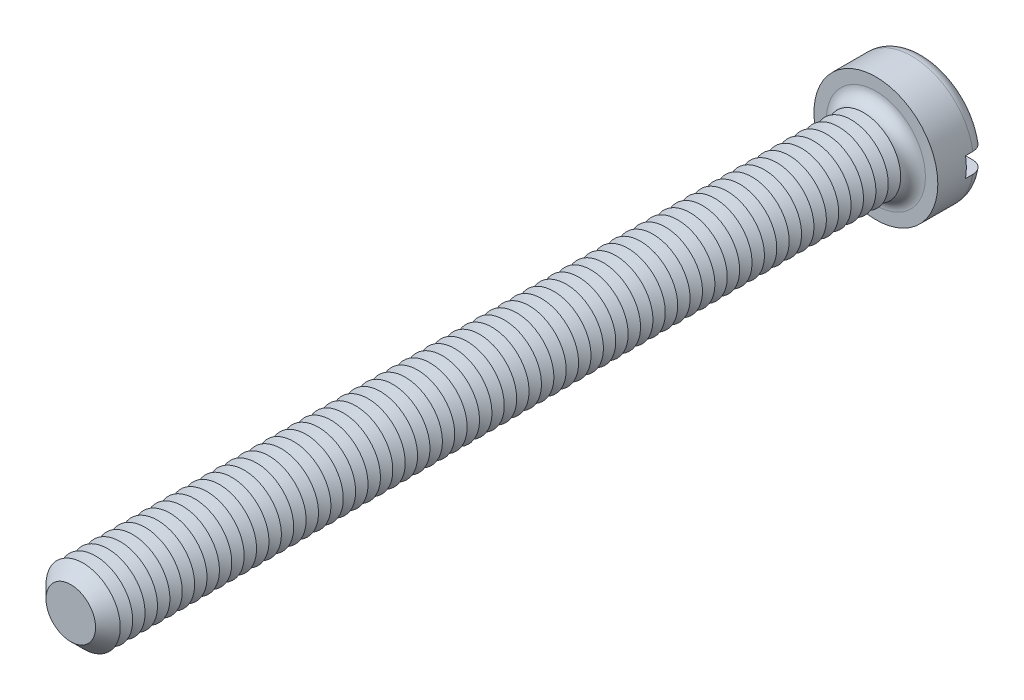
ISO-10303-21;
HEADER;
FILE_DESCRIPTION(('STEP AP214'),'2;1');
FILE_NAME('part.step','',(''),(''),'','','');
FILE_SCHEMA(('AUTOMOTIVE_DESIGN { 1 0 10303 214 1 1 1 1 }'));
ENDSEC;
DATA;
#1=APPLICATION_CONTEXT('core data for automotive mechanical design processes');
#2=APPLICATION_PROTOCOL_DEFINITION('international standard','automotive_design',2000,#1);
#3=PRODUCT_CONTEXT('',#1,'mechanical');
#4=PRODUCT('Part','Part','',(#3));
#5=PRODUCT_RELATED_PRODUCT_CATEGORY('part','',(#4));
#6=PRODUCT_DEFINITION_FORMATION('','',#4);
#7=PRODUCT_DEFINITION_CONTEXT('part definition',#1,'design');
#8=PRODUCT_DEFINITION('design','',#6,#7);
#9=PRODUCT_DEFINITION_SHAPE('','',#8);
#10=(LENGTH_UNIT() NAMED_UNIT(*) SI_UNIT(.MILLI.,.METRE.));
#11=(NAMED_UNIT(*) PLANE_ANGLE_UNIT() SI_UNIT($,.RADIAN.));
#12=(NAMED_UNIT(*) SI_UNIT($,.STERADIAN.) SOLID_ANGLE_UNIT());
#13=UNCERTAINTY_MEASURE_WITH_UNIT(LENGTH_MEASURE(1.E-05),#10,'distance_accuracy_value','');
#14=(GEOMETRIC_REPRESENTATION_CONTEXT(3) GLOBAL_UNCERTAINTY_ASSIGNED_CONTEXT((#13)) GLOBAL_UNIT_ASSIGNED_CONTEXT((#10,
#11,#12)) REPRESENTATION_CONTEXT('',''));
#15=CARTESIAN_POINT('',(0.,0.,0.));
#16=DIRECTION('',(0.,0.,1.));
#17=DIRECTION('',(1.,0.,0.));
#18=AXIS2_PLACEMENT_3D('',#15,#16,#17);
#19=CARTESIAN_POINT('',(0.,0.,-3.9));
#20=DIRECTION('',(0.,0.,1.));
#21=DIRECTION('',(1.,0.,0.));
#22=AXIS2_PLACEMENT_3D('',#19,#20,#21);
#23=PLANE('',#22);
#24=CARTESIAN_POINT('',(0.,0.,-3.9));
#25=DIRECTION('',(0.,0.,1.));
#26=DIRECTION('',(1.,0.,0.));
#27=AXIS2_PLACEMENT_3D('',#24,#25,#26);
#28=CIRCLE('',#27,4.);
#29=CARTESIAN_POINT('',(-3.91918358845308,0.800000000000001,-3.9));
#30=VERTEX_POINT('',#29);
#31=CARTESIAN_POINT('',(3.91918358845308,0.8,-3.9));
#32=VERTEX_POINT('',#31);
#33=EDGE_CURVE('E116',#30,#32,#28,.F.);
#34=ORIENTED_EDGE('',*,*,#33,.T.);
#35=DIRECTION('',(1.,0.,0.));
#36=VECTOR('',#35,1.);
#37=CARTESIAN_POINT('',(-5.,0.800000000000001,-3.9));
#38=LINE('',#37,#36);
#39=EDGE_CURVE('E111',#30,#32,#38,.T.);
#40=ORIENTED_EDGE('',*,*,#39,.F.);
#41=EDGE_LOOP('',(#34,#40));
#42=FACE_BOUND('',#41,.T.);
#43=ADVANCED_FACE('F39',(#42),#23,.F.);
#44=CARTESIAN_POINT('',(0.,0.,-2.9));
#45=DIRECTION('',(0.,0.,1.));
#46=DIRECTION('',(1.,0.,0.));
#47=AXIS2_PLACEMENT_3D('',#44,#45,#46);
#48=TOROIDAL_SURFACE('',#47,4.,1.);
#49=CARTESIAN_POINT('',(-4.76648512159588,0.800000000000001,-3.45304061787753));
#50=CARTESIAN_POINT('',(-4.73486405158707,0.800000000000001,-3.50001565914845));
#51=CARTESIAN_POINT('',(-4.69920787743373,0.800000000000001,-3.54432871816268));
#52=CARTESIAN_POINT('',(-4.62090302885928,0.800000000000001,-3.62634638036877));
#53=CARTESIAN_POINT('',(-4.57824494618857,0.800000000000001,-3.66404194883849));
#54=CARTESIAN_POINT('',(-4.48726975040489,0.800000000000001,-3.73172278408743));
#55=CARTESIAN_POINT('',(-4.43895902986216,0.800000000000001,-3.76171664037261));
#56=CARTESIAN_POINT('',(-4.33804923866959,0.800000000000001,-3.81326437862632));
#57=CARTESIAN_POINT('',(-4.2854512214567,0.800000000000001,-3.8348203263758));
#58=CARTESIAN_POINT('',(-4.17679895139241,0.800000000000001,-3.86918431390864));
#59=CARTESIAN_POINT('',(-4.12071163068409,0.800000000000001,-3.88188775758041));
#60=CARTESIAN_POINT('',(-4.00720729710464,0.800000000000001,-3.89785932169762));
#61=CARTESIAN_POINT('',(-3.94979011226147,0.800000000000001,-3.9011262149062));
#62=CARTESIAN_POINT('',(-3.83429042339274,0.800000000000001,-3.89816676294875));
#63=CARTESIAN_POINT('',(-3.77621176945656,0.800000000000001,-3.89178937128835));
#64=CARTESIAN_POINT('',(-3.66191938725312,0.800000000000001,-3.8694726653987));
#65=CARTESIAN_POINT('',(-3.60570580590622,0.800000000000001,-3.85353259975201));
#66=CARTESIAN_POINT('',(-3.49618749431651,0.800000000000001,-3.81233202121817));
#67=CARTESIAN_POINT('',(-3.44291561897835,0.800000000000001,-3.78698406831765));
#68=CARTESIAN_POINT('',(-3.34140774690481,0.800000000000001,-3.72766098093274));
#69=CARTESIAN_POINT('',(-3.29317182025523,0.800000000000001,-3.69368572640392));
#70=CARTESIAN_POINT('',(-3.20343355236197,0.800000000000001,-3.6182054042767));
#71=CARTESIAN_POINT('',(-3.16189680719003,0.800000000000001,-3.57674128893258));
#72=CARTESIAN_POINT('',(-3.08658236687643,0.800000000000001,-3.48727547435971));
#73=CARTESIAN_POINT('',(-3.05280364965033,0.800000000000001,-3.43927463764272));
#74=CARTESIAN_POINT('',(-2.99489532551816,0.800000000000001,-3.33932895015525));
#75=CARTESIAN_POINT('',(-2.97055012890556,0.800000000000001,-3.28750911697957));
#76=CARTESIAN_POINT('',(-2.93124252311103,0.800000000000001,-3.18042600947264));
#77=CARTESIAN_POINT('',(-2.91627793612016,0.800000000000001,-3.12516353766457));
#78=CARTESIAN_POINT('',(-2.89663075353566,0.800000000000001,-3.01470560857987));
#79=CARTESIAN_POINT('',(-2.89162828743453,0.800000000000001,-2.95956691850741));
#80=CARTESIAN_POINT('',(-2.89112479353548,0.800000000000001,-2.84924961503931));
#81=CARTESIAN_POINT('',(-2.89562264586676,0.800000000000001,-2.79407100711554));
#82=CARTESIAN_POINT('',(-2.91379565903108,0.800000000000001,-2.6861912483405));
#83=CARTESIAN_POINT('',(-2.92731815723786,0.800000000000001,-2.63346424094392));
#84=CARTESIAN_POINT('',(-2.96290888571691,0.800000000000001,-2.53098203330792));
#85=CARTESIAN_POINT('',(-2.98497757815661,0.800000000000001,-2.48122699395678));
#86=CARTESIAN_POINT('',(-3.03728055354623,0.800000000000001,-2.38535286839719));
#87=CARTESIAN_POINT('',(-3.06761989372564,0.800000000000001,-2.33929117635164));
#88=CARTESIAN_POINT('',(-3.13537950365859,0.800000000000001,-2.2527125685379));
#89=CARTESIAN_POINT('',(-3.17280082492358,0.800000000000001,-2.21219647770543));
#90=CARTESIAN_POINT('',(-3.2549164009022,0.800000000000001,-2.13651195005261));
#91=CARTESIAN_POINT('',(-3.29980186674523,0.800000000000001,-2.10155095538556));
#92=CARTESIAN_POINT('',(-3.39467666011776,0.800000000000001,-2.03942270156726));
#93=CARTESIAN_POINT('',(-3.44466673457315,0.800000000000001,-2.01225658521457));
#94=CARTESIAN_POINT('',(-3.5497933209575,0.800000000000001,-1.96576935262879));
#95=CARTESIAN_POINT('',(-3.60503228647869,0.800000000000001,-1.94667963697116));
#96=CARTESIAN_POINT('',(-3.71791613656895,0.800000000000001,-1.91794308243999));
#97=CARTESIAN_POINT('',(-3.77556119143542,0.800000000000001,-1.90829691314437));
#98=CARTESIAN_POINT('',(-3.89221522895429,0.800000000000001,-1.89869331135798));
#99=CARTESIAN_POINT('',(-3.9512319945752,0.800000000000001,-1.89882985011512));
#100=CARTESIAN_POINT('',(-4.06839541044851,0.800000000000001,-1.90907818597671));
#101=CARTESIAN_POINT('',(-4.12654207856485,0.800000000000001,-1.91918977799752));
#102=CARTESIAN_POINT('',(-4.23988103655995,0.800000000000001,-1.9490667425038));
#103=CARTESIAN_POINT('',(-4.29509069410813,0.800000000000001,-1.96876615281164));
#104=CARTESIAN_POINT('',(-4.40134194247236,0.800000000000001,-2.01729572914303));
#105=CARTESIAN_POINT('',(-4.45238383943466,0.800000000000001,-2.04612522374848));
#106=CARTESIAN_POINT('',(-4.54801343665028,0.800000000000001,-2.1116316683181));
#107=CARTESIAN_POINT('',(-4.59268768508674,0.800000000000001,-2.14818225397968));
#108=CARTESIAN_POINT('',(-4.67513924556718,0.800000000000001,-2.22837632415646));
#109=CARTESIAN_POINT('',(-4.71291715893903,0.800000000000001,-2.27201918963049));
#110=CARTESIAN_POINT('',(-4.77986554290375,0.800000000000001,-2.36439990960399));
#111=CARTESIAN_POINT('',(-4.80916462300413,0.800000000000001,-2.41304457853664));
#112=CARTESIAN_POINT('',(-4.85906149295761,0.800000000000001,-2.51460659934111));
#113=CARTESIAN_POINT('',(-4.8796602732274,0.800000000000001,-2.56752346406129));
#114=CARTESIAN_POINT('',(-4.9113264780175,0.800000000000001,-2.67542592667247));
#115=CARTESIAN_POINT('',(-4.92250819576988,0.800000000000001,-2.73037800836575));
#116=CARTESIAN_POINT('',(-4.93542682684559,0.800000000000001,-2.84139649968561));
#117=CARTESIAN_POINT('',(-4.93716171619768,0.800000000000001,-2.89746314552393));
#118=CARTESIAN_POINT('',(-4.93114851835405,0.800000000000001,-3.00876455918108));
#119=CARTESIAN_POINT('',(-4.92345325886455,0.800000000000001,-3.0640022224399));
#120=CARTESIAN_POINT('',(-4.8989032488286,0.800000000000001,-3.17235240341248));
#121=CARTESIAN_POINT('',(-4.88205998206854,0.800000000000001,-3.22546749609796));
#122=CARTESIAN_POINT('',(-4.84819200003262,0.800000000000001,-3.30764066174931));
#123=CARTESIAN_POINT('',(-4.83390853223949,0.800000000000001,-3.33785845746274));
#124=CARTESIAN_POINT('',(-4.80237957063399,0.800000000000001,-3.39670633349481));
#125=CARTESIAN_POINT('',(-4.78513409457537,0.800000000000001,-3.42533642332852));
#126=CARTESIAN_POINT('',(-4.76648512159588,0.800000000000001,-3.45304061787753));
#127=B_SPLINE_CURVE_WITH_KNOTS('',3,(#49,#50,#51,#52,#53,#54,#55,#56,#57,#58,#59,#60,#61,#62,
#63,#64,#65,#66,#67,#68,#69,#70,#71,#72,#73,#74,#75,#76,#77,#78,#79,#80,#81,#82,#83,#84,#85,#86,
#87,#88,#89,#90,#91,#92,#93,#94,#95,#96,#97,#98,#99,#100,#101,#102,#103,#104,#105,#106,#107,
#108,#109,#110,#111,#112,#113,#114,#115,#116,#117,#118,#119,#120,#121,#122,#123,#124,#125,#126),
.UNSPECIFIED.,.T.,.F.,(4,2,2,2,2,2,2,2,2,2,2,2,2,2,2,2,2,2,2,2,2,2,2,2,2,2,2,2,2,2,2,2,2,2,2,2,
2,2,4),(0.,0.169755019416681,0.339740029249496,0.509534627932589,0.67928763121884,
0.851013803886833,1.02276230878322,1.19722869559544,1.37170879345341,1.54785292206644,
1.72399950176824,1.89921049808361,2.07439839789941,2.24530597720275,2.41617386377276,
2.58146078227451,2.74672821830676,2.90926852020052,3.0718176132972,3.2365363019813,
3.40127946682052,3.57118676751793,3.74111896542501,3.91563534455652,4.09016409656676,
4.26636956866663,4.4425714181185,4.61757781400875,4.79257134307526,4.96489650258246,
5.13720662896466,5.30674670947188,5.47626748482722,5.64369988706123,5.81116816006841,
5.97770254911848,6.14402836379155,6.24414438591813,6.34425980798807),.UNSPECIFIED.);
#128=CARTESIAN_POINT('',(-4.93558507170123,0.800000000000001,-2.9));
#129=VERTEX_POINT('',#128);
#130=EDGE_CURVE('E683',#129,#30,#127,.T.);
#131=ORIENTED_EDGE('',*,*,#130,.F.);
#132=CARTESIAN_POINT('',(0.,0.,-2.9));
#133=DIRECTION('',(0.,0.,1.));
#134=DIRECTION('',(1.,0.,0.));
#135=AXIS2_PLACEMENT_3D('',#132,#133,#134);
#136=CIRCLE('',#135,5.);
#137=CARTESIAN_POINT('',(4.93558507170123,0.8,-2.9));
#138=VERTEX_POINT('',#137);
#139=EDGE_CURVE('E125',#138,#129,#136,.T.);
#140=ORIENTED_EDGE('',*,*,#139,.F.);
#141=CARTESIAN_POINT('',(2.98553785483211,0.8,-3.31649797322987));
#142=CARTESIAN_POINT('',(3.00991125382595,0.8,-3.36788093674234));
#143=CARTESIAN_POINT('',(3.03875556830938,0.8,-3.41719756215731));
#144=CARTESIAN_POINT('',(3.1043993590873,0.8,-3.51028676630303));
#145=CARTESIAN_POINT('',(3.1412115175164,0.8,-3.55405032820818));
#146=CARTESIAN_POINT('',(3.22153641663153,0.8,-3.63476402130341));
#147=CARTESIAN_POINT('',(3.26503706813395,0.8,-3.67172618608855));
#148=CARTESIAN_POINT('',(3.35749627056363,0.8,-3.73799476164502));
#149=CARTESIAN_POINT('',(3.4064533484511,0.8,-3.76730323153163));
#150=CARTESIAN_POINT('',(3.5095773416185,0.8,-3.81809642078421));
#151=CARTESIAN_POINT('',(3.56383317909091,0.8,-3.83940072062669));
#152=CARTESIAN_POINT('',(3.67513017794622,0.8,-3.87272481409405));
#153=CARTESIAN_POINT('',(3.7321717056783,0.8,-3.88474338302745));
#154=CARTESIAN_POINT('',(3.84815688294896,0.8,-3.89923413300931));
#155=CARTESIAN_POINT('',(3.90711516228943,0.8,-3.9015896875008));
#156=CARTESIAN_POINT('',(4.02458610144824,0.8,-3.89631753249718));
#157=CARTESIAN_POINT('',(4.08309876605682,0.8,-3.8886899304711));
#158=CARTESIAN_POINT('',(4.19768646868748,0.8,-3.86366584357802));
#159=CARTESIAN_POINT('',(4.25377243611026,0.8,-3.84631948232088));
#160=CARTESIAN_POINT('',(4.3621676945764,0.8,-3.80231797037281));
#161=CARTESIAN_POINT('',(4.41447726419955,0.8,-3.77566350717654));
#162=CARTESIAN_POINT('',(4.51300872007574,0.8,-3.71421163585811));
#163=CARTESIAN_POINT('',(4.5593085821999,0.8,-3.67953927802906));
#164=CARTESIAN_POINT('',(4.64530675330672,0.8,-3.60279495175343));
#165=CARTESIAN_POINT('',(4.68500564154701,0.8,-3.56072363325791));
#166=CARTESIAN_POINT('',(4.75599202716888,0.8,-3.47111750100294));
#167=CARTESIAN_POINT('',(4.7874061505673,0.8,-3.42368298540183));
#168=CARTESIAN_POINT('',(4.84170328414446,0.8,-3.32415927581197));
#169=CARTESIAN_POINT('',(4.86458695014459,0.8,-3.2720704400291));
#170=CARTESIAN_POINT('',(4.90088120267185,0.8,-3.16544016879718));
#171=CARTESIAN_POINT('',(4.91440984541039,0.8,-3.11093889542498));
#172=CARTESIAN_POINT('',(4.93205429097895,0.8,-3.00043391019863));
#173=CARTESIAN_POINT('',(4.93617053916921,0.8,-2.9444302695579));
#174=CARTESIAN_POINT('',(4.93486973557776,0.8,-2.83292218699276));
#175=CARTESIAN_POINT('',(4.92951827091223,0.8,-2.77741696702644));
#176=CARTESIAN_POINT('',(4.90957104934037,0.8,-2.66809456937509));
#177=CARTESIAN_POINT('',(4.89497541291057,0.8,-2.61427736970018));
#178=CARTESIAN_POINT('',(4.85697876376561,0.8,-2.50985095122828));
#179=CARTESIAN_POINT('',(4.83357805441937,0.8,-2.45924162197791));
#180=CARTESIAN_POINT('',(4.77866660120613,0.8,-2.36263484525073));
#181=CARTESIAN_POINT('',(4.74715567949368,0.8,-2.31663749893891));
#182=CARTESIAN_POINT('',(4.67670791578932,0.8,-2.23021464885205));
#183=CARTESIAN_POINT('',(4.6377224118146,0.8,-2.1898288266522));
#184=CARTESIAN_POINT('',(4.55359880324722,0.8,-2.11607828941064));
#185=CARTESIAN_POINT('',(4.50846036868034,0.8,-2.08271395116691));
#186=CARTESIAN_POINT('',(4.41271544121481,0.8,-2.02349513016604));
#187=CARTESIAN_POINT('',(4.36204749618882,0.8,-1.99774003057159));
#188=CARTESIAN_POINT('',(4.257155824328,0.8,-1.95495040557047));
#189=CARTESIAN_POINT('',(4.20293181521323,0.8,-1.93791657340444));
#190=CARTESIAN_POINT('',(4.09154156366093,0.8,-1.91276335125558));
#191=CARTESIAN_POINT('',(4.03434212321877,0.8,-1.90479098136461));
#192=CARTESIAN_POINT('',(3.91941228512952,0.8,-1.89840884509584));
#193=CARTESIAN_POINT('',(3.8616818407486,0.8,-1.89999992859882));
#194=CARTESIAN_POINT('',(3.7464111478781,0.8,-1.91275144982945));
#195=CARTESIAN_POINT('',(3.6888866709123,0.8,-1.92405471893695));
#196=CARTESIAN_POINT('',(3.57652290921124,0.8,-1.95609086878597));
#197=CARTESIAN_POINT('',(3.52168382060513,0.8,-1.97682443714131));
#198=CARTESIAN_POINT('',(3.41589179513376,0.8,-2.02733294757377));
#199=CARTESIAN_POINT('',(3.36496676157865,0.8,-2.05716640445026));
#200=CARTESIAN_POINT('',(3.26890903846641,0.8,-2.12504079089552));
#201=CARTESIAN_POINT('',(3.22377627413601,0.8,-2.16308161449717));
#202=CARTESIAN_POINT('',(3.141135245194,0.8,-2.24593284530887));
#203=CARTESIAN_POINT('',(3.1035541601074,0.8,-2.29067053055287));
#204=CARTESIAN_POINT('',(3.03669700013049,0.8,-2.38597317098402));
#205=CARTESIAN_POINT('',(3.00741914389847,0.8,-2.43653687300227));
#206=CARTESIAN_POINT('',(2.95891799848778,0.8,-2.54052959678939));
#207=CARTESIAN_POINT('',(2.93943249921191,0.8,-2.59383627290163));
#208=CARTESIAN_POINT('',(2.9100081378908,0.8,-2.70303736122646));
#209=CARTESIAN_POINT('',(2.90006970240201,0.8,-2.75893188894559));
#210=CARTESIAN_POINT('',(2.89027863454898,0.8,-2.86986958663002));
#211=CARTESIAN_POINT('',(2.89012791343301,0.8,-2.92488680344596));
#212=CARTESIAN_POINT('',(2.89917145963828,0.8,-3.03409648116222));
#213=CARTESIAN_POINT('',(2.90835313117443,0.8,-3.08828995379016));
#214=CARTESIAN_POINT('',(2.92977618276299,0.8,-3.17141652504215));
#215=CARTESIAN_POINT('',(2.93899011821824,0.8,-3.20116372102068));
#216=CARTESIAN_POINT('',(2.96020249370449,0.8,-3.25964614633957));
#217=CARTESIAN_POINT('',(2.97220082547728,0.8,-3.28838141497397));
#218=CARTESIAN_POINT('',(2.98553785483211,0.8,-3.31649797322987));
#219=B_SPLINE_CURVE_WITH_KNOTS('',3,(#141,#142,#143,#144,#145,#146,#147,#148,#149,#150,#151,
#152,#153,#154,#155,#156,#157,#158,#159,#160,#161,#162,#163,#164,#165,#166,#167,#168,#169,#170,
#171,#172,#173,#174,#175,#176,#177,#178,#179,#180,#181,#182,#183,#184,#185,#186,#187,#188,#189,
#190,#191,#192,#193,#194,#195,#196,#197,#198,#199,#200,#201,#202,#203,#204,#205,#206,#207,#208,
#209,#210,#211,#212,#213,#214,#215,#216,#217,#218),.UNSPECIFIED.,.T.,.F.,(4,2,2,2,2,2,2,2,2,2,2,
2,2,2,2,2,2,2,2,2,2,2,2,2,2,2,2,2,2,2,2,2,2,2,2,2,2,2,4),(0.,0.170493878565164,
0.341261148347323,0.511723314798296,0.682139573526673,0.856194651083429,1.03027268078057,
1.20644565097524,1.38261672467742,1.55788746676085,1.73314526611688,1.90583484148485,
2.07850925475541,2.24836742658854,2.41821253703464,2.58587311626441,2.75352576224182,
2.92002154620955,3.08651516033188,3.25300303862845,3.41949456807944,3.58710926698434,
3.75473295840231,3.92445790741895,4.09419634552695,4.26665110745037,4.43912119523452,
4.61417197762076,4.78923552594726,4.96544940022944,5.1416609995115,5.31608191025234,
5.49046537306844,5.65989063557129,5.82932346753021,5.99359365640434,6.157642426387,
6.250939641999,6.34423323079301),.UNSPECIFIED.);
#220=EDGE_CURVE('E685',#32,#138,#219,.T.);
#221=ORIENTED_EDGE('',*,*,#220,.F.);
#222=ORIENTED_EDGE('',*,*,#33,.F.);
#223=EDGE_LOOP('',(#131,#140,#221,#222));
#224=FACE_BOUND('',#223,.T.);
#225=ADVANCED_FACE('F667',(#224),#48,.T.);
#226=CARTESIAN_POINT('',(0.,0.,-3.9));
#227=DIRECTION('',(0.,0.,1.));
#228=DIRECTION('',(1.,0.,0.));
#229=AXIS2_PLACEMENT_3D('',#226,#227,#228);
#230=CYLINDRICAL_SURFACE('',#229,5.);
#231=DIRECTION('',(0.,0.,1.));
#232=VECTOR('',#231,1.);
#233=CARTESIAN_POINT('',(4.93558507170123,0.8,-3.9));
#234=LINE('',#233,#232);
#235=CARTESIAN_POINT('',(4.93558507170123,0.8,-2.3));
#236=VERTEX_POINT('',#235);
#237=EDGE_CURVE('E700',#138,#236,#234,.T.);
#238=ORIENTED_EDGE('',*,*,#237,.F.);
#239=ORIENTED_EDGE('',*,*,#139,.T.);
#240=DIRECTION('',(0.,0.,1.));
#241=VECTOR('',#240,1.);
#242=CARTESIAN_POINT('',(-4.93558507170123,0.800000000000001,-3.9));
#243=LINE('',#242,#241);
#244=CARTESIAN_POINT('',(-4.93558507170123,0.800000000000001,-2.3));
#245=VERTEX_POINT('',#244);
#246=EDGE_CURVE('E63',#245,#129,#243,.F.);
#247=ORIENTED_EDGE('',*,*,#246,.F.);
#248=CARTESIAN_POINT('',(0.,0.,-2.3));
#249=DIRECTION('',(0.,0.,-1.));
#250=DIRECTION('',(-1.,0.,0.));
#251=AXIS2_PLACEMENT_3D('',#248,#249,#250);
#252=CIRCLE('',#251,5.);
#253=CARTESIAN_POINT('',(-4.93558507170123,-0.799999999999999,-2.3));
#254=VERTEX_POINT('',#253);
#255=EDGE_CURVE('E43',#245,#254,#252,.F.);
#256=ORIENTED_EDGE('',*,*,#255,.T.);
#257=DIRECTION('',(0.,0.,1.));
#258=VECTOR('',#257,1.);
#259=CARTESIAN_POINT('',(-4.93558507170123,-0.799999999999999,-3.9));
#260=LINE('',#259,#258);
#261=CARTESIAN_POINT('',(-4.93558507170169,-0.799999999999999,-2.89999999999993));
#262=VERTEX_POINT('',#261);
#263=EDGE_CURVE('E697',#262,#254,#260,.T.);
#264=ORIENTED_EDGE('',*,*,#263,.F.);
#265=CARTESIAN_POINT('',(4.93558507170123,-0.8,-2.9));
#266=VERTEX_POINT('',#265);
#267=EDGE_CURVE('E127',#262,#266,#136,.T.);
#268=ORIENTED_EDGE('',*,*,#267,.T.);
#269=DIRECTION('',(0.,0.,1.));
#270=VECTOR('',#269,1.);
#271=CARTESIAN_POINT('',(4.93558507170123,-0.8,-3.9));
#272=LINE('',#271,#270);
#273=CARTESIAN_POINT('',(4.93558507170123,-0.8,-2.3));
#274=VERTEX_POINT('',#273);
#275=EDGE_CURVE('E55',#274,#266,#272,.F.);
#276=ORIENTED_EDGE('',*,*,#275,.F.);
#277=EDGE_CURVE('E11',#274,#236,#252,.F.);
#278=ORIENTED_EDGE('',*,*,#277,.T.);
#279=EDGE_LOOP('',(#238,#239,#247,#256,#264,#268,#276,#278));
#280=FACE_BOUND('',#279,.T.);
#281=CARTESIAN_POINT('',(0.,0.,0.));
#282=DIRECTION('',(0.,0.,1.));
#283=DIRECTION('',(1.,0.,0.));
#284=AXIS2_PLACEMENT_3D('',#281,#282,#283);
#285=CIRCLE('',#284,5.);
#286=CARTESIAN_POINT('',(5.,0.,0.));
#287=VERTEX_POINT('',#286);
#288=EDGE_CURVE('E703',#287,#287,#285,.T.);
#289=ORIENTED_EDGE('',*,*,#288,.F.);
#290=EDGE_LOOP('',(#289));
#291=FACE_BOUND('',#290,.T.);
#292=ADVANCED_FACE('F663',(#280,#291),#230,.T.);
#293=CARTESIAN_POINT('',(3.91918358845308,-0.8,-3.9));
#294=VERTEX_POINT('',#293);
#295=CARTESIAN_POINT('',(-3.91918358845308,-0.799999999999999,-3.9));
#296=VERTEX_POINT('',#295);
#297=EDGE_CURVE('E109',#294,#296,#28,.F.);
#298=ORIENTED_EDGE('',*,*,#297,.T.);
#299=DIRECTION('',(-1.,0.,0.));
#300=VECTOR('',#299,1.);
#301=CARTESIAN_POINT('',(-5.,-0.799999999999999,-3.9));
#302=LINE('',#301,#300);
#303=EDGE_CURVE('E96',#294,#296,#302,.T.);
#304=ORIENTED_EDGE('',*,*,#303,.F.);
#305=EDGE_LOOP('',(#298,#304));
#306=FACE_BOUND('',#305,.T.);
#307=ADVANCED_FACE('F108',(#306),#23,.F.);
#308=CARTESIAN_POINT('',(0.,0.,0.));
#309=DIRECTION('',(0.,0.,1.));
#310=DIRECTION('',(1.,0.,0.));
#311=AXIS2_PLACEMENT_3D('',#308,#309,#310);
#312=PLANE('',#311);
#313=CARTESIAN_POINT('',(0.,0.,0.));
#314=DIRECTION('',(0.,0.,1.));
#315=DIRECTION('',(1.,0.,0.));
#316=AXIS2_PLACEMENT_3D('',#313,#314,#315);
#317=CIRCLE('',#316,4.);
#318=CARTESIAN_POINT('',(4.,0.,0.));
#319=VERTEX_POINT('',#318);
#320=EDGE_CURVE('E115',#319,#319,#317,.F.);
#321=ORIENTED_EDGE('',*,*,#320,.T.);
#322=EDGE_LOOP('',(#321));
#323=FACE_BOUND('',#322,.T.);
#324=ORIENTED_EDGE('',*,*,#288,.T.);
#325=EDGE_LOOP('',(#324));
#326=FACE_BOUND('',#325,.T.);
#327=ADVANCED_FACE('F662',(#323,#326),#312,.T.);
#328=CARTESIAN_POINT('',(-4.76648512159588,-0.799999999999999,-3.45304061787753));
#329=CARTESIAN_POINT('',(-4.7975694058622,-0.799999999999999,-3.40685392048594));
#330=CARTESIAN_POINT('',(-4.82479903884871,-0.799999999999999,-3.35802740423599));
#331=CARTESIAN_POINT('',(-4.87070632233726,-0.799999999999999,-3.25646127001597));
#332=CARTESIAN_POINT('',(-4.8893747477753,-0.799999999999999,-3.20371750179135));
#333=CARTESIAN_POINT('',(-4.91756720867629,-0.799999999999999,-3.09584501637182));
#334=CARTESIAN_POINT('',(-4.92709302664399,-0.799999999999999,-3.04071676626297));
#335=CARTESIAN_POINT('',(-4.93671217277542,-0.799999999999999,-2.92965669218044));
#336=CARTESIAN_POINT('',(-4.93680767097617,-0.799999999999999,-2.87372505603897));
#337=CARTESIAN_POINT('',(-4.92758675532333,-0.799999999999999,-2.76284675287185));
#338=CARTESIAN_POINT('',(-4.91830421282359,-0.799999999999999,-2.70789726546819));
#339=CARTESIAN_POINT('',(-4.89065741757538,-0.799999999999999,-2.60033228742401));
#340=CARTESIAN_POINT('',(-4.87229291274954,-0.799999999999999,-2.54771686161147));
#341=CARTESIAN_POINT('',(-4.82699855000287,-0.799999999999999,-2.44622441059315));
#342=CARTESIAN_POINT('',(-4.80005659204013,-0.799999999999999,-2.39735278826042));
#343=CARTESIAN_POINT('',(-4.73841244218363,-0.799999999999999,-2.30477947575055));
#344=CARTESIAN_POINT('',(-4.70371003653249,-0.799999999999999,-2.26107792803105));
#345=CARTESIAN_POINT('',(-4.62724516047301,-0.799999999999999,-2.17969334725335));
#346=CARTESIAN_POINT('',(-4.58542787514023,-0.799999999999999,-2.14206183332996));
#347=CARTESIAN_POINT('',(-4.49614171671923,-0.799999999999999,-2.07424284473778));
#348=CARTESIAN_POINT('',(-4.44867251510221,-0.799999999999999,-2.04405580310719));
#349=CARTESIAN_POINT('',(-4.34875035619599,-0.799999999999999,-1.99153688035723));
#350=CARTESIAN_POINT('',(-4.29623870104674,-0.799999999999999,-1.96931670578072));
#351=CARTESIAN_POINT('',(-4.18826905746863,-0.799999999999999,-1.93384994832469));
#352=CARTESIAN_POINT('',(-4.1328108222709,-0.799999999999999,-1.92060411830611));
#353=CARTESIAN_POINT('',(-4.01956054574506,-0.799999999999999,-1.90323798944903));
#354=CARTESIAN_POINT('',(-3.96174522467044,-0.799999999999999,-1.89926947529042));
#355=CARTESIAN_POINT('',(-3.84625419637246,-0.799999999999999,-1.90095183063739));
#356=CARTESIAN_POINT('',(-3.78857850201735,-0.799999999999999,-1.90660355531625));
#357=CARTESIAN_POINT('',(-3.67415602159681,-0.799999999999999,-1.92748272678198));
#358=CARTESIAN_POINT('',(-3.61743328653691,-0.799999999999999,-1.94284216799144));
#359=CARTESIAN_POINT('',(-3.50734962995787,-0.799999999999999,-1.9828275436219));
#360=CARTESIAN_POINT('',(-3.4539889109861,-0.799999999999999,-2.00745403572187));
#361=CARTESIAN_POINT('',(-3.35197118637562,-0.799999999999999,-2.06542964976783));
#362=CARTESIAN_POINT('',(-3.30333217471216,-0.799999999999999,-2.0988104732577));
#363=CARTESIAN_POINT('',(-3.21244692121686,-0.799999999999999,-2.17337326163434));
#364=CARTESIAN_POINT('',(-3.17020039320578,-0.799999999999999,-2.21455487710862));
#365=CARTESIAN_POINT('',(-3.0940098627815,-0.799999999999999,-2.30296695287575));
#366=CARTESIAN_POINT('',(-3.05995540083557,-0.799999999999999,-2.35010211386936));
#367=CARTESIAN_POINT('',(-3.00053815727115,-0.799999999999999,-2.4495670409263));
#368=CARTESIAN_POINT('',(-2.97517362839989,-0.799999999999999,-2.50189576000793));
#369=CARTESIAN_POINT('',(-2.93470320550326,-0.799999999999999,-2.60853979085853));
#370=CARTESIAN_POINT('',(-2.91930557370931,-0.799999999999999,-2.66274437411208));
#371=CARTESIAN_POINT('',(-2.89812734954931,-0.799999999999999,-2.77299836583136));
#372=CARTESIAN_POINT('',(-2.89234481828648,-0.799999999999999,-2.82904740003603));
#373=CARTESIAN_POINT('',(-2.89064073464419,-0.799999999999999,-2.93970612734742));
#374=CARTESIAN_POINT('',(-2.89444549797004,-0.799999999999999,-2.99431180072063));
#375=CARTESIAN_POINT('',(-2.9112006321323,-0.799999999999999,-3.10209766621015));
#376=CARTESIAN_POINT('',(-2.9241507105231,-0.799999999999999,-3.1552779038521));
#377=CARTESIAN_POINT('',(-2.95868580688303,-0.799999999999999,-3.25858631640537));
#378=CARTESIAN_POINT('',(-2.98024709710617,-0.799999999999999,-3.30872244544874));
#379=CARTESIAN_POINT('',(-3.03128544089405,-0.799999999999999,-3.40478519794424));
#380=CARTESIAN_POINT('',(-3.06076335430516,-0.799999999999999,-3.45071136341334));
#381=CARTESIAN_POINT('',(-3.12753448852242,-0.799999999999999,-3.53826932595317));
#382=CARTESIAN_POINT('',(-3.16500083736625,-0.799999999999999,-3.57976901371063));
#383=CARTESIAN_POINT('',(-3.24617503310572,-0.799999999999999,-3.65613204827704));
#384=CARTESIAN_POINT('',(-3.28988388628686,-0.799999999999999,-3.69099432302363));
#385=CARTESIAN_POINT('',(-3.38380639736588,-0.799999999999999,-3.75424083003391));
#386=CARTESIAN_POINT('',(-3.43418287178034,-0.799999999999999,-3.78238342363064));
#387=CARTESIAN_POINT('',(-3.53887888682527,-0.799999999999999,-3.83000231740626));
#388=CARTESIAN_POINT('',(-3.59319889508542,-0.799999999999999,-3.84947758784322));
#389=CARTESIAN_POINT('',(-3.70539237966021,-0.799999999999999,-3.87954336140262));
#390=CARTESIAN_POINT('',(-3.76331464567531,-0.799999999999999,-3.88995217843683));
#391=CARTESIAN_POINT('',(-3.88008461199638,-0.799999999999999,-3.9009132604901));
#392=CARTESIAN_POINT('',(-3.93893230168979,-0.799999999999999,-3.9014656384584));
#393=CARTESIAN_POINT('',(-4.05594892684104,-0.799999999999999,-3.89264187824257));
#394=CARTESIAN_POINT('',(-4.11411702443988,-0.799999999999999,-3.88325457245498));
#395=CARTESIAN_POINT('',(-4.22802928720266,-0.799999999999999,-3.85472582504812));
#396=CARTESIAN_POINT('',(-4.28377297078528,-0.799999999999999,-3.83558245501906));
#397=CARTESIAN_POINT('',(-4.39054463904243,-0.799999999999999,-3.78829842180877));
#398=CARTESIAN_POINT('',(-4.44161887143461,-0.799999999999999,-3.76026208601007));
#399=CARTESIAN_POINT('',(-4.53818016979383,-0.799999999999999,-3.69589278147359));
#400=CARTESIAN_POINT('',(-4.58367442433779,-0.799999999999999,-3.65957066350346));
#401=CARTESIAN_POINT('',(-4.65208830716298,-0.799999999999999,-3.59453310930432));
#402=CARTESIAN_POINT('',(-4.67711825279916,-0.799999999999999,-3.56800018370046));
#403=CARTESIAN_POINT('',(-4.72414423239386,-0.799999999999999,-3.51236863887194));
#404=CARTESIAN_POINT('',(-4.74614029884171,-0.799999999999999,-3.48327004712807));
#405=CARTESIAN_POINT('',(-4.76648512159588,-0.799999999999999,-3.45304061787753));
#406=B_SPLINE_CURVE_WITH_KNOTS('',3,(#328,#329,#330,#331,#332,#333,#334,#335,#336,#337,#338,
#339,#340,#341,#342,#343,#344,#345,#346,#347,#348,#349,#350,#351,#352,#353,#354,#355,#356,#357,
#358,#359,#360,#361,#362,#363,#364,#365,#366,#367,#368,#369,#370,#371,#372,#373,#374,#375,#376,
#377,#378,#379,#380,#381,#382,#383,#384,#385,#386,#387,#388,#389,#390,#391,#392,#393,#394,#395,
#396,#397,#398,#399,#400,#401,#402,#403,#404,#405),.UNSPECIFIED.,.T.,.F.,(4,2,2,2,2,2,2,2,2,2,2,
2,2,2,2,2,2,2,2,2,2,2,2,2,2,2,2,2,2,2,2,2,2,2,2,2,2,2,4),(0.,0.166886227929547,
0.333951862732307,0.500984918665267,0.667979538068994,0.834373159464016,1.00077139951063,
1.16740542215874,1.33404403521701,1.50202999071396,1.67002571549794,1.84029248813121,
2.01057354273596,2.18362161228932,2.35668506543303,2.53215380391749,2.70763310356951,
2.88375684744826,3.05987270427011,3.23346085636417,3.40701408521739,3.57522519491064,
3.74340238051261,3.90683338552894,4.0702591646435,4.23323770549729,4.39623395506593,
4.56320691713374,4.7302068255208,4.90252468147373,5.07486300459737,5.25058028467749,
5.42629555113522,5.60220844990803,5.77815613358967,5.95211162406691,6.12584060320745,
6.23506966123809,6.34429754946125),.UNSPECIFIED.);
#407=EDGE_CURVE('E103',#296,#262,#406,.T.);
#408=ORIENTED_EDGE('',*,*,#407,.F.);
#409=ORIENTED_EDGE('',*,*,#297,.F.);
#410=CARTESIAN_POINT('',(2.98553785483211,-0.8,-3.31649797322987));
#411=CARTESIAN_POINT('',(2.96216773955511,-0.8,-3.26721849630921));
#412=CARTESIAN_POINT('',(2.94287503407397,-0.8,-3.21596872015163));
#413=CARTESIAN_POINT('',(2.91313258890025,-0.8,-3.11092723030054));
#414=CARTESIAN_POINT('',(2.9026902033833,-0.8,-3.0571334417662));
#415=CARTESIAN_POINT('',(2.89104377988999,-0.8,-2.94853922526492));
#416=CARTESIAN_POINT('',(2.88984130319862,-0.8,-2.89373862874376));
#417=CARTESIAN_POINT('',(2.89672585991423,-0.8,-2.78473646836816));
#418=CARTESIAN_POINT('',(2.90481120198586,-0.8,-2.73053479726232));
#419=CARTESIAN_POINT('',(2.92989134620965,-0.8,-2.62460092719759));
#420=CARTESIAN_POINT('',(2.94682969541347,-0.8,-2.57285532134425));
#421=CARTESIAN_POINT('',(2.9889990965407,-0.8,-2.47286425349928));
#422=CARTESIAN_POINT('',(3.01423103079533,-0.8,-2.42461916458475));
#423=CARTESIAN_POINT('',(3.07271536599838,-0.8,-2.33201565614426));
#424=CARTESIAN_POINT('',(3.10610710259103,-0.8,-2.28774532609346));
#425=CARTESIAN_POINT('',(3.17963417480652,-0.8,-2.205215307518));
#426=CARTESIAN_POINT('',(3.21977054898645,-0.8,-2.16695654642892));
#427=CARTESIAN_POINT('',(3.3070361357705,-0.8,-2.09624274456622));
#428=CARTESIAN_POINT('',(3.35434874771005,-0.8,-2.06401396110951));
#429=CARTESIAN_POINT('',(3.45361131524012,-0.8,-2.00773436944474));
#430=CARTESIAN_POINT('',(3.50556189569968,-0.8,-1.98368466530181));
#431=CARTESIAN_POINT('',(3.61398433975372,-0.8,-1.94389460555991));
#432=CARTESIAN_POINT('',(3.67053506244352,-0.8,-1.92836880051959));
#433=CARTESIAN_POINT('',(3.78543606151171,-0.8,-1.90696594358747));
#434=CARTESIAN_POINT('',(3.84378643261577,-0.8,-1.90108940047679));
#435=CARTESIAN_POINT('',(3.96100201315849,-0.8,-1.89918115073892));
#436=CARTESIAN_POINT('',(4.01986821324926,-0.8,-1.90320860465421));
#437=CARTESIAN_POINT('',(4.13606891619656,-0.8,-1.9211820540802));
#438=CARTESIAN_POINT('',(4.19340347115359,-0.8,-1.93512771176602));
#439=CARTESIAN_POINT('',(4.30434213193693,-0.8,-1.97243705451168));
#440=CARTESIAN_POINT('',(4.35797549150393,-0.8,-1.99571368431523));
#441=CARTESIAN_POINT('',(4.46048254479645,-0.8,-2.0510826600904));
#442=CARTESIAN_POINT('',(4.50935662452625,-0.8,-2.08317429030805));
#443=CARTESIAN_POINT('',(4.60012348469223,-0.8,-2.15471647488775));
#444=CARTESIAN_POINT('',(4.64211506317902,-0.8,-2.19404167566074));
#445=CARTESIAN_POINT('',(4.71877054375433,-0.8,-2.27928299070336));
#446=CARTESIAN_POINT('',(4.75343508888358,-0.8,-2.32519852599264));
#447=CARTESIAN_POINT('',(4.81388799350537,-0.8,-2.4215411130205));
#448=CARTESIAN_POINT('',(4.83980652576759,-0.8,-2.47188650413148));
#449=CARTESIAN_POINT('',(4.88271402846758,-0.8,-2.57624865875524));
#450=CARTESIAN_POINT('',(4.89970360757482,-0.8,-2.63026517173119));
#451=CARTESIAN_POINT('',(4.92409334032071,-0.8,-2.73978844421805));
#452=CARTESIAN_POINT('',(4.93159814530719,-0.8,-2.79527191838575));
#453=CARTESIAN_POINT('',(4.93713723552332,-0.8,-2.90670881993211));
#454=CARTESIAN_POINT('',(4.9351718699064,-0.8,-2.9626622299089));
#455=CARTESIAN_POINT('',(4.92186293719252,-0.8,-3.07317093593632));
#456=CARTESIAN_POINT('',(4.91056393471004,-0.8,-3.12773160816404));
#457=CARTESIAN_POINT('',(4.87898532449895,-0.8,-3.234187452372));
#458=CARTESIAN_POINT('',(4.85870572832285,-0.8,-3.28608262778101));
#459=CARTESIAN_POINT('',(4.80971634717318,-0.8,-3.38586723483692));
#460=CARTESIAN_POINT('',(4.78098824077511,-0.8,-3.43374766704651));
#461=CARTESIAN_POINT('',(4.71596686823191,-0.8,-3.52405937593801));
#462=CARTESIAN_POINT('',(4.67967336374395,-0.8,-3.56649048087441));
#463=CARTESIAN_POINT('',(4.60022577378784,-0.8,-3.64511036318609));
#464=CARTESIAN_POINT('',(4.5570143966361,-0.8,-3.6812412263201));
#465=CARTESIAN_POINT('',(4.4652099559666,-0.8,-3.7458530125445));
#466=CARTESIAN_POINT('',(4.41661654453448,-0.8,-3.77433344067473));
#467=CARTESIAN_POINT('',(4.31470683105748,-0.8,-3.82326981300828));
#468=CARTESIAN_POINT('',(4.26133399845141,-0.8,-3.84360800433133));
#469=CARTESIAN_POINT('',(4.15196444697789,-0.8,-3.87519515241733));
#470=CARTESIAN_POINT('',(4.09596750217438,-0.8,-3.88644332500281));
#471=CARTESIAN_POINT('',(3.98196469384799,-0.8,-3.89971870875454));
#472=CARTESIAN_POINT('',(3.92394096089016,-0.8,-3.901592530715));
#473=CARTESIAN_POINT('',(3.8083852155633,-0.8,-3.89570840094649));
#474=CARTESIAN_POINT('',(3.75085322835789,-0.8,-3.88794995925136));
#475=CARTESIAN_POINT('',(3.6371167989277,-0.8,-3.86287824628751));
#476=CARTESIAN_POINT('',(3.58093962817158,-0.8,-3.84544111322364));
#477=CARTESIAN_POINT('',(3.47227948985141,-0.8,-3.80139971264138));
#478=CARTESIAN_POINT('',(3.41979762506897,-0.8,-3.77479272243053));
#479=CARTESIAN_POINT('',(3.31994061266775,-0.8,-3.71304199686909));
#480=CARTESIAN_POINT('',(3.27257854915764,-0.8,-3.67787710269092));
#481=CARTESIAN_POINT('',(3.18459619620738,-0.8,-3.59999704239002));
#482=CARTESIAN_POINT('',(3.14396747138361,-0.8,-3.55729146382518));
#483=CARTESIAN_POINT('',(3.08341110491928,-0.8,-3.48140072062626));
#484=CARTESIAN_POINT('',(3.06118126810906,-0.8,-3.45002448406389));
#485=CARTESIAN_POINT('',(3.02047302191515,-0.8,-3.38492378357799));
#486=CARTESIAN_POINT('',(3.00199451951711,-0.8,-3.35119937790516));
#487=CARTESIAN_POINT('',(2.98553785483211,-0.8,-3.31649797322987));
#488=B_SPLINE_CURVE_WITH_KNOTS('',3,(#410,#411,#412,#413,#414,#415,#416,#417,#418,#419,#420,
#421,#422,#423,#424,#425,#426,#427,#428,#429,#430,#431,#432,#433,#434,#435,#436,#437,#438,#439,
#440,#441,#442,#443,#444,#445,#446,#447,#448,#449,#450,#451,#452,#453,#454,#455,#456,#457,#458,
#459,#460,#461,#462,#463,#464,#465,#466,#467,#468,#469,#470,#471,#472,#473,#474,#475,#476,#477,
#478,#479,#480,#481,#482,#483,#484,#485,#486,#487),.UNSPECIFIED.,.T.,.F.,(4,2,2,2,2,2,2,2,2,2,2,
2,2,2,2,2,2,2,2,2,2,2,2,2,2,2,2,2,2,2,2,2,2,2,2,2,2,2,4),(0.,0.163484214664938,
0.327104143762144,0.490751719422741,0.654369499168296,0.816956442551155,0.979560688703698,
1.14516376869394,1.31079237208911,1.48174839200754,1.6527274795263,1.82783306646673,
2.00294788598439,2.17911127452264,2.35526866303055,2.52981944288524,2.70435605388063,
2.87611266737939,3.04785420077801,3.21691347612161,3.38596122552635,3.55312700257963,
3.72028661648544,3.88665268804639,4.053018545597,4.2197478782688,4.38648246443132,
4.55467705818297,4.72288253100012,4.89343959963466,5.06401138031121,5.23736524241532,
5.41072792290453,5.58636211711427,5.76204850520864,5.93817375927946,6.11407667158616,
6.22920111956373,6.34432271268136),.UNSPECIFIED.);
#489=EDGE_CURVE('E92',#266,#294,#488,.T.);
#490=ORIENTED_EDGE('',*,*,#489,.F.);
#491=ORIENTED_EDGE('',*,*,#267,.F.);
#492=EDGE_LOOP('',(#408,#409,#490,#491));
#493=FACE_BOUND('',#492,.T.);
#494=ADVANCED_FACE('F113',(#493),#48,.T.);
#495=CARTESIAN_POINT('',(0.,0.,1.));
#496=DIRECTION('',(0.,0.,1.));
#497=DIRECTION('',(1.,0.,0.));
#498=AXIS2_PLACEMENT_3D('',#495,#496,#497);
#499=TOROIDAL_SURFACE('',#498,4.,1.);
#500=ORIENTED_EDGE('',*,*,#320,.F.);
#501=EDGE_LOOP('',(#500));
#502=FACE_BOUND('',#501,.T.);
#503=CARTESIAN_POINT('',(0.,0.,1.));
#504=DIRECTION('',(0.,0.,-1.));
#505=DIRECTION('',(-1.,0.,0.));
#506=AXIS2_PLACEMENT_3D('',#503,#504,#505);
#507=CIRCLE('',#506,3.);
#508=CARTESIAN_POINT('',(-3.,0.,1.));
#509=VERTEX_POINT('',#508);
#510=EDGE_CURVE('E708',#509,#509,#507,.T.);
#511=ORIENTED_EDGE('',*,*,#510,.T.);
#512=EDGE_LOOP('',(#511));
#513=FACE_BOUND('',#512,.T.);
#514=ADVANCED_FACE('F655',(#502,#513),#499,.F.);
#515=CARTESIAN_POINT('',(0.,0.,1.5));
#516=DIRECTION('',(0.,0.,-1.));
#517=DIRECTION('',(-1.,0.,0.));
#518=AXIS2_PLACEMENT_3D('',#515,#516,#517);
#519=CONICAL_SURFACE('',#518,2.13397459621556,1.0471975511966);
#520=ORIENTED_EDGE('',*,*,#510,.F.);
#521=EDGE_LOOP('',(#520));
#522=FACE_BOUND('',#521,.T.);
#523=CARTESIAN_POINT('',(0.,0.,1.5));
#524=DIRECTION('',(0.,0.,-1.));
#525=DIRECTION('',(-1.,0.,0.));
#526=AXIS2_PLACEMENT_3D('',#523,#524,#525);
#527=CIRCLE('',#526,2.13397459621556);
#528=CARTESIAN_POINT('',(-2.13397459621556,0.,1.5));
#529=VERTEX_POINT('',#528);
#530=EDGE_CURVE('E714',#529,#529,#527,.T.);
#531=ORIENTED_EDGE('',*,*,#530,.T.);
#532=EDGE_LOOP('',(#531));
#533=FACE_BOUND('',#532,.T.);
#534=ADVANCED_FACE('F651',(#522,#533),#519,.T.);
#535=CARTESIAN_POINT('',(0.,0.,2.));
#536=DIRECTION('',(0.,0.,1.));
#537=DIRECTION('',(1.,0.,0.));
#538=AXIS2_PLACEMENT_3D('',#535,#536,#537);
#539=CONICAL_SURFACE('',#538,3.,1.0471975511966);
#540=ORIENTED_EDGE('',*,*,#530,.F.);
#541=EDGE_LOOP('',(#540));
#542=FACE_BOUND('',#541,.T.);
#543=CARTESIAN_POINT('',(0.,0.,2.));
#544=DIRECTION('',(0.,0.,-1.));
#545=DIRECTION('',(-1.,0.,0.));
#546=AXIS2_PLACEMENT_3D('',#543,#544,#545);
#547=CIRCLE('',#546,3.);
#548=CARTESIAN_POINT('',(-3.,0.,2.));
#549=VERTEX_POINT('',#548);
#550=EDGE_CURVE('E720',#549,#549,#547,.T.);
#551=ORIENTED_EDGE('',*,*,#550,.T.);
#552=EDGE_LOOP('',(#551));
#553=FACE_BOUND('',#552,.T.);
#554=ADVANCED_FACE('F647',(#542,#553),#539,.T.);
#555=CARTESIAN_POINT('',(0.,0.,2.5));
#556=DIRECTION('',(0.,0.,-1.));
#557=DIRECTION('',(-1.,0.,0.));
#558=AXIS2_PLACEMENT_3D('',#555,#556,#557);
#559=CONICAL_SURFACE('',#558,2.13397459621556,1.0471975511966);
#560=ORIENTED_EDGE('',*,*,#550,.F.);
#561=EDGE_LOOP('',(#560));
#562=FACE_BOUND('',#561,.T.);
#563=CARTESIAN_POINT('',(0.,0.,2.5));
#564=DIRECTION('',(0.,0.,-1.));
#565=DIRECTION('',(-1.,0.,0.));
#566=AXIS2_PLACEMENT_3D('',#563,#564,#565);
#567=CIRCLE('',#566,2.13397459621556);
#568=CARTESIAN_POINT('',(-2.13397459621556,0.,2.5));
#569=VERTEX_POINT('',#568);
#570=EDGE_CURVE('E724',#569,#569,#567,.T.);
#571=ORIENTED_EDGE('',*,*,#570,.T.);
#572=EDGE_LOOP('',(#571));
#573=FACE_BOUND('',#572,.T.);
#574=ADVANCED_FACE('F643',(#562,#573),#559,.T.);
#575=CARTESIAN_POINT('',(0.,0.,3.));
#576=DIRECTION('',(0.,0.,1.));
#577=DIRECTION('',(1.,0.,0.));
#578=AXIS2_PLACEMENT_3D('',#575,#576,#577);
#579=CONICAL_SURFACE('',#578,3.,1.0471975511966);
#580=ORIENTED_EDGE('',*,*,#570,.F.);
#581=EDGE_LOOP('',(#580));
#582=FACE_BOUND('',#581,.T.);
#583=CARTESIAN_POINT('',(0.,0.,3.));
#584=DIRECTION('',(0.,0.,-1.));
#585=DIRECTION('',(-1.,0.,0.));
#586=AXIS2_PLACEMENT_3D('',#583,#584,#585);
#587=CIRCLE('',#586,3.);
#588=CARTESIAN_POINT('',(-3.,0.,3.));
#589=VERTEX_POINT('',#588);
#590=EDGE_CURVE('E727',#589,#589,#587,.T.);
#591=ORIENTED_EDGE('',*,*,#590,.T.);
#592=EDGE_LOOP('',(#591));
#593=FACE_BOUND('',#592,.T.);
#594=ADVANCED_FACE('F639',(#582,#593),#579,.T.);
#595=CARTESIAN_POINT('',(0.,0.,3.5));
#596=DIRECTION('',(0.,0.,-1.));
#597=DIRECTION('',(-1.,0.,0.));
#598=AXIS2_PLACEMENT_3D('',#595,#596,#597);
#599=CONICAL_SURFACE('',#598,2.13397459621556,1.0471975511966);
#600=ORIENTED_EDGE('',*,*,#590,.F.);
#601=EDGE_LOOP('',(#600));
#602=FACE_BOUND('',#601,.T.);
#603=CARTESIAN_POINT('',(0.,0.,3.5));
#604=DIRECTION('',(0.,0.,-1.));
#605=DIRECTION('',(-1.,0.,0.));
#606=AXIS2_PLACEMENT_3D('',#603,#604,#605);
#607=CIRCLE('',#606,2.13397459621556);
#608=CARTESIAN_POINT('',(-2.13397459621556,0.,3.5));
#609=VERTEX_POINT('',#608);
#610=EDGE_CURVE('E731',#609,#609,#607,.T.);
#611=ORIENTED_EDGE('',*,*,#610,.T.);
#612=EDGE_LOOP('',(#611));
#613=FACE_BOUND('',#612,.T.);
#614=ADVANCED_FACE('F635',(#602,#613),#599,.T.);
#615=CARTESIAN_POINT('',(0.,0.,4.));
#616=DIRECTION('',(0.,0.,1.));
#617=DIRECTION('',(1.,0.,0.));
#618=AXIS2_PLACEMENT_3D('',#615,#616,#617);
#619=CONICAL_SURFACE('',#618,3.,1.0471975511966);
#620=ORIENTED_EDGE('',*,*,#610,.F.);
#621=EDGE_LOOP('',(#620));
#622=FACE_BOUND('',#621,.T.);
#623=CARTESIAN_POINT('',(0.,0.,4.));
#624=DIRECTION('',(0.,0.,-1.));
#625=DIRECTION('',(-1.,0.,0.));
#626=AXIS2_PLACEMENT_3D('',#623,#624,#625);
#627=CIRCLE('',#626,3.);
#628=CARTESIAN_POINT('',(-3.,0.,4.));
#629=VERTEX_POINT('',#628);
#630=EDGE_CURVE('E735',#629,#629,#627,.T.);
#631=ORIENTED_EDGE('',*,*,#630,.T.);
#632=EDGE_LOOP('',(#631));
#633=FACE_BOUND('',#632,.T.);
#634=ADVANCED_FACE('F631',(#622,#633),#619,.T.);
#635=CARTESIAN_POINT('',(0.,0.,4.5));
#636=DIRECTION('',(0.,0.,-1.));
#637=DIRECTION('',(-1.,0.,0.));
#638=AXIS2_PLACEMENT_3D('',#635,#636,#637);
#639=CONICAL_SURFACE('',#638,2.13397459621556,1.0471975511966);
#640=ORIENTED_EDGE('',*,*,#630,.F.);
#641=EDGE_LOOP('',(#640));
#642=FACE_BOUND('',#641,.T.);
#643=CARTESIAN_POINT('',(0.,0.,4.5));
#644=DIRECTION('',(0.,0.,-1.));
#645=DIRECTION('',(-1.,0.,0.));
#646=AXIS2_PLACEMENT_3D('',#643,#644,#645);
#647=CIRCLE('',#646,2.13397459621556);
#648=CARTESIAN_POINT('',(-2.13397459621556,0.,4.5));
#649=VERTEX_POINT('',#648);
#650=EDGE_CURVE('E739',#649,#649,#647,.T.);
#651=ORIENTED_EDGE('',*,*,#650,.T.);
#652=EDGE_LOOP('',(#651));
#653=FACE_BOUND('',#652,.T.);
#654=ADVANCED_FACE('F627',(#642,#653),#639,.T.);
#655=CARTESIAN_POINT('',(0.,0.,5.));
#656=DIRECTION('',(0.,0.,1.));
#657=DIRECTION('',(1.,0.,0.));
#658=AXIS2_PLACEMENT_3D('',#655,#656,#657);
#659=CONICAL_SURFACE('',#658,3.,1.0471975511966);
#660=ORIENTED_EDGE('',*,*,#650,.F.);
#661=EDGE_LOOP('',(#660));
#662=FACE_BOUND('',#661,.T.);
#663=CARTESIAN_POINT('',(0.,0.,5.));
#664=DIRECTION('',(0.,0.,-1.));
#665=DIRECTION('',(-1.,0.,0.));
#666=AXIS2_PLACEMENT_3D('',#663,#664,#665);
#667=CIRCLE('',#666,3.);
#668=CARTESIAN_POINT('',(-3.,0.,5.));
#669=VERTEX_POINT('',#668);
#670=EDGE_CURVE('E743',#669,#669,#667,.T.);
#671=ORIENTED_EDGE('',*,*,#670,.T.);
#672=EDGE_LOOP('',(#671));
#673=FACE_BOUND('',#672,.T.);
#674=ADVANCED_FACE('F623',(#662,#673),#659,.T.);
#675=CARTESIAN_POINT('',(0.,0.,5.5));
#676=DIRECTION('',(0.,0.,-1.));
#677=DIRECTION('',(-1.,0.,0.));
#678=AXIS2_PLACEMENT_3D('',#675,#676,#677);
#679=CONICAL_SURFACE('',#678,2.13397459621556,1.0471975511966);
#680=ORIENTED_EDGE('',*,*,#670,.F.);
#681=EDGE_LOOP('',(#680));
#682=FACE_BOUND('',#681,.T.);
#683=CARTESIAN_POINT('',(0.,0.,5.5));
#684=DIRECTION('',(0.,0.,-1.));
#685=DIRECTION('',(-1.,0.,0.));
#686=AXIS2_PLACEMENT_3D('',#683,#684,#685);
#687=CIRCLE('',#686,2.13397459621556);
#688=CARTESIAN_POINT('',(-2.13397459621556,0.,5.5));
#689=VERTEX_POINT('',#688);
#690=EDGE_CURVE('E747',#689,#689,#687,.T.);
#691=ORIENTED_EDGE('',*,*,#690,.T.);
#692=EDGE_LOOP('',(#691));
#693=FACE_BOUND('',#692,.T.);
#694=ADVANCED_FACE('F619',(#682,#693),#679,.T.);
#695=CARTESIAN_POINT('',(0.,0.,6.));
#696=DIRECTION('',(0.,0.,1.));
#697=DIRECTION('',(1.,0.,0.));
#698=AXIS2_PLACEMENT_3D('',#695,#696,#697);
#699=CONICAL_SURFACE('',#698,3.,1.0471975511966);
#700=ORIENTED_EDGE('',*,*,#690,.F.);
#701=EDGE_LOOP('',(#700));
#702=FACE_BOUND('',#701,.T.);
#703=CARTESIAN_POINT('',(0.,0.,6.));
#704=DIRECTION('',(0.,0.,-1.));
#705=DIRECTION('',(-1.,0.,0.));
#706=AXIS2_PLACEMENT_3D('',#703,#704,#705);
#707=CIRCLE('',#706,3.);
#708=CARTESIAN_POINT('',(-3.,0.,6.));
#709=VERTEX_POINT('',#708);
#710=EDGE_CURVE('E751',#709,#709,#707,.T.);
#711=ORIENTED_EDGE('',*,*,#710,.T.);
#712=EDGE_LOOP('',(#711));
#713=FACE_BOUND('',#712,.T.);
#714=ADVANCED_FACE('F615',(#702,#713),#699,.T.);
#715=CARTESIAN_POINT('',(0.,0.,6.5));
#716=DIRECTION('',(0.,0.,-1.));
#717=DIRECTION('',(-1.,0.,0.));
#718=AXIS2_PLACEMENT_3D('',#715,#716,#717);
#719=CONICAL_SURFACE('',#718,2.13397459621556,1.0471975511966);
#720=ORIENTED_EDGE('',*,*,#710,.F.);
#721=EDGE_LOOP('',(#720));
#722=FACE_BOUND('',#721,.T.);
#723=CARTESIAN_POINT('',(0.,0.,6.5));
#724=DIRECTION('',(0.,0.,-1.));
#725=DIRECTION('',(-1.,0.,0.));
#726=AXIS2_PLACEMENT_3D('',#723,#724,#725);
#727=CIRCLE('',#726,2.13397459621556);
#728=CARTESIAN_POINT('',(-2.13397459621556,0.,6.5));
#729=VERTEX_POINT('',#728);
#730=EDGE_CURVE('E755',#729,#729,#727,.T.);
#731=ORIENTED_EDGE('',*,*,#730,.T.);
#732=EDGE_LOOP('',(#731));
#733=FACE_BOUND('',#732,.T.);
#734=ADVANCED_FACE('F611',(#722,#733),#719,.T.);
#735=CARTESIAN_POINT('',(0.,0.,7.));
#736=DIRECTION('',(0.,0.,1.));
#737=DIRECTION('',(1.,0.,0.));
#738=AXIS2_PLACEMENT_3D('',#735,#736,#737);
#739=CONICAL_SURFACE('',#738,3.,1.0471975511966);
#740=ORIENTED_EDGE('',*,*,#730,.F.);
#741=EDGE_LOOP('',(#740));
#742=FACE_BOUND('',#741,.T.);
#743=CARTESIAN_POINT('',(0.,0.,7.));
#744=DIRECTION('',(0.,0.,-1.));
#745=DIRECTION('',(-1.,0.,0.));
#746=AXIS2_PLACEMENT_3D('',#743,#744,#745);
#747=CIRCLE('',#746,3.);
#748=CARTESIAN_POINT('',(-3.,0.,7.));
#749=VERTEX_POINT('',#748);
#750=EDGE_CURVE('E759',#749,#749,#747,.T.);
#751=ORIENTED_EDGE('',*,*,#750,.T.);
#752=EDGE_LOOP('',(#751));
#753=FACE_BOUND('',#752,.T.);
#754=ADVANCED_FACE('F607',(#742,#753),#739,.T.);
#755=CARTESIAN_POINT('',(0.,0.,7.5));
#756=DIRECTION('',(0.,0.,-1.));
#757=DIRECTION('',(-1.,0.,0.));
#758=AXIS2_PLACEMENT_3D('',#755,#756,#757);
#759=CONICAL_SURFACE('',#758,2.13397459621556,1.0471975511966);
#760=ORIENTED_EDGE('',*,*,#750,.F.);
#761=EDGE_LOOP('',(#760));
#762=FACE_BOUND('',#761,.T.);
#763=CARTESIAN_POINT('',(0.,0.,7.5));
#764=DIRECTION('',(0.,0.,-1.));
#765=DIRECTION('',(-1.,0.,0.));
#766=AXIS2_PLACEMENT_3D('',#763,#764,#765);
#767=CIRCLE('',#766,2.13397459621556);
#768=CARTESIAN_POINT('',(-2.13397459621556,0.,7.5));
#769=VERTEX_POINT('',#768);
#770=EDGE_CURVE('E763',#769,#769,#767,.T.);
#771=ORIENTED_EDGE('',*,*,#770,.T.);
#772=EDGE_LOOP('',(#771));
#773=FACE_BOUND('',#772,.T.);
#774=ADVANCED_FACE('F603',(#762,#773),#759,.T.);
#775=CARTESIAN_POINT('',(0.,0.,8.));
#776=DIRECTION('',(0.,0.,1.));
#777=DIRECTION('',(1.,0.,0.));
#778=AXIS2_PLACEMENT_3D('',#775,#776,#777);
#779=CONICAL_SURFACE('',#778,3.,1.0471975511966);
#780=ORIENTED_EDGE('',*,*,#770,.F.);
#781=EDGE_LOOP('',(#780));
#782=FACE_BOUND('',#781,.T.);
#783=CARTESIAN_POINT('',(0.,0.,8.));
#784=DIRECTION('',(0.,0.,-1.));
#785=DIRECTION('',(-1.,0.,0.));
#786=AXIS2_PLACEMENT_3D('',#783,#784,#785);
#787=CIRCLE('',#786,3.);
#788=CARTESIAN_POINT('',(-3.,0.,8.));
#789=VERTEX_POINT('',#788);
#790=EDGE_CURVE('E767',#789,#789,#787,.T.);
#791=ORIENTED_EDGE('',*,*,#790,.T.);
#792=EDGE_LOOP('',(#791));
#793=FACE_BOUND('',#792,.T.);
#794=ADVANCED_FACE('F599',(#782,#793),#779,.T.);
#795=CARTESIAN_POINT('',(0.,0.,8.5));
#796=DIRECTION('',(0.,0.,-1.));
#797=DIRECTION('',(-1.,0.,0.));
#798=AXIS2_PLACEMENT_3D('',#795,#796,#797);
#799=CONICAL_SURFACE('',#798,2.13397459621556,1.0471975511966);
#800=ORIENTED_EDGE('',*,*,#790,.F.);
#801=EDGE_LOOP('',(#800));
#802=FACE_BOUND('',#801,.T.);
#803=CARTESIAN_POINT('',(0.,0.,8.5));
#804=DIRECTION('',(0.,0.,-1.));
#805=DIRECTION('',(-1.,0.,0.));
#806=AXIS2_PLACEMENT_3D('',#803,#804,#805);
#807=CIRCLE('',#806,2.13397459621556);
#808=CARTESIAN_POINT('',(-2.13397459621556,0.,8.5));
#809=VERTEX_POINT('',#808);
#810=EDGE_CURVE('E771',#809,#809,#807,.T.);
#811=ORIENTED_EDGE('',*,*,#810,.T.);
#812=EDGE_LOOP('',(#811));
#813=FACE_BOUND('',#812,.T.);
#814=ADVANCED_FACE('F595',(#802,#813),#799,.T.);
#815=CARTESIAN_POINT('',(0.,0.,9.));
#816=DIRECTION('',(0.,0.,1.));
#817=DIRECTION('',(1.,0.,0.));
#818=AXIS2_PLACEMENT_3D('',#815,#816,#817);
#819=CONICAL_SURFACE('',#818,3.,1.0471975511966);
#820=ORIENTED_EDGE('',*,*,#810,.F.);
#821=EDGE_LOOP('',(#820));
#822=FACE_BOUND('',#821,.T.);
#823=CARTESIAN_POINT('',(0.,0.,9.));
#824=DIRECTION('',(0.,0.,-1.));
#825=DIRECTION('',(-1.,0.,0.));
#826=AXIS2_PLACEMENT_3D('',#823,#824,#825);
#827=CIRCLE('',#826,3.);
#828=CARTESIAN_POINT('',(-3.,0.,9.));
#829=VERTEX_POINT('',#828);
#830=EDGE_CURVE('E775',#829,#829,#827,.T.);
#831=ORIENTED_EDGE('',*,*,#830,.T.);
#832=EDGE_LOOP('',(#831));
#833=FACE_BOUND('',#832,.T.);
#834=ADVANCED_FACE('F591',(#822,#833),#819,.T.);
#835=CARTESIAN_POINT('',(0.,0.,9.5));
#836=DIRECTION('',(0.,0.,-1.));
#837=DIRECTION('',(-1.,0.,0.));
#838=AXIS2_PLACEMENT_3D('',#835,#836,#837);
#839=CONICAL_SURFACE('',#838,2.13397459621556,1.0471975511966);
#840=ORIENTED_EDGE('',*,*,#830,.F.);
#841=EDGE_LOOP('',(#840));
#842=FACE_BOUND('',#841,.T.);
#843=CARTESIAN_POINT('',(0.,0.,9.5));
#844=DIRECTION('',(0.,0.,-1.));
#845=DIRECTION('',(-1.,0.,0.));
#846=AXIS2_PLACEMENT_3D('',#843,#844,#845);
#847=CIRCLE('',#846,2.13397459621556);
#848=CARTESIAN_POINT('',(-2.13397459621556,0.,9.5));
#849=VERTEX_POINT('',#848);
#850=EDGE_CURVE('E778',#849,#849,#847,.T.);
#851=ORIENTED_EDGE('',*,*,#850,.T.);
#852=EDGE_LOOP('',(#851));
#853=FACE_BOUND('',#852,.T.);
#854=ADVANCED_FACE('F587',(#842,#853),#839,.T.);
#855=CARTESIAN_POINT('',(0.,0.,10.));
#856=DIRECTION('',(0.,0.,1.));
#857=DIRECTION('',(1.,0.,0.));
#858=AXIS2_PLACEMENT_3D('',#855,#856,#857);
#859=CONICAL_SURFACE('',#858,3.,1.0471975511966);
#860=ORIENTED_EDGE('',*,*,#850,.F.);
#861=EDGE_LOOP('',(#860));
#862=FACE_BOUND('',#861,.T.);
#863=CARTESIAN_POINT('',(0.,0.,10.));
#864=DIRECTION('',(0.,0.,-1.));
#865=DIRECTION('',(-1.,0.,0.));
#866=AXIS2_PLACEMENT_3D('',#863,#864,#865);
#867=CIRCLE('',#866,3.);
#868=CARTESIAN_POINT('',(-3.,0.,10.));
#869=VERTEX_POINT('',#868);
#870=EDGE_CURVE('E782',#869,#869,#867,.T.);
#871=ORIENTED_EDGE('',*,*,#870,.T.);
#872=EDGE_LOOP('',(#871));
#873=FACE_BOUND('',#872,.T.);
#874=ADVANCED_FACE('F583',(#862,#873),#859,.T.);
#875=CARTESIAN_POINT('',(0.,0.,10.5));
#876=DIRECTION('',(0.,0.,-1.));
#877=DIRECTION('',(-1.,0.,0.));
#878=AXIS2_PLACEMENT_3D('',#875,#876,#877);
#879=CONICAL_SURFACE('',#878,2.13397459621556,1.0471975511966);
#880=ORIENTED_EDGE('',*,*,#870,.F.);
#881=EDGE_LOOP('',(#880));
#882=FACE_BOUND('',#881,.T.);
#883=CARTESIAN_POINT('',(0.,0.,10.5));
#884=DIRECTION('',(0.,0.,-1.));
#885=DIRECTION('',(-1.,0.,0.));
#886=AXIS2_PLACEMENT_3D('',#883,#884,#885);
#887=CIRCLE('',#886,2.13397459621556);
#888=CARTESIAN_POINT('',(-2.13397459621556,0.,10.5));
#889=VERTEX_POINT('',#888);
#890=EDGE_CURVE('E786',#889,#889,#887,.T.);
#891=ORIENTED_EDGE('',*,*,#890,.T.);
#892=EDGE_LOOP('',(#891));
#893=FACE_BOUND('',#892,.T.);
#894=ADVANCED_FACE('F579',(#882,#893),#879,.T.);
#895=CARTESIAN_POINT('',(0.,0.,11.));
#896=DIRECTION('',(0.,0.,1.));
#897=DIRECTION('',(1.,0.,0.));
#898=AXIS2_PLACEMENT_3D('',#895,#896,#897);
#899=CONICAL_SURFACE('',#898,3.,1.0471975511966);
#900=ORIENTED_EDGE('',*,*,#890,.F.);
#901=EDGE_LOOP('',(#900));
#902=FACE_BOUND('',#901,.T.);
#903=CARTESIAN_POINT('',(0.,0.,11.));
#904=DIRECTION('',(0.,0.,-1.));
#905=DIRECTION('',(-1.,0.,0.));
#906=AXIS2_PLACEMENT_3D('',#903,#904,#905);
#907=CIRCLE('',#906,3.);
#908=CARTESIAN_POINT('',(-3.,0.,11.));
#909=VERTEX_POINT('',#908);
#910=EDGE_CURVE('E790',#909,#909,#907,.T.);
#911=ORIENTED_EDGE('',*,*,#910,.T.);
#912=EDGE_LOOP('',(#911));
#913=FACE_BOUND('',#912,.T.);
#914=ADVANCED_FACE('F575',(#902,#913),#899,.T.);
#915=CARTESIAN_POINT('',(0.,0.,11.5));
#916=DIRECTION('',(0.,0.,-1.));
#917=DIRECTION('',(-1.,0.,0.));
#918=AXIS2_PLACEMENT_3D('',#915,#916,#917);
#919=CONICAL_SURFACE('',#918,2.13397459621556,1.0471975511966);
#920=ORIENTED_EDGE('',*,*,#910,.F.);
#921=EDGE_LOOP('',(#920));
#922=FACE_BOUND('',#921,.T.);
#923=CARTESIAN_POINT('',(0.,0.,11.5));
#924=DIRECTION('',(0.,0.,-1.));
#925=DIRECTION('',(-1.,0.,0.));
#926=AXIS2_PLACEMENT_3D('',#923,#924,#925);
#927=CIRCLE('',#926,2.13397459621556);
#928=CARTESIAN_POINT('',(-2.13397459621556,0.,11.5));
#929=VERTEX_POINT('',#928);
#930=EDGE_CURVE('E794',#929,#929,#927,.T.);
#931=ORIENTED_EDGE('',*,*,#930,.T.);
#932=EDGE_LOOP('',(#931));
#933=FACE_BOUND('',#932,.T.);
#934=ADVANCED_FACE('F571',(#922,#933),#919,.T.);
#935=CARTESIAN_POINT('',(0.,0.,12.));
#936=DIRECTION('',(0.,0.,1.));
#937=DIRECTION('',(1.,0.,0.));
#938=AXIS2_PLACEMENT_3D('',#935,#936,#937);
#939=CONICAL_SURFACE('',#938,3.,1.0471975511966);
#940=ORIENTED_EDGE('',*,*,#930,.F.);
#941=EDGE_LOOP('',(#940));
#942=FACE_BOUND('',#941,.T.);
#943=CARTESIAN_POINT('',(0.,0.,12.));
#944=DIRECTION('',(0.,0.,-1.));
#945=DIRECTION('',(-1.,0.,0.));
#946=AXIS2_PLACEMENT_3D('',#943,#944,#945);
#947=CIRCLE('',#946,3.);
#948=CARTESIAN_POINT('',(-3.,0.,12.));
#949=VERTEX_POINT('',#948);
#950=EDGE_CURVE('E798',#949,#949,#947,.T.);
#951=ORIENTED_EDGE('',*,*,#950,.T.);
#952=EDGE_LOOP('',(#951));
#953=FACE_BOUND('',#952,.T.);
#954=ADVANCED_FACE('F567',(#942,#953),#939,.T.);
#955=CARTESIAN_POINT('',(0.,0.,12.5));
#956=DIRECTION('',(0.,0.,-1.));
#957=DIRECTION('',(-1.,0.,0.));
#958=AXIS2_PLACEMENT_3D('',#955,#956,#957);
#959=CONICAL_SURFACE('',#958,2.13397459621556,1.0471975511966);
#960=ORIENTED_EDGE('',*,*,#950,.F.);
#961=EDGE_LOOP('',(#960));
#962=FACE_BOUND('',#961,.T.);
#963=CARTESIAN_POINT('',(0.,0.,12.5));
#964=DIRECTION('',(0.,0.,-1.));
#965=DIRECTION('',(-1.,0.,0.));
#966=AXIS2_PLACEMENT_3D('',#963,#964,#965);
#967=CIRCLE('',#966,2.13397459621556);
#968=CARTESIAN_POINT('',(-2.13397459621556,0.,12.5));
#969=VERTEX_POINT('',#968);
#970=EDGE_CURVE('E802',#969,#969,#967,.T.);
#971=ORIENTED_EDGE('',*,*,#970,.T.);
#972=EDGE_LOOP('',(#971));
#973=FACE_BOUND('',#972,.T.);
#974=ADVANCED_FACE('F563',(#962,#973),#959,.T.);
#975=CARTESIAN_POINT('',(0.,0.,13.));
#976=DIRECTION('',(0.,0.,1.));
#977=DIRECTION('',(1.,0.,0.));
#978=AXIS2_PLACEMENT_3D('',#975,#976,#977);
#979=CONICAL_SURFACE('',#978,3.,1.0471975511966);
#980=ORIENTED_EDGE('',*,*,#970,.F.);
#981=EDGE_LOOP('',(#980));
#982=FACE_BOUND('',#981,.T.);
#983=CARTESIAN_POINT('',(0.,0.,13.));
#984=DIRECTION('',(0.,0.,-1.));
#985=DIRECTION('',(-1.,0.,0.));
#986=AXIS2_PLACEMENT_3D('',#983,#984,#985);
#987=CIRCLE('',#986,3.);
#988=CARTESIAN_POINT('',(-3.,0.,13.));
#989=VERTEX_POINT('',#988);
#990=EDGE_CURVE('E805',#989,#989,#987,.T.);
#991=ORIENTED_EDGE('',*,*,#990,.T.);
#992=EDGE_LOOP('',(#991));
#993=FACE_BOUND('',#992,.T.);
#994=ADVANCED_FACE('F559',(#982,#993),#979,.T.);
#995=CARTESIAN_POINT('',(0.,0.,13.5));
#996=DIRECTION('',(0.,0.,-1.));
#997=DIRECTION('',(-1.,0.,0.));
#998=AXIS2_PLACEMENT_3D('',#995,#996,#997);
#999=CONICAL_SURFACE('',#998,2.13397459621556,1.0471975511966);
#1000=ORIENTED_EDGE('',*,*,#990,.F.);
#1001=EDGE_LOOP('',(#1000));
#1002=FACE_BOUND('',#1001,.T.);
#1003=CARTESIAN_POINT('',(0.,0.,13.5));
#1004=DIRECTION('',(0.,0.,-1.));
#1005=DIRECTION('',(-1.,0.,0.));
#1006=AXIS2_PLACEMENT_3D('',#1003,#1004,#1005);
#1007=CIRCLE('',#1006,2.13397459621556);
#1008=CARTESIAN_POINT('',(-2.13397459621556,0.,13.5));
#1009=VERTEX_POINT('',#1008);
#1010=EDGE_CURVE('E808',#1009,#1009,#1007,.T.);
#1011=ORIENTED_EDGE('',*,*,#1010,.T.);
#1012=EDGE_LOOP('',(#1011));
#1013=FACE_BOUND('',#1012,.T.);
#1014=ADVANCED_FACE('F555',(#1002,#1013),#999,.T.);
#1015=CARTESIAN_POINT('',(0.,0.,14.));
#1016=DIRECTION('',(0.,0.,1.));
#1017=DIRECTION('',(1.,0.,0.));
#1018=AXIS2_PLACEMENT_3D('',#1015,#1016,#1017);
#1019=CONICAL_SURFACE('',#1018,3.,1.0471975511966);
#1020=ORIENTED_EDGE('',*,*,#1010,.F.);
#1021=EDGE_LOOP('',(#1020));
#1022=FACE_BOUND('',#1021,.T.);
#1023=CARTESIAN_POINT('',(0.,0.,14.));
#1024=DIRECTION('',(0.,0.,-1.));
#1025=DIRECTION('',(-1.,0.,0.));
#1026=AXIS2_PLACEMENT_3D('',#1023,#1024,#1025);
#1027=CIRCLE('',#1026,3.);
#1028=CARTESIAN_POINT('',(-3.,0.,14.));
#1029=VERTEX_POINT('',#1028);
#1030=EDGE_CURVE('E812',#1029,#1029,#1027,.T.);
#1031=ORIENTED_EDGE('',*,*,#1030,.T.);
#1032=EDGE_LOOP('',(#1031));
#1033=FACE_BOUND('',#1032,.T.);
#1034=ADVANCED_FACE('F551',(#1022,#1033),#1019,.T.);
#1035=CARTESIAN_POINT('',(0.,0.,14.5));
#1036=DIRECTION('',(0.,0.,-1.));
#1037=DIRECTION('',(-1.,0.,0.));
#1038=AXIS2_PLACEMENT_3D('',#1035,#1036,#1037);
#1039=CONICAL_SURFACE('',#1038,2.13397459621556,1.0471975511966);
#1040=ORIENTED_EDGE('',*,*,#1030,.F.);
#1041=EDGE_LOOP('',(#1040));
#1042=FACE_BOUND('',#1041,.T.);
#1043=CARTESIAN_POINT('',(0.,0.,14.5));
#1044=DIRECTION('',(0.,0.,-1.));
#1045=DIRECTION('',(-1.,0.,0.));
#1046=AXIS2_PLACEMENT_3D('',#1043,#1044,#1045);
#1047=CIRCLE('',#1046,2.13397459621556);
#1048=CARTESIAN_POINT('',(-2.13397459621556,0.,14.5));
#1049=VERTEX_POINT('',#1048);
#1050=EDGE_CURVE('E815',#1049,#1049,#1047,.T.);
#1051=ORIENTED_EDGE('',*,*,#1050,.T.);
#1052=EDGE_LOOP('',(#1051));
#1053=FACE_BOUND('',#1052,.T.);
#1054=ADVANCED_FACE('F547',(#1042,#1053),#1039,.T.);
#1055=CARTESIAN_POINT('',(0.,0.,15.));
#1056=DIRECTION('',(0.,0.,1.));
#1057=DIRECTION('',(1.,0.,0.));
#1058=AXIS2_PLACEMENT_3D('',#1055,#1056,#1057);
#1059=CONICAL_SURFACE('',#1058,3.,1.0471975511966);
#1060=ORIENTED_EDGE('',*,*,#1050,.F.);
#1061=EDGE_LOOP('',(#1060));
#1062=FACE_BOUND('',#1061,.T.);
#1063=CARTESIAN_POINT('',(0.,0.,15.));
#1064=DIRECTION('',(0.,0.,-1.));
#1065=DIRECTION('',(-1.,0.,0.));
#1066=AXIS2_PLACEMENT_3D('',#1063,#1064,#1065);
#1067=CIRCLE('',#1066,3.);
#1068=CARTESIAN_POINT('',(-3.,0.,15.));
#1069=VERTEX_POINT('',#1068);
#1070=EDGE_CURVE('E819',#1069,#1069,#1067,.T.);
#1071=ORIENTED_EDGE('',*,*,#1070,.T.);
#1072=EDGE_LOOP('',(#1071));
#1073=FACE_BOUND('',#1072,.T.);
#1074=ADVANCED_FACE('F543',(#1062,#1073),#1059,.T.);
#1075=CARTESIAN_POINT('',(0.,0.,15.5));
#1076=DIRECTION('',(0.,0.,-1.));
#1077=DIRECTION('',(-1.,0.,0.));
#1078=AXIS2_PLACEMENT_3D('',#1075,#1076,#1077);
#1079=CONICAL_SURFACE('',#1078,2.13397459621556,1.0471975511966);
#1080=ORIENTED_EDGE('',*,*,#1070,.F.);
#1081=EDGE_LOOP('',(#1080));
#1082=FACE_BOUND('',#1081,.T.);
#1083=CARTESIAN_POINT('',(0.,0.,15.5));
#1084=DIRECTION('',(0.,0.,-1.));
#1085=DIRECTION('',(-1.,0.,0.));
#1086=AXIS2_PLACEMENT_3D('',#1083,#1084,#1085);
#1087=CIRCLE('',#1086,2.13397459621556);
#1088=CARTESIAN_POINT('',(-2.13397459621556,0.,15.5));
#1089=VERTEX_POINT('',#1088);
#1090=EDGE_CURVE('E823',#1089,#1089,#1087,.T.);
#1091=ORIENTED_EDGE('',*,*,#1090,.T.);
#1092=EDGE_LOOP('',(#1091));
#1093=FACE_BOUND('',#1092,.T.);
#1094=ADVANCED_FACE('F539',(#1082,#1093),#1079,.T.);
#1095=CARTESIAN_POINT('',(0.,0.,16.));
#1096=DIRECTION('',(0.,0.,1.));
#1097=DIRECTION('',(1.,0.,0.));
#1098=AXIS2_PLACEMENT_3D('',#1095,#1096,#1097);
#1099=CONICAL_SURFACE('',#1098,3.,1.0471975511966);
#1100=ORIENTED_EDGE('',*,*,#1090,.F.);
#1101=EDGE_LOOP('',(#1100));
#1102=FACE_BOUND('',#1101,.T.);
#1103=CARTESIAN_POINT('',(0.,0.,16.));
#1104=DIRECTION('',(0.,0.,-1.));
#1105=DIRECTION('',(-1.,0.,0.));
#1106=AXIS2_PLACEMENT_3D('',#1103,#1104,#1105);
#1107=CIRCLE('',#1106,3.);
#1108=CARTESIAN_POINT('',(-3.,0.,16.));
#1109=VERTEX_POINT('',#1108);
#1110=EDGE_CURVE('E827',#1109,#1109,#1107,.T.);
#1111=ORIENTED_EDGE('',*,*,#1110,.T.);
#1112=EDGE_LOOP('',(#1111));
#1113=FACE_BOUND('',#1112,.T.);
#1114=ADVANCED_FACE('F535',(#1102,#1113),#1099,.T.);
#1115=CARTESIAN_POINT('',(0.,0.,16.5));
#1116=DIRECTION('',(0.,0.,-1.));
#1117=DIRECTION('',(-1.,0.,0.));
#1118=AXIS2_PLACEMENT_3D('',#1115,#1116,#1117);
#1119=CONICAL_SURFACE('',#1118,2.13397459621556,1.0471975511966);
#1120=ORIENTED_EDGE('',*,*,#1110,.F.);
#1121=EDGE_LOOP('',(#1120));
#1122=FACE_BOUND('',#1121,.T.);
#1123=CARTESIAN_POINT('',(0.,0.,16.5));
#1124=DIRECTION('',(0.,0.,-1.));
#1125=DIRECTION('',(-1.,0.,0.));
#1126=AXIS2_PLACEMENT_3D('',#1123,#1124,#1125);
#1127=CIRCLE('',#1126,2.13397459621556);
#1128=CARTESIAN_POINT('',(-2.13397459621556,0.,16.5));
#1129=VERTEX_POINT('',#1128);
#1130=EDGE_CURVE('E831',#1129,#1129,#1127,.T.);
#1131=ORIENTED_EDGE('',*,*,#1130,.T.);
#1132=EDGE_LOOP('',(#1131));
#1133=FACE_BOUND('',#1132,.T.);
#1134=ADVANCED_FACE('F531',(#1122,#1133),#1119,.T.);
#1135=CARTESIAN_POINT('',(0.,0.,17.));
#1136=DIRECTION('',(0.,0.,1.));
#1137=DIRECTION('',(1.,0.,0.));
#1138=AXIS2_PLACEMENT_3D('',#1135,#1136,#1137);
#1139=CONICAL_SURFACE('',#1138,3.,1.0471975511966);
#1140=ORIENTED_EDGE('',*,*,#1130,.F.);
#1141=EDGE_LOOP('',(#1140));
#1142=FACE_BOUND('',#1141,.T.);
#1143=CARTESIAN_POINT('',(0.,0.,17.));
#1144=DIRECTION('',(0.,0.,-1.));
#1145=DIRECTION('',(-1.,0.,0.));
#1146=AXIS2_PLACEMENT_3D('',#1143,#1144,#1145);
#1147=CIRCLE('',#1146,3.);
#1148=CARTESIAN_POINT('',(-3.,0.,17.));
#1149=VERTEX_POINT('',#1148);
#1150=EDGE_CURVE('E835',#1149,#1149,#1147,.T.);
#1151=ORIENTED_EDGE('',*,*,#1150,.T.);
#1152=EDGE_LOOP('',(#1151));
#1153=FACE_BOUND('',#1152,.T.);
#1154=ADVANCED_FACE('F527',(#1142,#1153),#1139,.T.);
#1155=CARTESIAN_POINT('',(0.,0.,17.5));
#1156=DIRECTION('',(0.,0.,-1.));
#1157=DIRECTION('',(-1.,0.,0.));
#1158=AXIS2_PLACEMENT_3D('',#1155,#1156,#1157);
#1159=CONICAL_SURFACE('',#1158,2.13397459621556,1.0471975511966);
#1160=ORIENTED_EDGE('',*,*,#1150,.F.);
#1161=EDGE_LOOP('',(#1160));
#1162=FACE_BOUND('',#1161,.T.);
#1163=CARTESIAN_POINT('',(0.,0.,17.5));
#1164=DIRECTION('',(0.,0.,-1.));
#1165=DIRECTION('',(-1.,0.,0.));
#1166=AXIS2_PLACEMENT_3D('',#1163,#1164,#1165);
#1167=CIRCLE('',#1166,2.13397459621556);
#1168=CARTESIAN_POINT('',(-2.13397459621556,0.,17.5));
#1169=VERTEX_POINT('',#1168);
#1170=EDGE_CURVE('E839',#1169,#1169,#1167,.T.);
#1171=ORIENTED_EDGE('',*,*,#1170,.T.);
#1172=EDGE_LOOP('',(#1171));
#1173=FACE_BOUND('',#1172,.T.);
#1174=ADVANCED_FACE('F523',(#1162,#1173),#1159,.T.);
#1175=CARTESIAN_POINT('',(0.,0.,18.));
#1176=DIRECTION('',(0.,0.,1.));
#1177=DIRECTION('',(1.,0.,0.));
#1178=AXIS2_PLACEMENT_3D('',#1175,#1176,#1177);
#1179=CONICAL_SURFACE('',#1178,3.,1.0471975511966);
#1180=ORIENTED_EDGE('',*,*,#1170,.F.);
#1181=EDGE_LOOP('',(#1180));
#1182=FACE_BOUND('',#1181,.T.);
#1183=CARTESIAN_POINT('',(0.,0.,18.));
#1184=DIRECTION('',(0.,0.,-1.));
#1185=DIRECTION('',(-1.,0.,0.));
#1186=AXIS2_PLACEMENT_3D('',#1183,#1184,#1185);
#1187=CIRCLE('',#1186,3.);
#1188=CARTESIAN_POINT('',(-3.,0.,18.));
#1189=VERTEX_POINT('',#1188);
#1190=EDGE_CURVE('E843',#1189,#1189,#1187,.T.);
#1191=ORIENTED_EDGE('',*,*,#1190,.T.);
#1192=EDGE_LOOP('',(#1191));
#1193=FACE_BOUND('',#1192,.T.);
#1194=ADVANCED_FACE('F519',(#1182,#1193),#1179,.T.);
#1195=CARTESIAN_POINT('',(0.,0.,18.5));
#1196=DIRECTION('',(0.,0.,-1.));
#1197=DIRECTION('',(-1.,0.,0.));
#1198=AXIS2_PLACEMENT_3D('',#1195,#1196,#1197);
#1199=CONICAL_SURFACE('',#1198,2.13397459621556,1.0471975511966);
#1200=ORIENTED_EDGE('',*,*,#1190,.F.);
#1201=EDGE_LOOP('',(#1200));
#1202=FACE_BOUND('',#1201,.T.);
#1203=CARTESIAN_POINT('',(0.,0.,18.5));
#1204=DIRECTION('',(0.,0.,-1.));
#1205=DIRECTION('',(-1.,0.,0.));
#1206=AXIS2_PLACEMENT_3D('',#1203,#1204,#1205);
#1207=CIRCLE('',#1206,2.13397459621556);
#1208=CARTESIAN_POINT('',(-2.13397459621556,0.,18.5));
#1209=VERTEX_POINT('',#1208);
#1210=EDGE_CURVE('E847',#1209,#1209,#1207,.T.);
#1211=ORIENTED_EDGE('',*,*,#1210,.T.);
#1212=EDGE_LOOP('',(#1211));
#1213=FACE_BOUND('',#1212,.T.);
#1214=ADVANCED_FACE('F515',(#1202,#1213),#1199,.T.);
#1215=CARTESIAN_POINT('',(0.,0.,19.));
#1216=DIRECTION('',(0.,0.,1.));
#1217=DIRECTION('',(1.,0.,0.));
#1218=AXIS2_PLACEMENT_3D('',#1215,#1216,#1217);
#1219=CONICAL_SURFACE('',#1218,3.,1.0471975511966);
#1220=ORIENTED_EDGE('',*,*,#1210,.F.);
#1221=EDGE_LOOP('',(#1220));
#1222=FACE_BOUND('',#1221,.T.);
#1223=CARTESIAN_POINT('',(0.,0.,19.));
#1224=DIRECTION('',(0.,0.,-1.));
#1225=DIRECTION('',(-1.,0.,0.));
#1226=AXIS2_PLACEMENT_3D('',#1223,#1224,#1225);
#1227=CIRCLE('',#1226,3.);
#1228=CARTESIAN_POINT('',(-3.,0.,19.));
#1229=VERTEX_POINT('',#1228);
#1230=EDGE_CURVE('E851',#1229,#1229,#1227,.T.);
#1231=ORIENTED_EDGE('',*,*,#1230,.T.);
#1232=EDGE_LOOP('',(#1231));
#1233=FACE_BOUND('',#1232,.T.);
#1234=ADVANCED_FACE('F511',(#1222,#1233),#1219,.T.);
#1235=CARTESIAN_POINT('',(0.,0.,19.5));
#1236=DIRECTION('',(0.,0.,-1.));
#1237=DIRECTION('',(-1.,0.,0.));
#1238=AXIS2_PLACEMENT_3D('',#1235,#1236,#1237);
#1239=CONICAL_SURFACE('',#1238,2.13397459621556,1.0471975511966);
#1240=ORIENTED_EDGE('',*,*,#1230,.F.);
#1241=EDGE_LOOP('',(#1240));
#1242=FACE_BOUND('',#1241,.T.);
#1243=CARTESIAN_POINT('',(0.,0.,19.5));
#1244=DIRECTION('',(0.,0.,-1.));
#1245=DIRECTION('',(-1.,0.,0.));
#1246=AXIS2_PLACEMENT_3D('',#1243,#1244,#1245);
#1247=CIRCLE('',#1246,2.13397459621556);
#1248=CARTESIAN_POINT('',(-2.13397459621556,0.,19.5));
#1249=VERTEX_POINT('',#1248);
#1250=EDGE_CURVE('E855',#1249,#1249,#1247,.T.);
#1251=ORIENTED_EDGE('',*,*,#1250,.T.);
#1252=EDGE_LOOP('',(#1251));
#1253=FACE_BOUND('',#1252,.T.);
#1254=ADVANCED_FACE('F507',(#1242,#1253),#1239,.T.);
#1255=CARTESIAN_POINT('',(0.,0.,20.));
#1256=DIRECTION('',(0.,0.,1.));
#1257=DIRECTION('',(1.,0.,0.));
#1258=AXIS2_PLACEMENT_3D('',#1255,#1256,#1257);
#1259=CONICAL_SURFACE('',#1258,3.,1.0471975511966);
#1260=ORIENTED_EDGE('',*,*,#1250,.F.);
#1261=EDGE_LOOP('',(#1260));
#1262=FACE_BOUND('',#1261,.T.);
#1263=CARTESIAN_POINT('',(0.,0.,20.));
#1264=DIRECTION('',(0.,0.,-1.));
#1265=DIRECTION('',(-1.,0.,0.));
#1266=AXIS2_PLACEMENT_3D('',#1263,#1264,#1265);
#1267=CIRCLE('',#1266,3.);
#1268=CARTESIAN_POINT('',(-3.,0.,20.));
#1269=VERTEX_POINT('',#1268);
#1270=EDGE_CURVE('E859',#1269,#1269,#1267,.T.);
#1271=ORIENTED_EDGE('',*,*,#1270,.T.);
#1272=EDGE_LOOP('',(#1271));
#1273=FACE_BOUND('',#1272,.T.);
#1274=ADVANCED_FACE('F503',(#1262,#1273),#1259,.T.);
#1275=CARTESIAN_POINT('',(0.,0.,20.5));
#1276=DIRECTION('',(0.,0.,-1.));
#1277=DIRECTION('',(-1.,0.,0.));
#1278=AXIS2_PLACEMENT_3D('',#1275,#1276,#1277);
#1279=CONICAL_SURFACE('',#1278,2.13397459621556,1.0471975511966);
#1280=ORIENTED_EDGE('',*,*,#1270,.F.);
#1281=EDGE_LOOP('',(#1280));
#1282=FACE_BOUND('',#1281,.T.);
#1283=CARTESIAN_POINT('',(0.,0.,20.5));
#1284=DIRECTION('',(0.,0.,-1.));
#1285=DIRECTION('',(-1.,0.,0.));
#1286=AXIS2_PLACEMENT_3D('',#1283,#1284,#1285);
#1287=CIRCLE('',#1286,2.13397459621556);
#1288=CARTESIAN_POINT('',(-2.13397459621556,0.,20.5));
#1289=VERTEX_POINT('',#1288);
#1290=EDGE_CURVE('E863',#1289,#1289,#1287,.T.);
#1291=ORIENTED_EDGE('',*,*,#1290,.T.);
#1292=EDGE_LOOP('',(#1291));
#1293=FACE_BOUND('',#1292,.T.);
#1294=ADVANCED_FACE('F499',(#1282,#1293),#1279,.T.);
#1295=CARTESIAN_POINT('',(0.,0.,21.));
#1296=DIRECTION('',(0.,0.,1.));
#1297=DIRECTION('',(1.,0.,0.));
#1298=AXIS2_PLACEMENT_3D('',#1295,#1296,#1297);
#1299=CONICAL_SURFACE('',#1298,3.,1.0471975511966);
#1300=ORIENTED_EDGE('',*,*,#1290,.F.);
#1301=EDGE_LOOP('',(#1300));
#1302=FACE_BOUND('',#1301,.T.);
#1303=CARTESIAN_POINT('',(0.,0.,21.));
#1304=DIRECTION('',(0.,0.,-1.));
#1305=DIRECTION('',(-1.,0.,0.));
#1306=AXIS2_PLACEMENT_3D('',#1303,#1304,#1305);
#1307=CIRCLE('',#1306,3.);
#1308=CARTESIAN_POINT('',(-3.,0.,21.));
#1309=VERTEX_POINT('',#1308);
#1310=EDGE_CURVE('E867',#1309,#1309,#1307,.T.);
#1311=ORIENTED_EDGE('',*,*,#1310,.T.);
#1312=EDGE_LOOP('',(#1311));
#1313=FACE_BOUND('',#1312,.T.);
#1314=ADVANCED_FACE('F495',(#1302,#1313),#1299,.T.);
#1315=CARTESIAN_POINT('',(0.,0.,21.5));
#1316=DIRECTION('',(0.,0.,-1.));
#1317=DIRECTION('',(-1.,0.,0.));
#1318=AXIS2_PLACEMENT_3D('',#1315,#1316,#1317);
#1319=CONICAL_SURFACE('',#1318,2.13397459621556,1.0471975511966);
#1320=ORIENTED_EDGE('',*,*,#1310,.F.);
#1321=EDGE_LOOP('',(#1320));
#1322=FACE_BOUND('',#1321,.T.);
#1323=CARTESIAN_POINT('',(0.,0.,21.5));
#1324=DIRECTION('',(0.,0.,-1.));
#1325=DIRECTION('',(-1.,0.,0.));
#1326=AXIS2_PLACEMENT_3D('',#1323,#1324,#1325);
#1327=CIRCLE('',#1326,2.13397459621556);
#1328=CARTESIAN_POINT('',(-2.13397459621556,0.,21.5));
#1329=VERTEX_POINT('',#1328);
#1330=EDGE_CURVE('E871',#1329,#1329,#1327,.T.);
#1331=ORIENTED_EDGE('',*,*,#1330,.T.);
#1332=EDGE_LOOP('',(#1331));
#1333=FACE_BOUND('',#1332,.T.);
#1334=ADVANCED_FACE('F491',(#1322,#1333),#1319,.T.);
#1335=CARTESIAN_POINT('',(0.,0.,22.));
#1336=DIRECTION('',(0.,0.,1.));
#1337=DIRECTION('',(1.,0.,0.));
#1338=AXIS2_PLACEMENT_3D('',#1335,#1336,#1337);
#1339=CONICAL_SURFACE('',#1338,3.,1.0471975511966);
#1340=ORIENTED_EDGE('',*,*,#1330,.F.);
#1341=EDGE_LOOP('',(#1340));
#1342=FACE_BOUND('',#1341,.T.);
#1343=CARTESIAN_POINT('',(0.,0.,22.));
#1344=DIRECTION('',(0.,0.,-1.));
#1345=DIRECTION('',(-1.,0.,0.));
#1346=AXIS2_PLACEMENT_3D('',#1343,#1344,#1345);
#1347=CIRCLE('',#1346,3.);
#1348=CARTESIAN_POINT('',(-3.,0.,22.));
#1349=VERTEX_POINT('',#1348);
#1350=EDGE_CURVE('E875',#1349,#1349,#1347,.T.);
#1351=ORIENTED_EDGE('',*,*,#1350,.T.);
#1352=EDGE_LOOP('',(#1351));
#1353=FACE_BOUND('',#1352,.T.);
#1354=ADVANCED_FACE('F487',(#1342,#1353),#1339,.T.);
#1355=CARTESIAN_POINT('',(0.,0.,22.5));
#1356=DIRECTION('',(0.,0.,-1.));
#1357=DIRECTION('',(-1.,0.,0.));
#1358=AXIS2_PLACEMENT_3D('',#1355,#1356,#1357);
#1359=CONICAL_SURFACE('',#1358,2.13397459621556,1.0471975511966);
#1360=ORIENTED_EDGE('',*,*,#1350,.F.);
#1361=EDGE_LOOP('',(#1360));
#1362=FACE_BOUND('',#1361,.T.);
#1363=CARTESIAN_POINT('',(0.,0.,22.5));
#1364=DIRECTION('',(0.,0.,-1.));
#1365=DIRECTION('',(-1.,0.,0.));
#1366=AXIS2_PLACEMENT_3D('',#1363,#1364,#1365);
#1367=CIRCLE('',#1366,2.13397459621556);
#1368=CARTESIAN_POINT('',(-2.13397459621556,0.,22.5));
#1369=VERTEX_POINT('',#1368);
#1370=EDGE_CURVE('E879',#1369,#1369,#1367,.T.);
#1371=ORIENTED_EDGE('',*,*,#1370,.T.);
#1372=EDGE_LOOP('',(#1371));
#1373=FACE_BOUND('',#1372,.T.);
#1374=ADVANCED_FACE('F483',(#1362,#1373),#1359,.T.);
#1375=CARTESIAN_POINT('',(0.,0.,23.));
#1376=DIRECTION('',(0.,0.,1.));
#1377=DIRECTION('',(1.,0.,0.));
#1378=AXIS2_PLACEMENT_3D('',#1375,#1376,#1377);
#1379=CONICAL_SURFACE('',#1378,3.,1.0471975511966);
#1380=ORIENTED_EDGE('',*,*,#1370,.F.);
#1381=EDGE_LOOP('',(#1380));
#1382=FACE_BOUND('',#1381,.T.);
#1383=CARTESIAN_POINT('',(0.,0.,23.));
#1384=DIRECTION('',(0.,0.,-1.));
#1385=DIRECTION('',(-1.,0.,0.));
#1386=AXIS2_PLACEMENT_3D('',#1383,#1384,#1385);
#1387=CIRCLE('',#1386,3.);
#1388=CARTESIAN_POINT('',(-3.,0.,23.));
#1389=VERTEX_POINT('',#1388);
#1390=EDGE_CURVE('E883',#1389,#1389,#1387,.T.);
#1391=ORIENTED_EDGE('',*,*,#1390,.T.);
#1392=EDGE_LOOP('',(#1391));
#1393=FACE_BOUND('',#1392,.T.);
#1394=ADVANCED_FACE('F479',(#1382,#1393),#1379,.T.);
#1395=CARTESIAN_POINT('',(0.,0.,23.5));
#1396=DIRECTION('',(0.,0.,-1.));
#1397=DIRECTION('',(-1.,0.,0.));
#1398=AXIS2_PLACEMENT_3D('',#1395,#1396,#1397);
#1399=CONICAL_SURFACE('',#1398,2.13397459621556,1.0471975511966);
#1400=ORIENTED_EDGE('',*,*,#1390,.F.);
#1401=EDGE_LOOP('',(#1400));
#1402=FACE_BOUND('',#1401,.T.);
#1403=CARTESIAN_POINT('',(0.,0.,23.5));
#1404=DIRECTION('',(0.,0.,-1.));
#1405=DIRECTION('',(-1.,0.,0.));
#1406=AXIS2_PLACEMENT_3D('',#1403,#1404,#1405);
#1407=CIRCLE('',#1406,2.13397459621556);
#1408=CARTESIAN_POINT('',(-2.13397459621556,0.,23.5));
#1409=VERTEX_POINT('',#1408);
#1410=EDGE_CURVE('E887',#1409,#1409,#1407,.T.);
#1411=ORIENTED_EDGE('',*,*,#1410,.T.);
#1412=EDGE_LOOP('',(#1411));
#1413=FACE_BOUND('',#1412,.T.);
#1414=ADVANCED_FACE('F475',(#1402,#1413),#1399,.T.);
#1415=CARTESIAN_POINT('',(0.,0.,24.));
#1416=DIRECTION('',(0.,0.,1.));
#1417=DIRECTION('',(1.,0.,0.));
#1418=AXIS2_PLACEMENT_3D('',#1415,#1416,#1417);
#1419=CONICAL_SURFACE('',#1418,3.,1.0471975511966);
#1420=ORIENTED_EDGE('',*,*,#1410,.F.);
#1421=EDGE_LOOP('',(#1420));
#1422=FACE_BOUND('',#1421,.T.);
#1423=CARTESIAN_POINT('',(0.,0.,24.));
#1424=DIRECTION('',(0.,0.,-1.));
#1425=DIRECTION('',(-1.,0.,0.));
#1426=AXIS2_PLACEMENT_3D('',#1423,#1424,#1425);
#1427=CIRCLE('',#1426,3.);
#1428=CARTESIAN_POINT('',(-3.,0.,24.));
#1429=VERTEX_POINT('',#1428);
#1430=EDGE_CURVE('E891',#1429,#1429,#1427,.T.);
#1431=ORIENTED_EDGE('',*,*,#1430,.T.);
#1432=EDGE_LOOP('',(#1431));
#1433=FACE_BOUND('',#1432,.T.);
#1434=ADVANCED_FACE('F471',(#1422,#1433),#1419,.T.);
#1435=CARTESIAN_POINT('',(0.,0.,24.5));
#1436=DIRECTION('',(0.,0.,-1.));
#1437=DIRECTION('',(-1.,0.,0.));
#1438=AXIS2_PLACEMENT_3D('',#1435,#1436,#1437);
#1439=CONICAL_SURFACE('',#1438,2.13397459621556,1.0471975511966);
#1440=ORIENTED_EDGE('',*,*,#1430,.F.);
#1441=EDGE_LOOP('',(#1440));
#1442=FACE_BOUND('',#1441,.T.);
#1443=CARTESIAN_POINT('',(0.,0.,24.5));
#1444=DIRECTION('',(0.,0.,-1.));
#1445=DIRECTION('',(-1.,0.,0.));
#1446=AXIS2_PLACEMENT_3D('',#1443,#1444,#1445);
#1447=CIRCLE('',#1446,2.13397459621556);
#1448=CARTESIAN_POINT('',(-2.13397459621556,0.,24.5));
#1449=VERTEX_POINT('',#1448);
#1450=EDGE_CURVE('E895',#1449,#1449,#1447,.T.);
#1451=ORIENTED_EDGE('',*,*,#1450,.T.);
#1452=EDGE_LOOP('',(#1451));
#1453=FACE_BOUND('',#1452,.T.);
#1454=ADVANCED_FACE('F467',(#1442,#1453),#1439,.T.);
#1455=CARTESIAN_POINT('',(0.,0.,25.));
#1456=DIRECTION('',(0.,0.,1.));
#1457=DIRECTION('',(1.,0.,0.));
#1458=AXIS2_PLACEMENT_3D('',#1455,#1456,#1457);
#1459=CONICAL_SURFACE('',#1458,3.,1.0471975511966);
#1460=ORIENTED_EDGE('',*,*,#1450,.F.);
#1461=EDGE_LOOP('',(#1460));
#1462=FACE_BOUND('',#1461,.T.);
#1463=CARTESIAN_POINT('',(0.,0.,25.));
#1464=DIRECTION('',(0.,0.,-1.));
#1465=DIRECTION('',(-1.,0.,0.));
#1466=AXIS2_PLACEMENT_3D('',#1463,#1464,#1465);
#1467=CIRCLE('',#1466,3.);
#1468=CARTESIAN_POINT('',(-3.,0.,25.));
#1469=VERTEX_POINT('',#1468);
#1470=EDGE_CURVE('E899',#1469,#1469,#1467,.T.);
#1471=ORIENTED_EDGE('',*,*,#1470,.T.);
#1472=EDGE_LOOP('',(#1471));
#1473=FACE_BOUND('',#1472,.T.);
#1474=ADVANCED_FACE('F463',(#1462,#1473),#1459,.T.);
#1475=CARTESIAN_POINT('',(0.,0.,25.5));
#1476=DIRECTION('',(0.,0.,-1.));
#1477=DIRECTION('',(-1.,0.,0.));
#1478=AXIS2_PLACEMENT_3D('',#1475,#1476,#1477);
#1479=CONICAL_SURFACE('',#1478,2.13397459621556,1.0471975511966);
#1480=ORIENTED_EDGE('',*,*,#1470,.F.);
#1481=EDGE_LOOP('',(#1480));
#1482=FACE_BOUND('',#1481,.T.);
#1483=CARTESIAN_POINT('',(0.,0.,25.5));
#1484=DIRECTION('',(0.,0.,-1.));
#1485=DIRECTION('',(-1.,0.,0.));
#1486=AXIS2_PLACEMENT_3D('',#1483,#1484,#1485);
#1487=CIRCLE('',#1486,2.13397459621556);
#1488=CARTESIAN_POINT('',(-2.13397459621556,0.,25.5));
#1489=VERTEX_POINT('',#1488);
#1490=EDGE_CURVE('E903',#1489,#1489,#1487,.T.);
#1491=ORIENTED_EDGE('',*,*,#1490,.T.);
#1492=EDGE_LOOP('',(#1491));
#1493=FACE_BOUND('',#1492,.T.);
#1494=ADVANCED_FACE('F459',(#1482,#1493),#1479,.T.);
#1495=CARTESIAN_POINT('',(0.,0.,26.));
#1496=DIRECTION('',(0.,0.,1.));
#1497=DIRECTION('',(1.,0.,0.));
#1498=AXIS2_PLACEMENT_3D('',#1495,#1496,#1497);
#1499=CONICAL_SURFACE('',#1498,3.,1.0471975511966);
#1500=ORIENTED_EDGE('',*,*,#1490,.F.);
#1501=EDGE_LOOP('',(#1500));
#1502=FACE_BOUND('',#1501,.T.);
#1503=CARTESIAN_POINT('',(0.,0.,26.));
#1504=DIRECTION('',(0.,0.,-1.));
#1505=DIRECTION('',(-1.,0.,0.));
#1506=AXIS2_PLACEMENT_3D('',#1503,#1504,#1505);
#1507=CIRCLE('',#1506,3.);
#1508=CARTESIAN_POINT('',(-3.,0.,26.));
#1509=VERTEX_POINT('',#1508);
#1510=EDGE_CURVE('E907',#1509,#1509,#1507,.T.);
#1511=ORIENTED_EDGE('',*,*,#1510,.T.);
#1512=EDGE_LOOP('',(#1511));
#1513=FACE_BOUND('',#1512,.T.);
#1514=ADVANCED_FACE('F455',(#1502,#1513),#1499,.T.);
#1515=CARTESIAN_POINT('',(0.,0.,26.5));
#1516=DIRECTION('',(0.,0.,-1.));
#1517=DIRECTION('',(-1.,0.,0.));
#1518=AXIS2_PLACEMENT_3D('',#1515,#1516,#1517);
#1519=CONICAL_SURFACE('',#1518,2.13397459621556,1.0471975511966);
#1520=ORIENTED_EDGE('',*,*,#1510,.F.);
#1521=EDGE_LOOP('',(#1520));
#1522=FACE_BOUND('',#1521,.T.);
#1523=CARTESIAN_POINT('',(0.,0.,26.5));
#1524=DIRECTION('',(0.,0.,-1.));
#1525=DIRECTION('',(-1.,0.,0.));
#1526=AXIS2_PLACEMENT_3D('',#1523,#1524,#1525);
#1527=CIRCLE('',#1526,2.13397459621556);
#1528=CARTESIAN_POINT('',(-2.13397459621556,0.,26.5));
#1529=VERTEX_POINT('',#1528);
#1530=EDGE_CURVE('E911',#1529,#1529,#1527,.T.);
#1531=ORIENTED_EDGE('',*,*,#1530,.T.);
#1532=EDGE_LOOP('',(#1531));
#1533=FACE_BOUND('',#1532,.T.);
#1534=ADVANCED_FACE('F451',(#1522,#1533),#1519,.T.);
#1535=CARTESIAN_POINT('',(0.,0.,27.));
#1536=DIRECTION('',(0.,0.,1.));
#1537=DIRECTION('',(1.,0.,0.));
#1538=AXIS2_PLACEMENT_3D('',#1535,#1536,#1537);
#1539=CONICAL_SURFACE('',#1538,3.,1.0471975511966);
#1540=ORIENTED_EDGE('',*,*,#1530,.F.);
#1541=EDGE_LOOP('',(#1540));
#1542=FACE_BOUND('',#1541,.T.);
#1543=CARTESIAN_POINT('',(0.,0.,27.));
#1544=DIRECTION('',(0.,0.,-1.));
#1545=DIRECTION('',(-1.,0.,0.));
#1546=AXIS2_PLACEMENT_3D('',#1543,#1544,#1545);
#1547=CIRCLE('',#1546,3.);
#1548=CARTESIAN_POINT('',(-3.,0.,27.));
#1549=VERTEX_POINT('',#1548);
#1550=EDGE_CURVE('E915',#1549,#1549,#1547,.T.);
#1551=ORIENTED_EDGE('',*,*,#1550,.T.);
#1552=EDGE_LOOP('',(#1551));
#1553=FACE_BOUND('',#1552,.T.);
#1554=ADVANCED_FACE('F447',(#1542,#1553),#1539,.T.);
#1555=CARTESIAN_POINT('',(0.,0.,27.5));
#1556=DIRECTION('',(0.,0.,-1.));
#1557=DIRECTION('',(-1.,0.,0.));
#1558=AXIS2_PLACEMENT_3D('',#1555,#1556,#1557);
#1559=CONICAL_SURFACE('',#1558,2.13397459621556,1.0471975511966);
#1560=ORIENTED_EDGE('',*,*,#1550,.F.);
#1561=EDGE_LOOP('',(#1560));
#1562=FACE_BOUND('',#1561,.T.);
#1563=CARTESIAN_POINT('',(0.,0.,27.5));
#1564=DIRECTION('',(0.,0.,-1.));
#1565=DIRECTION('',(-1.,0.,0.));
#1566=AXIS2_PLACEMENT_3D('',#1563,#1564,#1565);
#1567=CIRCLE('',#1566,2.13397459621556);
#1568=CARTESIAN_POINT('',(-2.13397459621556,0.,27.5));
#1569=VERTEX_POINT('',#1568);
#1570=EDGE_CURVE('E919',#1569,#1569,#1567,.T.);
#1571=ORIENTED_EDGE('',*,*,#1570,.T.);
#1572=EDGE_LOOP('',(#1571));
#1573=FACE_BOUND('',#1572,.T.);
#1574=ADVANCED_FACE('F443',(#1562,#1573),#1559,.T.);
#1575=CARTESIAN_POINT('',(0.,0.,28.));
#1576=DIRECTION('',(0.,0.,1.));
#1577=DIRECTION('',(1.,0.,0.));
#1578=AXIS2_PLACEMENT_3D('',#1575,#1576,#1577);
#1579=CONICAL_SURFACE('',#1578,3.,1.0471975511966);
#1580=ORIENTED_EDGE('',*,*,#1570,.F.);
#1581=EDGE_LOOP('',(#1580));
#1582=FACE_BOUND('',#1581,.T.);
#1583=CARTESIAN_POINT('',(0.,0.,28.));
#1584=DIRECTION('',(0.,0.,-1.));
#1585=DIRECTION('',(-1.,0.,0.));
#1586=AXIS2_PLACEMENT_3D('',#1583,#1584,#1585);
#1587=CIRCLE('',#1586,3.);
#1588=CARTESIAN_POINT('',(-3.,0.,28.));
#1589=VERTEX_POINT('',#1588);
#1590=EDGE_CURVE('E923',#1589,#1589,#1587,.T.);
#1591=ORIENTED_EDGE('',*,*,#1590,.T.);
#1592=EDGE_LOOP('',(#1591));
#1593=FACE_BOUND('',#1592,.T.);
#1594=ADVANCED_FACE('F439',(#1582,#1593),#1579,.T.);
#1595=CARTESIAN_POINT('',(0.,0.,28.5));
#1596=DIRECTION('',(0.,0.,-1.));
#1597=DIRECTION('',(-1.,0.,0.));
#1598=AXIS2_PLACEMENT_3D('',#1595,#1596,#1597);
#1599=CONICAL_SURFACE('',#1598,2.13397459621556,1.0471975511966);
#1600=ORIENTED_EDGE('',*,*,#1590,.F.);
#1601=EDGE_LOOP('',(#1600));
#1602=FACE_BOUND('',#1601,.T.);
#1603=CARTESIAN_POINT('',(0.,0.,28.5));
#1604=DIRECTION('',(0.,0.,-1.));
#1605=DIRECTION('',(-1.,0.,0.));
#1606=AXIS2_PLACEMENT_3D('',#1603,#1604,#1605);
#1607=CIRCLE('',#1606,2.13397459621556);
#1608=CARTESIAN_POINT('',(-2.13397459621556,0.,28.5));
#1609=VERTEX_POINT('',#1608);
#1610=EDGE_CURVE('E927',#1609,#1609,#1607,.T.);
#1611=ORIENTED_EDGE('',*,*,#1610,.T.);
#1612=EDGE_LOOP('',(#1611));
#1613=FACE_BOUND('',#1612,.T.);
#1614=ADVANCED_FACE('F435',(#1602,#1613),#1599,.T.);
#1615=CARTESIAN_POINT('',(0.,0.,29.));
#1616=DIRECTION('',(0.,0.,1.));
#1617=DIRECTION('',(1.,0.,0.));
#1618=AXIS2_PLACEMENT_3D('',#1615,#1616,#1617);
#1619=CONICAL_SURFACE('',#1618,3.,1.0471975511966);
#1620=ORIENTED_EDGE('',*,*,#1610,.F.);
#1621=EDGE_LOOP('',(#1620));
#1622=FACE_BOUND('',#1621,.T.);
#1623=CARTESIAN_POINT('',(0.,0.,29.));
#1624=DIRECTION('',(0.,0.,-1.));
#1625=DIRECTION('',(-1.,0.,0.));
#1626=AXIS2_PLACEMENT_3D('',#1623,#1624,#1625);
#1627=CIRCLE('',#1626,3.);
#1628=CARTESIAN_POINT('',(-3.,0.,29.));
#1629=VERTEX_POINT('',#1628);
#1630=EDGE_CURVE('E931',#1629,#1629,#1627,.T.);
#1631=ORIENTED_EDGE('',*,*,#1630,.T.);
#1632=EDGE_LOOP('',(#1631));
#1633=FACE_BOUND('',#1632,.T.);
#1634=ADVANCED_FACE('F431',(#1622,#1633),#1619,.T.);
#1635=CARTESIAN_POINT('',(0.,0.,29.5));
#1636=DIRECTION('',(0.,0.,-1.));
#1637=DIRECTION('',(-1.,0.,0.));
#1638=AXIS2_PLACEMENT_3D('',#1635,#1636,#1637);
#1639=CONICAL_SURFACE('',#1638,2.13397459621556,1.0471975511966);
#1640=ORIENTED_EDGE('',*,*,#1630,.F.);
#1641=EDGE_LOOP('',(#1640));
#1642=FACE_BOUND('',#1641,.T.);
#1643=CARTESIAN_POINT('',(0.,0.,29.5));
#1644=DIRECTION('',(0.,0.,-1.));
#1645=DIRECTION('',(-1.,0.,0.));
#1646=AXIS2_PLACEMENT_3D('',#1643,#1644,#1645);
#1647=CIRCLE('',#1646,2.13397459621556);
#1648=CARTESIAN_POINT('',(-2.13397459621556,0.,29.5));
#1649=VERTEX_POINT('',#1648);
#1650=EDGE_CURVE('E935',#1649,#1649,#1647,.T.);
#1651=ORIENTED_EDGE('',*,*,#1650,.T.);
#1652=EDGE_LOOP('',(#1651));
#1653=FACE_BOUND('',#1652,.T.);
#1654=ADVANCED_FACE('F427',(#1642,#1653),#1639,.T.);
#1655=CARTESIAN_POINT('',(0.,0.,30.));
#1656=DIRECTION('',(0.,0.,1.));
#1657=DIRECTION('',(1.,0.,0.));
#1658=AXIS2_PLACEMENT_3D('',#1655,#1656,#1657);
#1659=CONICAL_SURFACE('',#1658,3.,1.0471975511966);
#1660=ORIENTED_EDGE('',*,*,#1650,.F.);
#1661=EDGE_LOOP('',(#1660));
#1662=FACE_BOUND('',#1661,.T.);
#1663=CARTESIAN_POINT('',(0.,0.,30.));
#1664=DIRECTION('',(0.,0.,-1.));
#1665=DIRECTION('',(-1.,0.,0.));
#1666=AXIS2_PLACEMENT_3D('',#1663,#1664,#1665);
#1667=CIRCLE('',#1666,3.);
#1668=CARTESIAN_POINT('',(-3.,0.,30.));
#1669=VERTEX_POINT('',#1668);
#1670=EDGE_CURVE('E939',#1669,#1669,#1667,.T.);
#1671=ORIENTED_EDGE('',*,*,#1670,.T.);
#1672=EDGE_LOOP('',(#1671));
#1673=FACE_BOUND('',#1672,.T.);
#1674=ADVANCED_FACE('F423',(#1662,#1673),#1659,.T.);
#1675=CARTESIAN_POINT('',(0.,0.,30.5));
#1676=DIRECTION('',(0.,0.,-1.));
#1677=DIRECTION('',(-1.,0.,0.));
#1678=AXIS2_PLACEMENT_3D('',#1675,#1676,#1677);
#1679=CONICAL_SURFACE('',#1678,2.13397459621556,1.0471975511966);
#1680=ORIENTED_EDGE('',*,*,#1670,.F.);
#1681=EDGE_LOOP('',(#1680));
#1682=FACE_BOUND('',#1681,.T.);
#1683=CARTESIAN_POINT('',(0.,0.,30.5));
#1684=DIRECTION('',(0.,0.,-1.));
#1685=DIRECTION('',(-1.,0.,0.));
#1686=AXIS2_PLACEMENT_3D('',#1683,#1684,#1685);
#1687=CIRCLE('',#1686,2.13397459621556);
#1688=CARTESIAN_POINT('',(-2.13397459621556,0.,30.5));
#1689=VERTEX_POINT('',#1688);
#1690=EDGE_CURVE('E943',#1689,#1689,#1687,.T.);
#1691=ORIENTED_EDGE('',*,*,#1690,.T.);
#1692=EDGE_LOOP('',(#1691));
#1693=FACE_BOUND('',#1692,.T.);
#1694=ADVANCED_FACE('F419',(#1682,#1693),#1679,.T.);
#1695=CARTESIAN_POINT('',(0.,0.,31.));
#1696=DIRECTION('',(0.,0.,1.));
#1697=DIRECTION('',(1.,0.,0.));
#1698=AXIS2_PLACEMENT_3D('',#1695,#1696,#1697);
#1699=CONICAL_SURFACE('',#1698,3.,1.0471975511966);
#1700=ORIENTED_EDGE('',*,*,#1690,.F.);
#1701=EDGE_LOOP('',(#1700));
#1702=FACE_BOUND('',#1701,.T.);
#1703=CARTESIAN_POINT('',(0.,0.,31.));
#1704=DIRECTION('',(0.,0.,-1.));
#1705=DIRECTION('',(-1.,0.,0.));
#1706=AXIS2_PLACEMENT_3D('',#1703,#1704,#1705);
#1707=CIRCLE('',#1706,3.);
#1708=CARTESIAN_POINT('',(-3.,0.,31.));
#1709=VERTEX_POINT('',#1708);
#1710=EDGE_CURVE('E947',#1709,#1709,#1707,.T.);
#1711=ORIENTED_EDGE('',*,*,#1710,.T.);
#1712=EDGE_LOOP('',(#1711));
#1713=FACE_BOUND('',#1712,.T.);
#1714=ADVANCED_FACE('F415',(#1702,#1713),#1699,.T.);
#1715=CARTESIAN_POINT('',(0.,0.,31.5));
#1716=DIRECTION('',(0.,0.,-1.));
#1717=DIRECTION('',(-1.,0.,0.));
#1718=AXIS2_PLACEMENT_3D('',#1715,#1716,#1717);
#1719=CONICAL_SURFACE('',#1718,2.13397459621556,1.0471975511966);
#1720=ORIENTED_EDGE('',*,*,#1710,.F.);
#1721=EDGE_LOOP('',(#1720));
#1722=FACE_BOUND('',#1721,.T.);
#1723=CARTESIAN_POINT('',(0.,0.,31.5));
#1724=DIRECTION('',(0.,0.,-1.));
#1725=DIRECTION('',(-1.,0.,0.));
#1726=AXIS2_PLACEMENT_3D('',#1723,#1724,#1725);
#1727=CIRCLE('',#1726,2.13397459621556);
#1728=CARTESIAN_POINT('',(-2.13397459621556,0.,31.5));
#1729=VERTEX_POINT('',#1728);
#1730=EDGE_CURVE('E951',#1729,#1729,#1727,.T.);
#1731=ORIENTED_EDGE('',*,*,#1730,.T.);
#1732=EDGE_LOOP('',(#1731));
#1733=FACE_BOUND('',#1732,.T.);
#1734=ADVANCED_FACE('F411',(#1722,#1733),#1719,.T.);
#1735=CARTESIAN_POINT('',(0.,0.,32.));
#1736=DIRECTION('',(0.,0.,1.));
#1737=DIRECTION('',(1.,0.,0.));
#1738=AXIS2_PLACEMENT_3D('',#1735,#1736,#1737);
#1739=CONICAL_SURFACE('',#1738,3.,1.0471975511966);
#1740=ORIENTED_EDGE('',*,*,#1730,.F.);
#1741=EDGE_LOOP('',(#1740));
#1742=FACE_BOUND('',#1741,.T.);
#1743=CARTESIAN_POINT('',(0.,0.,32.));
#1744=DIRECTION('',(0.,0.,-1.));
#1745=DIRECTION('',(-1.,0.,0.));
#1746=AXIS2_PLACEMENT_3D('',#1743,#1744,#1745);
#1747=CIRCLE('',#1746,3.);
#1748=CARTESIAN_POINT('',(-3.,0.,32.));
#1749=VERTEX_POINT('',#1748);
#1750=EDGE_CURVE('E955',#1749,#1749,#1747,.T.);
#1751=ORIENTED_EDGE('',*,*,#1750,.T.);
#1752=EDGE_LOOP('',(#1751));
#1753=FACE_BOUND('',#1752,.T.);
#1754=ADVANCED_FACE('F407',(#1742,#1753),#1739,.T.);
#1755=CARTESIAN_POINT('',(0.,0.,32.5));
#1756=DIRECTION('',(0.,0.,-1.));
#1757=DIRECTION('',(-1.,0.,0.));
#1758=AXIS2_PLACEMENT_3D('',#1755,#1756,#1757);
#1759=CONICAL_SURFACE('',#1758,2.13397459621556,1.0471975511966);
#1760=ORIENTED_EDGE('',*,*,#1750,.F.);
#1761=EDGE_LOOP('',(#1760));
#1762=FACE_BOUND('',#1761,.T.);
#1763=CARTESIAN_POINT('',(0.,0.,32.5));
#1764=DIRECTION('',(0.,0.,-1.));
#1765=DIRECTION('',(-1.,0.,0.));
#1766=AXIS2_PLACEMENT_3D('',#1763,#1764,#1765);
#1767=CIRCLE('',#1766,2.13397459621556);
#1768=CARTESIAN_POINT('',(-2.13397459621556,0.,32.5));
#1769=VERTEX_POINT('',#1768);
#1770=EDGE_CURVE('E959',#1769,#1769,#1767,.T.);
#1771=ORIENTED_EDGE('',*,*,#1770,.T.);
#1772=EDGE_LOOP('',(#1771));
#1773=FACE_BOUND('',#1772,.T.);
#1774=ADVANCED_FACE('F403',(#1762,#1773),#1759,.T.);
#1775=CARTESIAN_POINT('',(0.,0.,33.));
#1776=DIRECTION('',(0.,0.,1.));
#1777=DIRECTION('',(1.,0.,0.));
#1778=AXIS2_PLACEMENT_3D('',#1775,#1776,#1777);
#1779=CONICAL_SURFACE('',#1778,3.,1.0471975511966);
#1780=ORIENTED_EDGE('',*,*,#1770,.F.);
#1781=EDGE_LOOP('',(#1780));
#1782=FACE_BOUND('',#1781,.T.);
#1783=CARTESIAN_POINT('',(0.,0.,33.));
#1784=DIRECTION('',(0.,0.,-1.));
#1785=DIRECTION('',(-1.,0.,0.));
#1786=AXIS2_PLACEMENT_3D('',#1783,#1784,#1785);
#1787=CIRCLE('',#1786,3.);
#1788=CARTESIAN_POINT('',(-3.,0.,33.));
#1789=VERTEX_POINT('',#1788);
#1790=EDGE_CURVE('E963',#1789,#1789,#1787,.T.);
#1791=ORIENTED_EDGE('',*,*,#1790,.T.);
#1792=EDGE_LOOP('',(#1791));
#1793=FACE_BOUND('',#1792,.T.);
#1794=ADVANCED_FACE('F399',(#1782,#1793),#1779,.T.);
#1795=CARTESIAN_POINT('',(0.,0.,33.5));
#1796=DIRECTION('',(0.,0.,-1.));
#1797=DIRECTION('',(-1.,0.,0.));
#1798=AXIS2_PLACEMENT_3D('',#1795,#1796,#1797);
#1799=CONICAL_SURFACE('',#1798,2.13397459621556,1.0471975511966);
#1800=ORIENTED_EDGE('',*,*,#1790,.F.);
#1801=EDGE_LOOP('',(#1800));
#1802=FACE_BOUND('',#1801,.T.);
#1803=CARTESIAN_POINT('',(0.,0.,33.5));
#1804=DIRECTION('',(0.,0.,-1.));
#1805=DIRECTION('',(-1.,0.,0.));
#1806=AXIS2_PLACEMENT_3D('',#1803,#1804,#1805);
#1807=CIRCLE('',#1806,2.13397459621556);
#1808=CARTESIAN_POINT('',(-2.13397459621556,0.,33.5));
#1809=VERTEX_POINT('',#1808);
#1810=EDGE_CURVE('E967',#1809,#1809,#1807,.T.);
#1811=ORIENTED_EDGE('',*,*,#1810,.T.);
#1812=EDGE_LOOP('',(#1811));
#1813=FACE_BOUND('',#1812,.T.);
#1814=ADVANCED_FACE('F395',(#1802,#1813),#1799,.T.);
#1815=CARTESIAN_POINT('',(0.,0.,34.));
#1816=DIRECTION('',(0.,0.,1.));
#1817=DIRECTION('',(1.,0.,0.));
#1818=AXIS2_PLACEMENT_3D('',#1815,#1816,#1817);
#1819=CONICAL_SURFACE('',#1818,3.,1.0471975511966);
#1820=ORIENTED_EDGE('',*,*,#1810,.F.);
#1821=EDGE_LOOP('',(#1820));
#1822=FACE_BOUND('',#1821,.T.);
#1823=CARTESIAN_POINT('',(0.,0.,34.));
#1824=DIRECTION('',(0.,0.,-1.));
#1825=DIRECTION('',(-1.,0.,0.));
#1826=AXIS2_PLACEMENT_3D('',#1823,#1824,#1825);
#1827=CIRCLE('',#1826,3.);
#1828=CARTESIAN_POINT('',(-3.,0.,34.));
#1829=VERTEX_POINT('',#1828);
#1830=EDGE_CURVE('E971',#1829,#1829,#1827,.T.);
#1831=ORIENTED_EDGE('',*,*,#1830,.T.);
#1832=EDGE_LOOP('',(#1831));
#1833=FACE_BOUND('',#1832,.T.);
#1834=ADVANCED_FACE('F391',(#1822,#1833),#1819,.T.);
#1835=CARTESIAN_POINT('',(0.,0.,34.5));
#1836=DIRECTION('',(0.,0.,-1.));
#1837=DIRECTION('',(-1.,0.,0.));
#1838=AXIS2_PLACEMENT_3D('',#1835,#1836,#1837);
#1839=CONICAL_SURFACE('',#1838,2.13397459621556,1.0471975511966);
#1840=ORIENTED_EDGE('',*,*,#1830,.F.);
#1841=EDGE_LOOP('',(#1840));
#1842=FACE_BOUND('',#1841,.T.);
#1843=CARTESIAN_POINT('',(0.,0.,34.5));
#1844=DIRECTION('',(0.,0.,-1.));
#1845=DIRECTION('',(-1.,0.,0.));
#1846=AXIS2_PLACEMENT_3D('',#1843,#1844,#1845);
#1847=CIRCLE('',#1846,2.13397459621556);
#1848=CARTESIAN_POINT('',(-2.13397459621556,0.,34.5));
#1849=VERTEX_POINT('',#1848);
#1850=EDGE_CURVE('E975',#1849,#1849,#1847,.T.);
#1851=ORIENTED_EDGE('',*,*,#1850,.T.);
#1852=EDGE_LOOP('',(#1851));
#1853=FACE_BOUND('',#1852,.T.);
#1854=ADVANCED_FACE('F387',(#1842,#1853),#1839,.T.);
#1855=CARTESIAN_POINT('',(0.,0.,35.));
#1856=DIRECTION('',(0.,0.,1.));
#1857=DIRECTION('',(1.,0.,0.));
#1858=AXIS2_PLACEMENT_3D('',#1855,#1856,#1857);
#1859=CONICAL_SURFACE('',#1858,3.,1.0471975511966);
#1860=ORIENTED_EDGE('',*,*,#1850,.F.);
#1861=EDGE_LOOP('',(#1860));
#1862=FACE_BOUND('',#1861,.T.);
#1863=CARTESIAN_POINT('',(0.,0.,35.));
#1864=DIRECTION('',(0.,0.,-1.));
#1865=DIRECTION('',(-1.,0.,0.));
#1866=AXIS2_PLACEMENT_3D('',#1863,#1864,#1865);
#1867=CIRCLE('',#1866,3.);
#1868=CARTESIAN_POINT('',(-3.,0.,35.));
#1869=VERTEX_POINT('',#1868);
#1870=EDGE_CURVE('E979',#1869,#1869,#1867,.T.);
#1871=ORIENTED_EDGE('',*,*,#1870,.T.);
#1872=EDGE_LOOP('',(#1871));
#1873=FACE_BOUND('',#1872,.T.);
#1874=ADVANCED_FACE('F383',(#1862,#1873),#1859,.T.);
#1875=CARTESIAN_POINT('',(0.,0.,35.5));
#1876=DIRECTION('',(0.,0.,-1.));
#1877=DIRECTION('',(-1.,0.,0.));
#1878=AXIS2_PLACEMENT_3D('',#1875,#1876,#1877);
#1879=CONICAL_SURFACE('',#1878,2.13397459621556,1.0471975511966);
#1880=ORIENTED_EDGE('',*,*,#1870,.F.);
#1881=EDGE_LOOP('',(#1880));
#1882=FACE_BOUND('',#1881,.T.);
#1883=CARTESIAN_POINT('',(0.,0.,35.5));
#1884=DIRECTION('',(0.,0.,-1.));
#1885=DIRECTION('',(-1.,0.,0.));
#1886=AXIS2_PLACEMENT_3D('',#1883,#1884,#1885);
#1887=CIRCLE('',#1886,2.13397459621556);
#1888=CARTESIAN_POINT('',(-2.13397459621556,0.,35.5));
#1889=VERTEX_POINT('',#1888);
#1890=EDGE_CURVE('E983',#1889,#1889,#1887,.T.);
#1891=ORIENTED_EDGE('',*,*,#1890,.T.);
#1892=EDGE_LOOP('',(#1891));
#1893=FACE_BOUND('',#1892,.T.);
#1894=ADVANCED_FACE('F379',(#1882,#1893),#1879,.T.);
#1895=CARTESIAN_POINT('',(0.,0.,36.));
#1896=DIRECTION('',(0.,0.,1.));
#1897=DIRECTION('',(1.,0.,0.));
#1898=AXIS2_PLACEMENT_3D('',#1895,#1896,#1897);
#1899=CONICAL_SURFACE('',#1898,3.,1.0471975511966);
#1900=ORIENTED_EDGE('',*,*,#1890,.F.);
#1901=EDGE_LOOP('',(#1900));
#1902=FACE_BOUND('',#1901,.T.);
#1903=CARTESIAN_POINT('',(0.,0.,36.));
#1904=DIRECTION('',(0.,0.,-1.));
#1905=DIRECTION('',(-1.,0.,0.));
#1906=AXIS2_PLACEMENT_3D('',#1903,#1904,#1905);
#1907=CIRCLE('',#1906,3.);
#1908=CARTESIAN_POINT('',(-3.,0.,36.));
#1909=VERTEX_POINT('',#1908);
#1910=EDGE_CURVE('E987',#1909,#1909,#1907,.T.);
#1911=ORIENTED_EDGE('',*,*,#1910,.T.);
#1912=EDGE_LOOP('',(#1911));
#1913=FACE_BOUND('',#1912,.T.);
#1914=ADVANCED_FACE('F375',(#1902,#1913),#1899,.T.);
#1915=CARTESIAN_POINT('',(0.,0.,36.5));
#1916=DIRECTION('',(0.,0.,-1.));
#1917=DIRECTION('',(-1.,0.,0.));
#1918=AXIS2_PLACEMENT_3D('',#1915,#1916,#1917);
#1919=CONICAL_SURFACE('',#1918,2.13397459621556,1.0471975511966);
#1920=ORIENTED_EDGE('',*,*,#1910,.F.);
#1921=EDGE_LOOP('',(#1920));
#1922=FACE_BOUND('',#1921,.T.);
#1923=CARTESIAN_POINT('',(0.,0.,36.5));
#1924=DIRECTION('',(0.,0.,-1.));
#1925=DIRECTION('',(-1.,0.,0.));
#1926=AXIS2_PLACEMENT_3D('',#1923,#1924,#1925);
#1927=CIRCLE('',#1926,2.13397459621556);
#1928=CARTESIAN_POINT('',(-2.13397459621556,0.,36.5));
#1929=VERTEX_POINT('',#1928);
#1930=EDGE_CURVE('E991',#1929,#1929,#1927,.T.);
#1931=ORIENTED_EDGE('',*,*,#1930,.T.);
#1932=EDGE_LOOP('',(#1931));
#1933=FACE_BOUND('',#1932,.T.);
#1934=ADVANCED_FACE('F371',(#1922,#1933),#1919,.T.);
#1935=CARTESIAN_POINT('',(0.,0.,37.));
#1936=DIRECTION('',(0.,0.,1.));
#1937=DIRECTION('',(1.,0.,0.));
#1938=AXIS2_PLACEMENT_3D('',#1935,#1936,#1937);
#1939=CONICAL_SURFACE('',#1938,3.,1.0471975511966);
#1940=ORIENTED_EDGE('',*,*,#1930,.F.);
#1941=EDGE_LOOP('',(#1940));
#1942=FACE_BOUND('',#1941,.T.);
#1943=CARTESIAN_POINT('',(0.,0.,37.));
#1944=DIRECTION('',(0.,0.,-1.));
#1945=DIRECTION('',(-1.,0.,0.));
#1946=AXIS2_PLACEMENT_3D('',#1943,#1944,#1945);
#1947=CIRCLE('',#1946,3.);
#1948=CARTESIAN_POINT('',(-3.,0.,37.));
#1949=VERTEX_POINT('',#1948);
#1950=EDGE_CURVE('E995',#1949,#1949,#1947,.T.);
#1951=ORIENTED_EDGE('',*,*,#1950,.T.);
#1952=EDGE_LOOP('',(#1951));
#1953=FACE_BOUND('',#1952,.T.);
#1954=ADVANCED_FACE('F367',(#1942,#1953),#1939,.T.);
#1955=CARTESIAN_POINT('',(0.,0.,37.5));
#1956=DIRECTION('',(0.,0.,-1.));
#1957=DIRECTION('',(-1.,0.,0.));
#1958=AXIS2_PLACEMENT_3D('',#1955,#1956,#1957);
#1959=CONICAL_SURFACE('',#1958,2.13397459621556,1.0471975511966);
#1960=ORIENTED_EDGE('',*,*,#1950,.F.);
#1961=EDGE_LOOP('',(#1960));
#1962=FACE_BOUND('',#1961,.T.);
#1963=CARTESIAN_POINT('',(0.,0.,37.5));
#1964=DIRECTION('',(0.,0.,-1.));
#1965=DIRECTION('',(-1.,0.,0.));
#1966=AXIS2_PLACEMENT_3D('',#1963,#1964,#1965);
#1967=CIRCLE('',#1966,2.13397459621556);
#1968=CARTESIAN_POINT('',(-2.13397459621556,0.,37.5));
#1969=VERTEX_POINT('',#1968);
#1970=EDGE_CURVE('E999',#1969,#1969,#1967,.T.);
#1971=ORIENTED_EDGE('',*,*,#1970,.T.);
#1972=EDGE_LOOP('',(#1971));
#1973=FACE_BOUND('',#1972,.T.);
#1974=ADVANCED_FACE('F363',(#1962,#1973),#1959,.T.);
#1975=CARTESIAN_POINT('',(0.,0.,38.));
#1976=DIRECTION('',(0.,0.,1.));
#1977=DIRECTION('',(1.,0.,0.));
#1978=AXIS2_PLACEMENT_3D('',#1975,#1976,#1977);
#1979=CONICAL_SURFACE('',#1978,3.,1.0471975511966);
#1980=ORIENTED_EDGE('',*,*,#1970,.F.);
#1981=EDGE_LOOP('',(#1980));
#1982=FACE_BOUND('',#1981,.T.);
#1983=CARTESIAN_POINT('',(0.,0.,38.));
#1984=DIRECTION('',(0.,0.,-1.));
#1985=DIRECTION('',(-1.,0.,0.));
#1986=AXIS2_PLACEMENT_3D('',#1983,#1984,#1985);
#1987=CIRCLE('',#1986,3.);
#1988=CARTESIAN_POINT('',(-3.,0.,38.));
#1989=VERTEX_POINT('',#1988);
#1990=EDGE_CURVE('E1003',#1989,#1989,#1987,.T.);
#1991=ORIENTED_EDGE('',*,*,#1990,.T.);
#1992=EDGE_LOOP('',(#1991));
#1993=FACE_BOUND('',#1992,.T.);
#1994=ADVANCED_FACE('F359',(#1982,#1993),#1979,.T.);
#1995=CARTESIAN_POINT('',(0.,0.,38.5));
#1996=DIRECTION('',(0.,0.,-1.));
#1997=DIRECTION('',(-1.,0.,0.));
#1998=AXIS2_PLACEMENT_3D('',#1995,#1996,#1997);
#1999=CONICAL_SURFACE('',#1998,2.13397459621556,1.0471975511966);
#2000=ORIENTED_EDGE('',*,*,#1990,.F.);
#2001=EDGE_LOOP('',(#2000));
#2002=FACE_BOUND('',#2001,.T.);
#2003=CARTESIAN_POINT('',(0.,0.,38.5));
#2004=DIRECTION('',(0.,0.,-1.));
#2005=DIRECTION('',(-1.,0.,0.));
#2006=AXIS2_PLACEMENT_3D('',#2003,#2004,#2005);
#2007=CIRCLE('',#2006,2.13397459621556);
#2008=CARTESIAN_POINT('',(-2.13397459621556,0.,38.5));
#2009=VERTEX_POINT('',#2008);
#2010=EDGE_CURVE('E1007',#2009,#2009,#2007,.T.);
#2011=ORIENTED_EDGE('',*,*,#2010,.T.);
#2012=EDGE_LOOP('',(#2011));
#2013=FACE_BOUND('',#2012,.T.);
#2014=ADVANCED_FACE('F355',(#2002,#2013),#1999,.T.);
#2015=CARTESIAN_POINT('',(0.,0.,39.));
#2016=DIRECTION('',(0.,0.,1.));
#2017=DIRECTION('',(1.,0.,0.));
#2018=AXIS2_PLACEMENT_3D('',#2015,#2016,#2017);
#2019=CONICAL_SURFACE('',#2018,3.,1.0471975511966);
#2020=ORIENTED_EDGE('',*,*,#2010,.F.);
#2021=EDGE_LOOP('',(#2020));
#2022=FACE_BOUND('',#2021,.T.);
#2023=CARTESIAN_POINT('',(0.,0.,39.));
#2024=DIRECTION('',(0.,0.,-1.));
#2025=DIRECTION('',(-1.,0.,0.));
#2026=AXIS2_PLACEMENT_3D('',#2023,#2024,#2025);
#2027=CIRCLE('',#2026,3.);
#2028=CARTESIAN_POINT('',(-3.,0.,39.));
#2029=VERTEX_POINT('',#2028);
#2030=EDGE_CURVE('E1011',#2029,#2029,#2027,.T.);
#2031=ORIENTED_EDGE('',*,*,#2030,.T.);
#2032=EDGE_LOOP('',(#2031));
#2033=FACE_BOUND('',#2032,.T.);
#2034=ADVANCED_FACE('F351',(#2022,#2033),#2019,.T.);
#2035=CARTESIAN_POINT('',(0.,0.,39.5));
#2036=DIRECTION('',(0.,0.,-1.));
#2037=DIRECTION('',(-1.,0.,0.));
#2038=AXIS2_PLACEMENT_3D('',#2035,#2036,#2037);
#2039=CONICAL_SURFACE('',#2038,2.13397459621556,1.0471975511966);
#2040=ORIENTED_EDGE('',*,*,#2030,.F.);
#2041=EDGE_LOOP('',(#2040));
#2042=FACE_BOUND('',#2041,.T.);
#2043=CARTESIAN_POINT('',(0.,0.,39.5));
#2044=DIRECTION('',(0.,0.,-1.));
#2045=DIRECTION('',(-1.,0.,0.));
#2046=AXIS2_PLACEMENT_3D('',#2043,#2044,#2045);
#2047=CIRCLE('',#2046,2.13397459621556);
#2048=CARTESIAN_POINT('',(-2.13397459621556,0.,39.5));
#2049=VERTEX_POINT('',#2048);
#2050=EDGE_CURVE('E1015',#2049,#2049,#2047,.T.);
#2051=ORIENTED_EDGE('',*,*,#2050,.T.);
#2052=EDGE_LOOP('',(#2051));
#2053=FACE_BOUND('',#2052,.T.);
#2054=ADVANCED_FACE('F347',(#2042,#2053),#2039,.T.);
#2055=CARTESIAN_POINT('',(0.,0.,40.));
#2056=DIRECTION('',(0.,0.,1.));
#2057=DIRECTION('',(1.,0.,0.));
#2058=AXIS2_PLACEMENT_3D('',#2055,#2056,#2057);
#2059=CONICAL_SURFACE('',#2058,3.,1.0471975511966);
#2060=ORIENTED_EDGE('',*,*,#2050,.F.);
#2061=EDGE_LOOP('',(#2060));
#2062=FACE_BOUND('',#2061,.T.);
#2063=CARTESIAN_POINT('',(0.,0.,40.));
#2064=DIRECTION('',(0.,0.,-1.));
#2065=DIRECTION('',(-1.,0.,0.));
#2066=AXIS2_PLACEMENT_3D('',#2063,#2064,#2065);
#2067=CIRCLE('',#2066,3.);
#2068=CARTESIAN_POINT('',(-3.,0.,40.));
#2069=VERTEX_POINT('',#2068);
#2070=EDGE_CURVE('E1019',#2069,#2069,#2067,.T.);
#2071=ORIENTED_EDGE('',*,*,#2070,.T.);
#2072=EDGE_LOOP('',(#2071));
#2073=FACE_BOUND('',#2072,.T.);
#2074=ADVANCED_FACE('F343',(#2062,#2073),#2059,.T.);
#2075=CARTESIAN_POINT('',(0.,0.,40.5));
#2076=DIRECTION('',(0.,0.,-1.));
#2077=DIRECTION('',(-1.,0.,0.));
#2078=AXIS2_PLACEMENT_3D('',#2075,#2076,#2077);
#2079=CONICAL_SURFACE('',#2078,2.13397459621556,1.0471975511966);
#2080=ORIENTED_EDGE('',*,*,#2070,.F.);
#2081=EDGE_LOOP('',(#2080));
#2082=FACE_BOUND('',#2081,.T.);
#2083=CARTESIAN_POINT('',(0.,0.,40.5));
#2084=DIRECTION('',(0.,0.,-1.));
#2085=DIRECTION('',(-1.,0.,0.));
#2086=AXIS2_PLACEMENT_3D('',#2083,#2084,#2085);
#2087=CIRCLE('',#2086,2.13397459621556);
#2088=CARTESIAN_POINT('',(-2.13397459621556,0.,40.5));
#2089=VERTEX_POINT('',#2088);
#2090=EDGE_CURVE('E1023',#2089,#2089,#2087,.T.);
#2091=ORIENTED_EDGE('',*,*,#2090,.T.);
#2092=EDGE_LOOP('',(#2091));
#2093=FACE_BOUND('',#2092,.T.);
#2094=ADVANCED_FACE('F339',(#2082,#2093),#2079,.T.);
#2095=CARTESIAN_POINT('',(0.,0.,41.));
#2096=DIRECTION('',(0.,0.,1.));
#2097=DIRECTION('',(1.,0.,0.));
#2098=AXIS2_PLACEMENT_3D('',#2095,#2096,#2097);
#2099=CONICAL_SURFACE('',#2098,3.,1.0471975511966);
#2100=ORIENTED_EDGE('',*,*,#2090,.F.);
#2101=EDGE_LOOP('',(#2100));
#2102=FACE_BOUND('',#2101,.T.);
#2103=CARTESIAN_POINT('',(0.,0.,41.));
#2104=DIRECTION('',(0.,0.,-1.));
#2105=DIRECTION('',(-1.,0.,0.));
#2106=AXIS2_PLACEMENT_3D('',#2103,#2104,#2105);
#2107=CIRCLE('',#2106,3.);
#2108=CARTESIAN_POINT('',(-3.,0.,41.));
#2109=VERTEX_POINT('',#2108);
#2110=EDGE_CURVE('E1027',#2109,#2109,#2107,.T.);
#2111=ORIENTED_EDGE('',*,*,#2110,.T.);
#2112=EDGE_LOOP('',(#2111));
#2113=FACE_BOUND('',#2112,.T.);
#2114=ADVANCED_FACE('F335',(#2102,#2113),#2099,.T.);
#2115=CARTESIAN_POINT('',(0.,0.,41.5));
#2116=DIRECTION('',(0.,0.,-1.));
#2117=DIRECTION('',(-1.,0.,0.));
#2118=AXIS2_PLACEMENT_3D('',#2115,#2116,#2117);
#2119=CONICAL_SURFACE('',#2118,2.13397459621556,1.0471975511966);
#2120=ORIENTED_EDGE('',*,*,#2110,.F.);
#2121=EDGE_LOOP('',(#2120));
#2122=FACE_BOUND('',#2121,.T.);
#2123=CARTESIAN_POINT('',(0.,0.,41.5));
#2124=DIRECTION('',(0.,0.,-1.));
#2125=DIRECTION('',(-1.,0.,0.));
#2126=AXIS2_PLACEMENT_3D('',#2123,#2124,#2125);
#2127=CIRCLE('',#2126,2.13397459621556);
#2128=CARTESIAN_POINT('',(-2.13397459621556,0.,41.5));
#2129=VERTEX_POINT('',#2128);
#2130=EDGE_CURVE('E1031',#2129,#2129,#2127,.T.);
#2131=ORIENTED_EDGE('',*,*,#2130,.T.);
#2132=EDGE_LOOP('',(#2131));
#2133=FACE_BOUND('',#2132,.T.);
#2134=ADVANCED_FACE('F331',(#2122,#2133),#2119,.T.);
#2135=CARTESIAN_POINT('',(0.,0.,42.));
#2136=DIRECTION('',(0.,0.,1.));
#2137=DIRECTION('',(1.,0.,0.));
#2138=AXIS2_PLACEMENT_3D('',#2135,#2136,#2137);
#2139=CONICAL_SURFACE('',#2138,3.,1.0471975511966);
#2140=ORIENTED_EDGE('',*,*,#2130,.F.);
#2141=EDGE_LOOP('',(#2140));
#2142=FACE_BOUND('',#2141,.T.);
#2143=CARTESIAN_POINT('',(0.,0.,42.));
#2144=DIRECTION('',(0.,0.,-1.));
#2145=DIRECTION('',(-1.,0.,0.));
#2146=AXIS2_PLACEMENT_3D('',#2143,#2144,#2145);
#2147=CIRCLE('',#2146,3.);
#2148=CARTESIAN_POINT('',(-3.,0.,42.));
#2149=VERTEX_POINT('',#2148);
#2150=EDGE_CURVE('E1035',#2149,#2149,#2147,.T.);
#2151=ORIENTED_EDGE('',*,*,#2150,.T.);
#2152=EDGE_LOOP('',(#2151));
#2153=FACE_BOUND('',#2152,.T.);
#2154=ADVANCED_FACE('F327',(#2142,#2153),#2139,.T.);
#2155=CARTESIAN_POINT('',(0.,0.,42.5));
#2156=DIRECTION('',(0.,0.,-1.));
#2157=DIRECTION('',(-1.,0.,0.));
#2158=AXIS2_PLACEMENT_3D('',#2155,#2156,#2157);
#2159=CONICAL_SURFACE('',#2158,2.13397459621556,1.0471975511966);
#2160=ORIENTED_EDGE('',*,*,#2150,.F.);
#2161=EDGE_LOOP('',(#2160));
#2162=FACE_BOUND('',#2161,.T.);
#2163=CARTESIAN_POINT('',(0.,0.,42.5));
#2164=DIRECTION('',(0.,0.,-1.));
#2165=DIRECTION('',(-1.,0.,0.));
#2166=AXIS2_PLACEMENT_3D('',#2163,#2164,#2165);
#2167=CIRCLE('',#2166,2.13397459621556);
#2168=CARTESIAN_POINT('',(-2.13397459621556,0.,42.5));
#2169=VERTEX_POINT('',#2168);
#2170=EDGE_CURVE('E1039',#2169,#2169,#2167,.T.);
#2171=ORIENTED_EDGE('',*,*,#2170,.T.);
#2172=EDGE_LOOP('',(#2171));
#2173=FACE_BOUND('',#2172,.T.);
#2174=ADVANCED_FACE('F323',(#2162,#2173),#2159,.T.);
#2175=CARTESIAN_POINT('',(0.,0.,43.));
#2176=DIRECTION('',(0.,0.,1.));
#2177=DIRECTION('',(1.,0.,0.));
#2178=AXIS2_PLACEMENT_3D('',#2175,#2176,#2177);
#2179=CONICAL_SURFACE('',#2178,3.,1.0471975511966);
#2180=ORIENTED_EDGE('',*,*,#2170,.F.);
#2181=EDGE_LOOP('',(#2180));
#2182=FACE_BOUND('',#2181,.T.);
#2183=CARTESIAN_POINT('',(0.,0.,43.));
#2184=DIRECTION('',(0.,0.,-1.));
#2185=DIRECTION('',(-1.,0.,0.));
#2186=AXIS2_PLACEMENT_3D('',#2183,#2184,#2185);
#2187=CIRCLE('',#2186,3.);
#2188=CARTESIAN_POINT('',(-3.,0.,43.));
#2189=VERTEX_POINT('',#2188);
#2190=EDGE_CURVE('E1043',#2189,#2189,#2187,.T.);
#2191=ORIENTED_EDGE('',*,*,#2190,.T.);
#2192=EDGE_LOOP('',(#2191));
#2193=FACE_BOUND('',#2192,.T.);
#2194=ADVANCED_FACE('F319',(#2182,#2193),#2179,.T.);
#2195=CARTESIAN_POINT('',(0.,0.,43.5));
#2196=DIRECTION('',(0.,0.,-1.));
#2197=DIRECTION('',(-1.,0.,0.));
#2198=AXIS2_PLACEMENT_3D('',#2195,#2196,#2197);
#2199=CONICAL_SURFACE('',#2198,2.13397459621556,1.0471975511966);
#2200=ORIENTED_EDGE('',*,*,#2190,.F.);
#2201=EDGE_LOOP('',(#2200));
#2202=FACE_BOUND('',#2201,.T.);
#2203=CARTESIAN_POINT('',(0.,0.,43.5));
#2204=DIRECTION('',(0.,0.,-1.));
#2205=DIRECTION('',(-1.,0.,0.));
#2206=AXIS2_PLACEMENT_3D('',#2203,#2204,#2205);
#2207=CIRCLE('',#2206,2.13397459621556);
#2208=CARTESIAN_POINT('',(-2.13397459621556,0.,43.5));
#2209=VERTEX_POINT('',#2208);
#2210=EDGE_CURVE('E1047',#2209,#2209,#2207,.T.);
#2211=ORIENTED_EDGE('',*,*,#2210,.T.);
#2212=EDGE_LOOP('',(#2211));
#2213=FACE_BOUND('',#2212,.T.);
#2214=ADVANCED_FACE('F315',(#2202,#2213),#2199,.T.);
#2215=CARTESIAN_POINT('',(0.,0.,44.));
#2216=DIRECTION('',(0.,0.,1.));
#2217=DIRECTION('',(1.,0.,0.));
#2218=AXIS2_PLACEMENT_3D('',#2215,#2216,#2217);
#2219=CONICAL_SURFACE('',#2218,3.,1.0471975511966);
#2220=ORIENTED_EDGE('',*,*,#2210,.F.);
#2221=EDGE_LOOP('',(#2220));
#2222=FACE_BOUND('',#2221,.T.);
#2223=CARTESIAN_POINT('',(0.,0.,44.));
#2224=DIRECTION('',(0.,0.,-1.));
#2225=DIRECTION('',(-1.,0.,0.));
#2226=AXIS2_PLACEMENT_3D('',#2223,#2224,#2225);
#2227=CIRCLE('',#2226,3.);
#2228=CARTESIAN_POINT('',(-3.,0.,44.));
#2229=VERTEX_POINT('',#2228);
#2230=EDGE_CURVE('E1051',#2229,#2229,#2227,.T.);
#2231=ORIENTED_EDGE('',*,*,#2230,.T.);
#2232=EDGE_LOOP('',(#2231));
#2233=FACE_BOUND('',#2232,.T.);
#2234=ADVANCED_FACE('F311',(#2222,#2233),#2219,.T.);
#2235=CARTESIAN_POINT('',(0.,0.,44.5));
#2236=DIRECTION('',(0.,0.,-1.));
#2237=DIRECTION('',(-1.,0.,0.));
#2238=AXIS2_PLACEMENT_3D('',#2235,#2236,#2237);
#2239=CONICAL_SURFACE('',#2238,2.13397459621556,1.0471975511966);
#2240=ORIENTED_EDGE('',*,*,#2230,.F.);
#2241=EDGE_LOOP('',(#2240));
#2242=FACE_BOUND('',#2241,.T.);
#2243=CARTESIAN_POINT('',(0.,0.,44.5));
#2244=DIRECTION('',(0.,0.,-1.));
#2245=DIRECTION('',(-1.,0.,0.));
#2246=AXIS2_PLACEMENT_3D('',#2243,#2244,#2245);
#2247=CIRCLE('',#2246,2.13397459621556);
#2248=CARTESIAN_POINT('',(-2.13397459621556,0.,44.5));
#2249=VERTEX_POINT('',#2248);
#2250=EDGE_CURVE('E1055',#2249,#2249,#2247,.T.);
#2251=ORIENTED_EDGE('',*,*,#2250,.T.);
#2252=EDGE_LOOP('',(#2251));
#2253=FACE_BOUND('',#2252,.T.);
#2254=ADVANCED_FACE('F307',(#2242,#2253),#2239,.T.);
#2255=CARTESIAN_POINT('',(0.,0.,45.));
#2256=DIRECTION('',(0.,0.,1.));
#2257=DIRECTION('',(1.,0.,0.));
#2258=AXIS2_PLACEMENT_3D('',#2255,#2256,#2257);
#2259=CONICAL_SURFACE('',#2258,3.,1.0471975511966);
#2260=ORIENTED_EDGE('',*,*,#2250,.F.);
#2261=EDGE_LOOP('',(#2260));
#2262=FACE_BOUND('',#2261,.T.);
#2263=CARTESIAN_POINT('',(0.,0.,45.));
#2264=DIRECTION('',(0.,0.,-1.));
#2265=DIRECTION('',(-1.,0.,0.));
#2266=AXIS2_PLACEMENT_3D('',#2263,#2264,#2265);
#2267=CIRCLE('',#2266,3.);
#2268=CARTESIAN_POINT('',(-3.,0.,45.));
#2269=VERTEX_POINT('',#2268);
#2270=EDGE_CURVE('E1059',#2269,#2269,#2267,.T.);
#2271=ORIENTED_EDGE('',*,*,#2270,.T.);
#2272=EDGE_LOOP('',(#2271));
#2273=FACE_BOUND('',#2272,.T.);
#2274=ADVANCED_FACE('F303',(#2262,#2273),#2259,.T.);
#2275=CARTESIAN_POINT('',(0.,0.,45.5));
#2276=DIRECTION('',(0.,0.,-1.));
#2277=DIRECTION('',(-1.,0.,0.));
#2278=AXIS2_PLACEMENT_3D('',#2275,#2276,#2277);
#2279=CONICAL_SURFACE('',#2278,2.13397459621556,1.0471975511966);
#2280=ORIENTED_EDGE('',*,*,#2270,.F.);
#2281=EDGE_LOOP('',(#2280));
#2282=FACE_BOUND('',#2281,.T.);
#2283=CARTESIAN_POINT('',(0.,0.,45.5));
#2284=DIRECTION('',(0.,0.,-1.));
#2285=DIRECTION('',(-1.,0.,0.));
#2286=AXIS2_PLACEMENT_3D('',#2283,#2284,#2285);
#2287=CIRCLE('',#2286,2.13397459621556);
#2288=CARTESIAN_POINT('',(-2.13397459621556,0.,45.5));
#2289=VERTEX_POINT('',#2288);
#2290=EDGE_CURVE('E1063',#2289,#2289,#2287,.T.);
#2291=ORIENTED_EDGE('',*,*,#2290,.T.);
#2292=EDGE_LOOP('',(#2291));
#2293=FACE_BOUND('',#2292,.T.);
#2294=ADVANCED_FACE('F299',(#2282,#2293),#2279,.T.);
#2295=CARTESIAN_POINT('',(0.,0.,46.));
#2296=DIRECTION('',(0.,0.,1.));
#2297=DIRECTION('',(1.,0.,0.));
#2298=AXIS2_PLACEMENT_3D('',#2295,#2296,#2297);
#2299=CONICAL_SURFACE('',#2298,3.,1.0471975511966);
#2300=ORIENTED_EDGE('',*,*,#2290,.F.);
#2301=EDGE_LOOP('',(#2300));
#2302=FACE_BOUND('',#2301,.T.);
#2303=CARTESIAN_POINT('',(0.,0.,46.));
#2304=DIRECTION('',(0.,0.,-1.));
#2305=DIRECTION('',(-1.,0.,0.));
#2306=AXIS2_PLACEMENT_3D('',#2303,#2304,#2305);
#2307=CIRCLE('',#2306,3.);
#2308=CARTESIAN_POINT('',(-3.,0.,46.));
#2309=VERTEX_POINT('',#2308);
#2310=EDGE_CURVE('E1067',#2309,#2309,#2307,.T.);
#2311=ORIENTED_EDGE('',*,*,#2310,.T.);
#2312=EDGE_LOOP('',(#2311));
#2313=FACE_BOUND('',#2312,.T.);
#2314=ADVANCED_FACE('F295',(#2302,#2313),#2299,.T.);
#2315=CARTESIAN_POINT('',(0.,0.,46.5));
#2316=DIRECTION('',(0.,0.,-1.));
#2317=DIRECTION('',(-1.,0.,0.));
#2318=AXIS2_PLACEMENT_3D('',#2315,#2316,#2317);
#2319=CONICAL_SURFACE('',#2318,2.13397459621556,1.0471975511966);
#2320=ORIENTED_EDGE('',*,*,#2310,.F.);
#2321=EDGE_LOOP('',(#2320));
#2322=FACE_BOUND('',#2321,.T.);
#2323=CARTESIAN_POINT('',(0.,0.,46.5));
#2324=DIRECTION('',(0.,0.,-1.));
#2325=DIRECTION('',(-1.,0.,0.));
#2326=AXIS2_PLACEMENT_3D('',#2323,#2324,#2325);
#2327=CIRCLE('',#2326,2.13397459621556);
#2328=CARTESIAN_POINT('',(-2.13397459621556,0.,46.5));
#2329=VERTEX_POINT('',#2328);
#2330=EDGE_CURVE('E1071',#2329,#2329,#2327,.T.);
#2331=ORIENTED_EDGE('',*,*,#2330,.T.);
#2332=EDGE_LOOP('',(#2331));
#2333=FACE_BOUND('',#2332,.T.);
#2334=ADVANCED_FACE('F291',(#2322,#2333),#2319,.T.);
#2335=CARTESIAN_POINT('',(0.,0.,47.));
#2336=DIRECTION('',(0.,0.,1.));
#2337=DIRECTION('',(1.,0.,0.));
#2338=AXIS2_PLACEMENT_3D('',#2335,#2336,#2337);
#2339=CONICAL_SURFACE('',#2338,3.,1.0471975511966);
#2340=ORIENTED_EDGE('',*,*,#2330,.F.);
#2341=EDGE_LOOP('',(#2340));
#2342=FACE_BOUND('',#2341,.T.);
#2343=CARTESIAN_POINT('',(0.,0.,47.));
#2344=DIRECTION('',(0.,0.,-1.));
#2345=DIRECTION('',(-1.,0.,0.));
#2346=AXIS2_PLACEMENT_3D('',#2343,#2344,#2345);
#2347=CIRCLE('',#2346,3.);
#2348=CARTESIAN_POINT('',(-3.,0.,47.));
#2349=VERTEX_POINT('',#2348);
#2350=EDGE_CURVE('E1075',#2349,#2349,#2347,.T.);
#2351=ORIENTED_EDGE('',*,*,#2350,.T.);
#2352=EDGE_LOOP('',(#2351));
#2353=FACE_BOUND('',#2352,.T.);
#2354=ADVANCED_FACE('F287',(#2342,#2353),#2339,.T.);
#2355=CARTESIAN_POINT('',(0.,0.,47.5));
#2356=DIRECTION('',(0.,0.,-1.));
#2357=DIRECTION('',(-1.,0.,0.));
#2358=AXIS2_PLACEMENT_3D('',#2355,#2356,#2357);
#2359=CONICAL_SURFACE('',#2358,2.13397459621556,1.0471975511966);
#2360=ORIENTED_EDGE('',*,*,#2350,.F.);
#2361=EDGE_LOOP('',(#2360));
#2362=FACE_BOUND('',#2361,.T.);
#2363=CARTESIAN_POINT('',(0.,0.,47.5));
#2364=DIRECTION('',(0.,0.,-1.));
#2365=DIRECTION('',(-1.,0.,0.));
#2366=AXIS2_PLACEMENT_3D('',#2363,#2364,#2365);
#2367=CIRCLE('',#2366,2.13397459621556);
#2368=CARTESIAN_POINT('',(-2.13397459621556,0.,47.5));
#2369=VERTEX_POINT('',#2368);
#2370=EDGE_CURVE('E1079',#2369,#2369,#2367,.T.);
#2371=ORIENTED_EDGE('',*,*,#2370,.T.);
#2372=EDGE_LOOP('',(#2371));
#2373=FACE_BOUND('',#2372,.T.);
#2374=ADVANCED_FACE('F283',(#2362,#2373),#2359,.T.);
#2375=CARTESIAN_POINT('',(0.,0.,48.));
#2376=DIRECTION('',(0.,0.,1.));
#2377=DIRECTION('',(1.,0.,0.));
#2378=AXIS2_PLACEMENT_3D('',#2375,#2376,#2377);
#2379=CONICAL_SURFACE('',#2378,3.,1.0471975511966);
#2380=ORIENTED_EDGE('',*,*,#2370,.F.);
#2381=EDGE_LOOP('',(#2380));
#2382=FACE_BOUND('',#2381,.T.);
#2383=CARTESIAN_POINT('',(0.,0.,48.));
#2384=DIRECTION('',(0.,0.,-1.));
#2385=DIRECTION('',(-1.,0.,0.));
#2386=AXIS2_PLACEMENT_3D('',#2383,#2384,#2385);
#2387=CIRCLE('',#2386,3.);
#2388=CARTESIAN_POINT('',(-3.,0.,48.));
#2389=VERTEX_POINT('',#2388);
#2390=EDGE_CURVE('E1083',#2389,#2389,#2387,.T.);
#2391=ORIENTED_EDGE('',*,*,#2390,.T.);
#2392=EDGE_LOOP('',(#2391));
#2393=FACE_BOUND('',#2392,.T.);
#2394=ADVANCED_FACE('F279',(#2382,#2393),#2379,.T.);
#2395=CARTESIAN_POINT('',(0.,0.,48.5));
#2396=DIRECTION('',(0.,0.,-1.));
#2397=DIRECTION('',(-1.,0.,0.));
#2398=AXIS2_PLACEMENT_3D('',#2395,#2396,#2397);
#2399=CONICAL_SURFACE('',#2398,2.13397459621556,1.0471975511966);
#2400=ORIENTED_EDGE('',*,*,#2390,.F.);
#2401=EDGE_LOOP('',(#2400));
#2402=FACE_BOUND('',#2401,.T.);
#2403=CARTESIAN_POINT('',(0.,0.,48.5));
#2404=DIRECTION('',(0.,0.,-1.));
#2405=DIRECTION('',(-1.,0.,0.));
#2406=AXIS2_PLACEMENT_3D('',#2403,#2404,#2405);
#2407=CIRCLE('',#2406,2.13397459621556);
#2408=CARTESIAN_POINT('',(-2.13397459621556,0.,48.5));
#2409=VERTEX_POINT('',#2408);
#2410=EDGE_CURVE('E1087',#2409,#2409,#2407,.T.);
#2411=ORIENTED_EDGE('',*,*,#2410,.T.);
#2412=EDGE_LOOP('',(#2411));
#2413=FACE_BOUND('',#2412,.T.);
#2414=ADVANCED_FACE('F275',(#2402,#2413),#2399,.T.);
#2415=CARTESIAN_POINT('',(0.,0.,49.));
#2416=DIRECTION('',(0.,0.,1.));
#2417=DIRECTION('',(1.,0.,0.));
#2418=AXIS2_PLACEMENT_3D('',#2415,#2416,#2417);
#2419=CONICAL_SURFACE('',#2418,3.,1.0471975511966);
#2420=ORIENTED_EDGE('',*,*,#2410,.F.);
#2421=EDGE_LOOP('',(#2420));
#2422=FACE_BOUND('',#2421,.T.);
#2423=CARTESIAN_POINT('',(0.,0.,49.));
#2424=DIRECTION('',(0.,0.,-1.));
#2425=DIRECTION('',(-1.,0.,0.));
#2426=AXIS2_PLACEMENT_3D('',#2423,#2424,#2425);
#2427=CIRCLE('',#2426,3.);
#2428=CARTESIAN_POINT('',(-3.,0.,49.));
#2429=VERTEX_POINT('',#2428);
#2430=EDGE_CURVE('E1091',#2429,#2429,#2427,.T.);
#2431=ORIENTED_EDGE('',*,*,#2430,.T.);
#2432=EDGE_LOOP('',(#2431));
#2433=FACE_BOUND('',#2432,.T.);
#2434=ADVANCED_FACE('F271',(#2422,#2433),#2419,.T.);
#2435=CARTESIAN_POINT('',(0.,0.,49.5));
#2436=DIRECTION('',(0.,0.,-1.));
#2437=DIRECTION('',(-1.,0.,0.));
#2438=AXIS2_PLACEMENT_3D('',#2435,#2436,#2437);
#2439=CONICAL_SURFACE('',#2438,2.13397459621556,1.0471975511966);
#2440=ORIENTED_EDGE('',*,*,#2430,.F.);
#2441=EDGE_LOOP('',(#2440));
#2442=FACE_BOUND('',#2441,.T.);
#2443=CARTESIAN_POINT('',(0.,0.,49.5));
#2444=DIRECTION('',(0.,0.,-1.));
#2445=DIRECTION('',(-1.,0.,0.));
#2446=AXIS2_PLACEMENT_3D('',#2443,#2444,#2445);
#2447=CIRCLE('',#2446,2.13397459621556);
#2448=CARTESIAN_POINT('',(-2.13397459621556,0.,49.5));
#2449=VERTEX_POINT('',#2448);
#2450=EDGE_CURVE('E1095',#2449,#2449,#2447,.T.);
#2451=ORIENTED_EDGE('',*,*,#2450,.T.);
#2452=EDGE_LOOP('',(#2451));
#2453=FACE_BOUND('',#2452,.T.);
#2454=ADVANCED_FACE('F267',(#2442,#2453),#2439,.T.);
#2455=CARTESIAN_POINT('',(0.,0.,50.));
#2456=DIRECTION('',(0.,0.,1.));
#2457=DIRECTION('',(1.,0.,0.));
#2458=AXIS2_PLACEMENT_3D('',#2455,#2456,#2457);
#2459=CONICAL_SURFACE('',#2458,3.,1.0471975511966);
#2460=ORIENTED_EDGE('',*,*,#2450,.F.);
#2461=EDGE_LOOP('',(#2460));
#2462=FACE_BOUND('',#2461,.T.);
#2463=CARTESIAN_POINT('',(0.,0.,50.));
#2464=DIRECTION('',(0.,0.,-1.));
#2465=DIRECTION('',(-1.,0.,0.));
#2466=AXIS2_PLACEMENT_3D('',#2463,#2464,#2465);
#2467=CIRCLE('',#2466,3.);
#2468=CARTESIAN_POINT('',(-3.,0.,50.));
#2469=VERTEX_POINT('',#2468);
#2470=EDGE_CURVE('E1099',#2469,#2469,#2467,.T.);
#2471=ORIENTED_EDGE('',*,*,#2470,.T.);
#2472=EDGE_LOOP('',(#2471));
#2473=FACE_BOUND('',#2472,.T.);
#2474=ADVANCED_FACE('F263',(#2462,#2473),#2459,.T.);
#2475=CARTESIAN_POINT('',(0.,0.,50.5));
#2476=DIRECTION('',(0.,0.,-1.));
#2477=DIRECTION('',(-1.,0.,0.));
#2478=AXIS2_PLACEMENT_3D('',#2475,#2476,#2477);
#2479=CONICAL_SURFACE('',#2478,2.13397459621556,1.0471975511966);
#2480=ORIENTED_EDGE('',*,*,#2470,.F.);
#2481=EDGE_LOOP('',(#2480));
#2482=FACE_BOUND('',#2481,.T.);
#2483=CARTESIAN_POINT('',(0.,0.,50.5));
#2484=DIRECTION('',(0.,0.,-1.));
#2485=DIRECTION('',(-1.,0.,0.));
#2486=AXIS2_PLACEMENT_3D('',#2483,#2484,#2485);
#2487=CIRCLE('',#2486,2.13397459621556);
#2488=CARTESIAN_POINT('',(-2.13397459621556,0.,50.5));
#2489=VERTEX_POINT('',#2488);
#2490=EDGE_CURVE('E1103',#2489,#2489,#2487,.T.);
#2491=ORIENTED_EDGE('',*,*,#2490,.T.);
#2492=EDGE_LOOP('',(#2491));
#2493=FACE_BOUND('',#2492,.T.);
#2494=ADVANCED_FACE('F259',(#2482,#2493),#2479,.T.);
#2495=CARTESIAN_POINT('',(0.,0.,51.));
#2496=DIRECTION('',(0.,0.,1.));
#2497=DIRECTION('',(1.,0.,0.));
#2498=AXIS2_PLACEMENT_3D('',#2495,#2496,#2497);
#2499=CONICAL_SURFACE('',#2498,3.,1.0471975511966);
#2500=ORIENTED_EDGE('',*,*,#2490,.F.);
#2501=EDGE_LOOP('',(#2500));
#2502=FACE_BOUND('',#2501,.T.);
#2503=CARTESIAN_POINT('',(0.,0.,51.));
#2504=DIRECTION('',(0.,0.,-1.));
#2505=DIRECTION('',(-1.,0.,0.));
#2506=AXIS2_PLACEMENT_3D('',#2503,#2504,#2505);
#2507=CIRCLE('',#2506,3.);
#2508=CARTESIAN_POINT('',(-3.,0.,51.));
#2509=VERTEX_POINT('',#2508);
#2510=EDGE_CURVE('E1107',#2509,#2509,#2507,.T.);
#2511=ORIENTED_EDGE('',*,*,#2510,.T.);
#2512=EDGE_LOOP('',(#2511));
#2513=FACE_BOUND('',#2512,.T.);
#2514=ADVANCED_FACE('F255',(#2502,#2513),#2499,.T.);
#2515=CARTESIAN_POINT('',(0.,0.,51.5));
#2516=DIRECTION('',(0.,0.,-1.));
#2517=DIRECTION('',(-1.,0.,0.));
#2518=AXIS2_PLACEMENT_3D('',#2515,#2516,#2517);
#2519=CONICAL_SURFACE('',#2518,2.13397459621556,1.0471975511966);
#2520=ORIENTED_EDGE('',*,*,#2510,.F.);
#2521=EDGE_LOOP('',(#2520));
#2522=FACE_BOUND('',#2521,.T.);
#2523=CARTESIAN_POINT('',(0.,0.,51.5));
#2524=DIRECTION('',(0.,0.,-1.));
#2525=DIRECTION('',(-1.,0.,0.));
#2526=AXIS2_PLACEMENT_3D('',#2523,#2524,#2525);
#2527=CIRCLE('',#2526,2.13397459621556);
#2528=CARTESIAN_POINT('',(-2.13397459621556,0.,51.5));
#2529=VERTEX_POINT('',#2528);
#2530=EDGE_CURVE('E1111',#2529,#2529,#2527,.T.);
#2531=ORIENTED_EDGE('',*,*,#2530,.T.);
#2532=EDGE_LOOP('',(#2531));
#2533=FACE_BOUND('',#2532,.T.);
#2534=ADVANCED_FACE('F251',(#2522,#2533),#2519,.T.);
#2535=CARTESIAN_POINT('',(0.,0.,52.));
#2536=DIRECTION('',(0.,0.,1.));
#2537=DIRECTION('',(1.,0.,0.));
#2538=AXIS2_PLACEMENT_3D('',#2535,#2536,#2537);
#2539=CONICAL_SURFACE('',#2538,3.,1.0471975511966);
#2540=ORIENTED_EDGE('',*,*,#2530,.F.);
#2541=EDGE_LOOP('',(#2540));
#2542=FACE_BOUND('',#2541,.T.);
#2543=CARTESIAN_POINT('',(0.,0.,52.));
#2544=DIRECTION('',(0.,0.,-1.));
#2545=DIRECTION('',(-1.,0.,0.));
#2546=AXIS2_PLACEMENT_3D('',#2543,#2544,#2545);
#2547=CIRCLE('',#2546,3.);
#2548=CARTESIAN_POINT('',(-3.,0.,52.));
#2549=VERTEX_POINT('',#2548);
#2550=EDGE_CURVE('E1115',#2549,#2549,#2547,.T.);
#2551=ORIENTED_EDGE('',*,*,#2550,.T.);
#2552=EDGE_LOOP('',(#2551));
#2553=FACE_BOUND('',#2552,.T.);
#2554=ADVANCED_FACE('F247',(#2542,#2553),#2539,.T.);
#2555=CARTESIAN_POINT('',(0.,0.,52.5));
#2556=DIRECTION('',(0.,0.,-1.));
#2557=DIRECTION('',(-1.,0.,0.));
#2558=AXIS2_PLACEMENT_3D('',#2555,#2556,#2557);
#2559=CONICAL_SURFACE('',#2558,2.13397459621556,1.0471975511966);
#2560=ORIENTED_EDGE('',*,*,#2550,.F.);
#2561=EDGE_LOOP('',(#2560));
#2562=FACE_BOUND('',#2561,.T.);
#2563=CARTESIAN_POINT('',(0.,0.,52.5));
#2564=DIRECTION('',(0.,0.,-1.));
#2565=DIRECTION('',(-1.,0.,0.));
#2566=AXIS2_PLACEMENT_3D('',#2563,#2564,#2565);
#2567=CIRCLE('',#2566,2.13397459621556);
#2568=CARTESIAN_POINT('',(-2.13397459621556,0.,52.5));
#2569=VERTEX_POINT('',#2568);
#2570=EDGE_CURVE('E1119',#2569,#2569,#2567,.T.);
#2571=ORIENTED_EDGE('',*,*,#2570,.T.);
#2572=EDGE_LOOP('',(#2571));
#2573=FACE_BOUND('',#2572,.T.);
#2574=ADVANCED_FACE('F243',(#2562,#2573),#2559,.T.);
#2575=CARTESIAN_POINT('',(0.,0.,53.));
#2576=DIRECTION('',(0.,0.,1.));
#2577=DIRECTION('',(1.,0.,0.));
#2578=AXIS2_PLACEMENT_3D('',#2575,#2576,#2577);
#2579=CONICAL_SURFACE('',#2578,3.,1.0471975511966);
#2580=ORIENTED_EDGE('',*,*,#2570,.F.);
#2581=EDGE_LOOP('',(#2580));
#2582=FACE_BOUND('',#2581,.T.);
#2583=CARTESIAN_POINT('',(0.,0.,53.));
#2584=DIRECTION('',(0.,0.,-1.));
#2585=DIRECTION('',(-1.,0.,0.));
#2586=AXIS2_PLACEMENT_3D('',#2583,#2584,#2585);
#2587=CIRCLE('',#2586,3.);
#2588=CARTESIAN_POINT('',(-3.,0.,53.));
#2589=VERTEX_POINT('',#2588);
#2590=EDGE_CURVE('E1123',#2589,#2589,#2587,.T.);
#2591=ORIENTED_EDGE('',*,*,#2590,.T.);
#2592=EDGE_LOOP('',(#2591));
#2593=FACE_BOUND('',#2592,.T.);
#2594=ADVANCED_FACE('F239',(#2582,#2593),#2579,.T.);
#2595=CARTESIAN_POINT('',(0.,0.,53.5));
#2596=DIRECTION('',(0.,0.,-1.));
#2597=DIRECTION('',(-1.,0.,0.));
#2598=AXIS2_PLACEMENT_3D('',#2595,#2596,#2597);
#2599=CONICAL_SURFACE('',#2598,2.13397459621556,1.0471975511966);
#2600=ORIENTED_EDGE('',*,*,#2590,.F.);
#2601=EDGE_LOOP('',(#2600));
#2602=FACE_BOUND('',#2601,.T.);
#2603=CARTESIAN_POINT('',(0.,0.,53.5));
#2604=DIRECTION('',(0.,0.,-1.));
#2605=DIRECTION('',(-1.,0.,0.));
#2606=AXIS2_PLACEMENT_3D('',#2603,#2604,#2605);
#2607=CIRCLE('',#2606,2.13397459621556);
#2608=CARTESIAN_POINT('',(-2.13397459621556,0.,53.5));
#2609=VERTEX_POINT('',#2608);
#2610=EDGE_CURVE('E1127',#2609,#2609,#2607,.T.);
#2611=ORIENTED_EDGE('',*,*,#2610,.T.);
#2612=EDGE_LOOP('',(#2611));
#2613=FACE_BOUND('',#2612,.T.);
#2614=ADVANCED_FACE('F235',(#2602,#2613),#2599,.T.);
#2615=CARTESIAN_POINT('',(0.,0.,54.));
#2616=DIRECTION('',(0.,0.,1.));
#2617=DIRECTION('',(1.,0.,0.));
#2618=AXIS2_PLACEMENT_3D('',#2615,#2616,#2617);
#2619=CONICAL_SURFACE('',#2618,3.,1.0471975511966);
#2620=ORIENTED_EDGE('',*,*,#2610,.F.);
#2621=EDGE_LOOP('',(#2620));
#2622=FACE_BOUND('',#2621,.T.);
#2623=CARTESIAN_POINT('',(0.,0.,54.));
#2624=DIRECTION('',(0.,0.,-1.));
#2625=DIRECTION('',(-1.,0.,0.));
#2626=AXIS2_PLACEMENT_3D('',#2623,#2624,#2625);
#2627=CIRCLE('',#2626,3.);
#2628=CARTESIAN_POINT('',(-3.,0.,54.));
#2629=VERTEX_POINT('',#2628);
#2630=EDGE_CURVE('E1131',#2629,#2629,#2627,.T.);
#2631=ORIENTED_EDGE('',*,*,#2630,.T.);
#2632=EDGE_LOOP('',(#2631));
#2633=FACE_BOUND('',#2632,.T.);
#2634=ADVANCED_FACE('F231',(#2622,#2633),#2619,.T.);
#2635=CARTESIAN_POINT('',(0.,0.,54.5));
#2636=DIRECTION('',(0.,0.,-1.));
#2637=DIRECTION('',(-1.,0.,0.));
#2638=AXIS2_PLACEMENT_3D('',#2635,#2636,#2637);
#2639=CONICAL_SURFACE('',#2638,2.13397459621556,1.0471975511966);
#2640=ORIENTED_EDGE('',*,*,#2630,.F.);
#2641=EDGE_LOOP('',(#2640));
#2642=FACE_BOUND('',#2641,.T.);
#2643=CARTESIAN_POINT('',(0.,0.,54.5));
#2644=DIRECTION('',(0.,0.,-1.));
#2645=DIRECTION('',(-1.,0.,0.));
#2646=AXIS2_PLACEMENT_3D('',#2643,#2644,#2645);
#2647=CIRCLE('',#2646,2.13397459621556);
#2648=CARTESIAN_POINT('',(-2.13397459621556,0.,54.5));
#2649=VERTEX_POINT('',#2648);
#2650=EDGE_CURVE('E1135',#2649,#2649,#2647,.T.);
#2651=ORIENTED_EDGE('',*,*,#2650,.T.);
#2652=EDGE_LOOP('',(#2651));
#2653=FACE_BOUND('',#2652,.T.);
#2654=ADVANCED_FACE('F227',(#2642,#2653),#2639,.T.);
#2655=CARTESIAN_POINT('',(0.,0.,55.));
#2656=DIRECTION('',(0.,0.,1.));
#2657=DIRECTION('',(1.,0.,0.));
#2658=AXIS2_PLACEMENT_3D('',#2655,#2656,#2657);
#2659=CONICAL_SURFACE('',#2658,3.,1.0471975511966);
#2660=ORIENTED_EDGE('',*,*,#2650,.F.);
#2661=EDGE_LOOP('',(#2660));
#2662=FACE_BOUND('',#2661,.T.);
#2663=CARTESIAN_POINT('',(0.,0.,55.));
#2664=DIRECTION('',(0.,0.,-1.));
#2665=DIRECTION('',(-1.,0.,0.));
#2666=AXIS2_PLACEMENT_3D('',#2663,#2664,#2665);
#2667=CIRCLE('',#2666,3.);
#2668=CARTESIAN_POINT('',(-3.,0.,55.));
#2669=VERTEX_POINT('',#2668);
#2670=EDGE_CURVE('E1139',#2669,#2669,#2667,.T.);
#2671=ORIENTED_EDGE('',*,*,#2670,.T.);
#2672=EDGE_LOOP('',(#2671));
#2673=FACE_BOUND('',#2672,.T.);
#2674=ADVANCED_FACE('F223',(#2662,#2673),#2659,.T.);
#2675=CARTESIAN_POINT('',(0.,0.,55.5));
#2676=DIRECTION('',(0.,0.,-1.));
#2677=DIRECTION('',(-1.,0.,0.));
#2678=AXIS2_PLACEMENT_3D('',#2675,#2676,#2677);
#2679=CONICAL_SURFACE('',#2678,2.13397459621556,1.0471975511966);
#2680=ORIENTED_EDGE('',*,*,#2670,.F.);
#2681=EDGE_LOOP('',(#2680));
#2682=FACE_BOUND('',#2681,.T.);
#2683=CARTESIAN_POINT('',(0.,0.,55.5));
#2684=DIRECTION('',(0.,0.,-1.));
#2685=DIRECTION('',(-1.,0.,0.));
#2686=AXIS2_PLACEMENT_3D('',#2683,#2684,#2685);
#2687=CIRCLE('',#2686,2.13397459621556);
#2688=CARTESIAN_POINT('',(-2.13397459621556,0.,55.5));
#2689=VERTEX_POINT('',#2688);
#2690=EDGE_CURVE('E1143',#2689,#2689,#2687,.T.);
#2691=ORIENTED_EDGE('',*,*,#2690,.T.);
#2692=EDGE_LOOP('',(#2691));
#2693=FACE_BOUND('',#2692,.T.);
#2694=ADVANCED_FACE('F219',(#2682,#2693),#2679,.T.);
#2695=CARTESIAN_POINT('',(0.,0.,56.));
#2696=DIRECTION('',(0.,0.,1.));
#2697=DIRECTION('',(1.,0.,0.));
#2698=AXIS2_PLACEMENT_3D('',#2695,#2696,#2697);
#2699=CONICAL_SURFACE('',#2698,3.,1.0471975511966);
#2700=ORIENTED_EDGE('',*,*,#2690,.F.);
#2701=EDGE_LOOP('',(#2700));
#2702=FACE_BOUND('',#2701,.T.);
#2703=CARTESIAN_POINT('',(0.,0.,56.));
#2704=DIRECTION('',(0.,0.,-1.));
#2705=DIRECTION('',(-1.,0.,0.));
#2706=AXIS2_PLACEMENT_3D('',#2703,#2704,#2705);
#2707=CIRCLE('',#2706,3.);
#2708=CARTESIAN_POINT('',(-3.,0.,56.));
#2709=VERTEX_POINT('',#2708);
#2710=EDGE_CURVE('E1147',#2709,#2709,#2707,.T.);
#2711=ORIENTED_EDGE('',*,*,#2710,.T.);
#2712=EDGE_LOOP('',(#2711));
#2713=FACE_BOUND('',#2712,.T.);
#2714=ADVANCED_FACE('F215',(#2702,#2713),#2699,.T.);
#2715=CARTESIAN_POINT('',(0.,0.,56.5));
#2716=DIRECTION('',(0.,0.,-1.));
#2717=DIRECTION('',(-1.,0.,0.));
#2718=AXIS2_PLACEMENT_3D('',#2715,#2716,#2717);
#2719=CONICAL_SURFACE('',#2718,2.13397459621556,1.0471975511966);
#2720=ORIENTED_EDGE('',*,*,#2710,.F.);
#2721=EDGE_LOOP('',(#2720));
#2722=FACE_BOUND('',#2721,.T.);
#2723=CARTESIAN_POINT('',(0.,0.,56.5));
#2724=DIRECTION('',(0.,0.,-1.));
#2725=DIRECTION('',(-1.,0.,0.));
#2726=AXIS2_PLACEMENT_3D('',#2723,#2724,#2725);
#2727=CIRCLE('',#2726,2.13397459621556);
#2728=CARTESIAN_POINT('',(-2.13397459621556,0.,56.5));
#2729=VERTEX_POINT('',#2728);
#2730=EDGE_CURVE('E1151',#2729,#2729,#2727,.T.);
#2731=ORIENTED_EDGE('',*,*,#2730,.T.);
#2732=EDGE_LOOP('',(#2731));
#2733=FACE_BOUND('',#2732,.T.);
#2734=ADVANCED_FACE('F211',(#2722,#2733),#2719,.T.);
#2735=CARTESIAN_POINT('',(0.,0.,57.));
#2736=DIRECTION('',(0.,0.,1.));
#2737=DIRECTION('',(1.,0.,0.));
#2738=AXIS2_PLACEMENT_3D('',#2735,#2736,#2737);
#2739=CONICAL_SURFACE('',#2738,3.,1.0471975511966);
#2740=ORIENTED_EDGE('',*,*,#2730,.F.);
#2741=EDGE_LOOP('',(#2740));
#2742=FACE_BOUND('',#2741,.T.);
#2743=CARTESIAN_POINT('',(0.,0.,57.));
#2744=DIRECTION('',(0.,0.,-1.));
#2745=DIRECTION('',(-1.,0.,0.));
#2746=AXIS2_PLACEMENT_3D('',#2743,#2744,#2745);
#2747=CIRCLE('',#2746,3.);
#2748=CARTESIAN_POINT('',(-3.,0.,57.));
#2749=VERTEX_POINT('',#2748);
#2750=EDGE_CURVE('E1155',#2749,#2749,#2747,.T.);
#2751=ORIENTED_EDGE('',*,*,#2750,.T.);
#2752=EDGE_LOOP('',(#2751));
#2753=FACE_BOUND('',#2752,.T.);
#2754=ADVANCED_FACE('F207',(#2742,#2753),#2739,.T.);
#2755=CARTESIAN_POINT('',(0.,0.,57.5));
#2756=DIRECTION('',(0.,0.,-1.));
#2757=DIRECTION('',(-1.,0.,0.));
#2758=AXIS2_PLACEMENT_3D('',#2755,#2756,#2757);
#2759=CONICAL_SURFACE('',#2758,2.13397459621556,1.0471975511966);
#2760=ORIENTED_EDGE('',*,*,#2750,.F.);
#2761=EDGE_LOOP('',(#2760));
#2762=FACE_BOUND('',#2761,.T.);
#2763=CARTESIAN_POINT('',(0.,0.,57.5));
#2764=DIRECTION('',(0.,0.,-1.));
#2765=DIRECTION('',(-1.,0.,0.));
#2766=AXIS2_PLACEMENT_3D('',#2763,#2764,#2765);
#2767=CIRCLE('',#2766,2.13397459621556);
#2768=CARTESIAN_POINT('',(-2.13397459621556,0.,57.5));
#2769=VERTEX_POINT('',#2768);
#2770=EDGE_CURVE('E1159',#2769,#2769,#2767,.T.);
#2771=ORIENTED_EDGE('',*,*,#2770,.T.);
#2772=EDGE_LOOP('',(#2771));
#2773=FACE_BOUND('',#2772,.T.);
#2774=ADVANCED_FACE('F203',(#2762,#2773),#2759,.T.);
#2775=CARTESIAN_POINT('',(0.,0.,58.));
#2776=DIRECTION('',(0.,0.,1.));
#2777=DIRECTION('',(1.,0.,0.));
#2778=AXIS2_PLACEMENT_3D('',#2775,#2776,#2777);
#2779=CONICAL_SURFACE('',#2778,3.,1.0471975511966);
#2780=ORIENTED_EDGE('',*,*,#2770,.F.);
#2781=EDGE_LOOP('',(#2780));
#2782=FACE_BOUND('',#2781,.T.);
#2783=CARTESIAN_POINT('',(0.,0.,58.));
#2784=DIRECTION('',(0.,0.,-1.));
#2785=DIRECTION('',(-1.,0.,0.));
#2786=AXIS2_PLACEMENT_3D('',#2783,#2784,#2785);
#2787=CIRCLE('',#2786,3.);
#2788=CARTESIAN_POINT('',(-3.,0.,58.));
#2789=VERTEX_POINT('',#2788);
#2790=EDGE_CURVE('E1163',#2789,#2789,#2787,.T.);
#2791=ORIENTED_EDGE('',*,*,#2790,.T.);
#2792=EDGE_LOOP('',(#2791));
#2793=FACE_BOUND('',#2792,.T.);
#2794=ADVANCED_FACE('F199',(#2782,#2793),#2779,.T.);
#2795=CARTESIAN_POINT('',(0.,0.,58.5));
#2796=DIRECTION('',(0.,0.,-1.));
#2797=DIRECTION('',(-1.,0.,0.));
#2798=AXIS2_PLACEMENT_3D('',#2795,#2796,#2797);
#2799=CONICAL_SURFACE('',#2798,2.13397459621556,1.0471975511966);
#2800=ORIENTED_EDGE('',*,*,#2790,.F.);
#2801=EDGE_LOOP('',(#2800));
#2802=FACE_BOUND('',#2801,.T.);
#2803=CARTESIAN_POINT('',(0.,0.,58.5));
#2804=DIRECTION('',(0.,0.,-1.));
#2805=DIRECTION('',(-1.,0.,0.));
#2806=AXIS2_PLACEMENT_3D('',#2803,#2804,#2805);
#2807=CIRCLE('',#2806,2.13397459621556);
#2808=CARTESIAN_POINT('',(-2.13397459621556,0.,58.5));
#2809=VERTEX_POINT('',#2808);
#2810=EDGE_CURVE('E1167',#2809,#2809,#2807,.T.);
#2811=ORIENTED_EDGE('',*,*,#2810,.T.);
#2812=EDGE_LOOP('',(#2811));
#2813=FACE_BOUND('',#2812,.T.);
#2814=ADVANCED_FACE('F195',(#2802,#2813),#2799,.T.);
#2815=CARTESIAN_POINT('',(0.,0.,59.));
#2816=DIRECTION('',(0.,0.,1.));
#2817=DIRECTION('',(1.,0.,0.));
#2818=AXIS2_PLACEMENT_3D('',#2815,#2816,#2817);
#2819=CONICAL_SURFACE('',#2818,3.,1.0471975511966);
#2820=ORIENTED_EDGE('',*,*,#2810,.F.);
#2821=EDGE_LOOP('',(#2820));
#2822=FACE_BOUND('',#2821,.T.);
#2823=CARTESIAN_POINT('',(0.,0.,59.));
#2824=DIRECTION('',(0.,0.,-1.));
#2825=DIRECTION('',(-1.,0.,0.));
#2826=AXIS2_PLACEMENT_3D('',#2823,#2824,#2825);
#2827=CIRCLE('',#2826,3.);
#2828=CARTESIAN_POINT('',(-3.,0.,59.));
#2829=VERTEX_POINT('',#2828);
#2830=EDGE_CURVE('E1171',#2829,#2829,#2827,.T.);
#2831=ORIENTED_EDGE('',*,*,#2830,.T.);
#2832=EDGE_LOOP('',(#2831));
#2833=FACE_BOUND('',#2832,.T.);
#2834=ADVANCED_FACE('F191',(#2822,#2833),#2819,.T.);
#2835=CARTESIAN_POINT('',(0.,0.,59.5));
#2836=DIRECTION('',(0.,0.,-1.));
#2837=DIRECTION('',(-1.,0.,0.));
#2838=AXIS2_PLACEMENT_3D('',#2835,#2836,#2837);
#2839=CONICAL_SURFACE('',#2838,2.13397459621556,1.0471975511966);
#2840=ORIENTED_EDGE('',*,*,#2830,.F.);
#2841=EDGE_LOOP('',(#2840));
#2842=FACE_BOUND('',#2841,.T.);
#2843=CARTESIAN_POINT('',(0.,0.,59.5));
#2844=DIRECTION('',(0.,0.,-1.));
#2845=DIRECTION('',(-1.,0.,0.));
#2846=AXIS2_PLACEMENT_3D('',#2843,#2844,#2845);
#2847=CIRCLE('',#2846,2.13397459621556);
#2848=CARTESIAN_POINT('',(-2.13397459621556,0.,59.5));
#2849=VERTEX_POINT('',#2848);
#2850=EDGE_CURVE('E1175',#2849,#2849,#2847,.T.);
#2851=ORIENTED_EDGE('',*,*,#2850,.T.);
#2852=EDGE_LOOP('',(#2851));
#2853=FACE_BOUND('',#2852,.T.);
#2854=ADVANCED_FACE('F187',(#2842,#2853),#2839,.T.);
#2855=CARTESIAN_POINT('',(0.,0.,60.));
#2856=DIRECTION('',(0.,0.,1.));
#2857=DIRECTION('',(1.,0.,0.));
#2858=AXIS2_PLACEMENT_3D('',#2855,#2856,#2857);
#2859=CONICAL_SURFACE('',#2858,3.,1.0471975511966);
#2860=ORIENTED_EDGE('',*,*,#2850,.F.);
#2861=EDGE_LOOP('',(#2860));
#2862=FACE_BOUND('',#2861,.T.);
#2863=CARTESIAN_POINT('',(0.,0.,60.));
#2864=DIRECTION('',(0.,0.,-1.));
#2865=DIRECTION('',(-1.,0.,0.));
#2866=AXIS2_PLACEMENT_3D('',#2863,#2864,#2865);
#2867=CIRCLE('',#2866,3.);
#2868=CARTESIAN_POINT('',(-3.,0.,60.));
#2869=VERTEX_POINT('',#2868);
#2870=EDGE_CURVE('E1178',#2869,#2869,#2867,.T.);
#2871=ORIENTED_EDGE('',*,*,#2870,.T.);
#2872=EDGE_LOOP('',(#2871));
#2873=FACE_BOUND('',#2872,.T.);
#2874=ADVANCED_FACE('F183',(#2862,#2873),#2859,.T.);
#2875=CARTESIAN_POINT('',(0.,0.,60.5));
#2876=DIRECTION('',(0.,0.,-1.));
#2877=DIRECTION('',(-1.,0.,0.));
#2878=AXIS2_PLACEMENT_3D('',#2875,#2876,#2877);
#2879=CONICAL_SURFACE('',#2878,2.13397459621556,1.0471975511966);
#2880=ORIENTED_EDGE('',*,*,#2870,.F.);
#2881=EDGE_LOOP('',(#2880));
#2882=FACE_BOUND('',#2881,.T.);
#2883=CARTESIAN_POINT('',(0.,0.,60.5));
#2884=DIRECTION('',(0.,0.,-1.));
#2885=DIRECTION('',(-1.,0.,0.));
#2886=AXIS2_PLACEMENT_3D('',#2883,#2884,#2885);
#2887=CIRCLE('',#2886,2.13397459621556);
#2888=CARTESIAN_POINT('',(-2.13397459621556,0.,60.5));
#2889=VERTEX_POINT('',#2888);
#2890=EDGE_CURVE('E1182',#2889,#2889,#2887,.T.);
#2891=ORIENTED_EDGE('',*,*,#2890,.T.);
#2892=EDGE_LOOP('',(#2891));
#2893=FACE_BOUND('',#2892,.T.);
#2894=ADVANCED_FACE('F179',(#2882,#2893),#2879,.T.);
#2895=CARTESIAN_POINT('',(0.,0.,61.));
#2896=DIRECTION('',(0.,0.,1.));
#2897=DIRECTION('',(1.,0.,0.));
#2898=AXIS2_PLACEMENT_3D('',#2895,#2896,#2897);
#2899=CONICAL_SURFACE('',#2898,3.,1.0471975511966);
#2900=ORIENTED_EDGE('',*,*,#2890,.F.);
#2901=EDGE_LOOP('',(#2900));
#2902=FACE_BOUND('',#2901,.T.);
#2903=CARTESIAN_POINT('',(0.,0.,61.));
#2904=DIRECTION('',(0.,0.,-1.));
#2905=DIRECTION('',(-1.,0.,0.));
#2906=AXIS2_PLACEMENT_3D('',#2903,#2904,#2905);
#2907=CIRCLE('',#2906,3.);
#2908=CARTESIAN_POINT('',(-3.,0.,61.));
#2909=VERTEX_POINT('',#2908);
#2910=EDGE_CURVE('E1186',#2909,#2909,#2907,.T.);
#2911=ORIENTED_EDGE('',*,*,#2910,.T.);
#2912=EDGE_LOOP('',(#2911));
#2913=FACE_BOUND('',#2912,.T.);
#2914=ADVANCED_FACE('F175',(#2902,#2913),#2899,.T.);
#2915=CARTESIAN_POINT('',(0.,0.,61.5));
#2916=DIRECTION('',(0.,0.,-1.));
#2917=DIRECTION('',(-1.,0.,0.));
#2918=AXIS2_PLACEMENT_3D('',#2915,#2916,#2917);
#2919=CONICAL_SURFACE('',#2918,2.13397459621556,1.0471975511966);
#2920=ORIENTED_EDGE('',*,*,#2910,.F.);
#2921=EDGE_LOOP('',(#2920));
#2922=FACE_BOUND('',#2921,.T.);
#2923=CARTESIAN_POINT('',(0.,0.,61.5));
#2924=DIRECTION('',(0.,0.,-1.));
#2925=DIRECTION('',(-1.,0.,0.));
#2926=AXIS2_PLACEMENT_3D('',#2923,#2924,#2925);
#2927=CIRCLE('',#2926,2.13397459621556);
#2928=CARTESIAN_POINT('',(-2.13397459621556,0.,61.5));
#2929=VERTEX_POINT('',#2928);
#2930=EDGE_CURVE('E1190',#2929,#2929,#2927,.T.);
#2931=ORIENTED_EDGE('',*,*,#2930,.T.);
#2932=EDGE_LOOP('',(#2931));
#2933=FACE_BOUND('',#2932,.T.);
#2934=ADVANCED_FACE('F171',(#2922,#2933),#2919,.T.);
#2935=CARTESIAN_POINT('',(0.,0.,62.));
#2936=DIRECTION('',(0.,0.,1.));
#2937=DIRECTION('',(1.,0.,0.));
#2938=AXIS2_PLACEMENT_3D('',#2935,#2936,#2937);
#2939=CONICAL_SURFACE('',#2938,3.,1.0471975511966);
#2940=ORIENTED_EDGE('',*,*,#2930,.F.);
#2941=EDGE_LOOP('',(#2940));
#2942=FACE_BOUND('',#2941,.T.);
#2943=CARTESIAN_POINT('',(0.,0.,62.));
#2944=DIRECTION('',(0.,0.,-1.));
#2945=DIRECTION('',(-1.,0.,0.));
#2946=AXIS2_PLACEMENT_3D('',#2943,#2944,#2945);
#2947=CIRCLE('',#2946,3.);
#2948=CARTESIAN_POINT('',(-3.,0.,62.));
#2949=VERTEX_POINT('',#2948);
#2950=EDGE_CURVE('E1194',#2949,#2949,#2947,.T.);
#2951=ORIENTED_EDGE('',*,*,#2950,.T.);
#2952=EDGE_LOOP('',(#2951));
#2953=FACE_BOUND('',#2952,.T.);
#2954=ADVANCED_FACE('F167',(#2942,#2953),#2939,.T.);
#2955=CARTESIAN_POINT('',(0.,0.,62.5));
#2956=DIRECTION('',(0.,0.,-1.));
#2957=DIRECTION('',(-1.,0.,0.));
#2958=AXIS2_PLACEMENT_3D('',#2955,#2956,#2957);
#2959=CONICAL_SURFACE('',#2958,2.13397459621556,1.0471975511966);
#2960=ORIENTED_EDGE('',*,*,#2950,.F.);
#2961=EDGE_LOOP('',(#2960));
#2962=FACE_BOUND('',#2961,.T.);
#2963=CARTESIAN_POINT('',(0.,0.,62.5));
#2964=DIRECTION('',(0.,0.,-1.));
#2965=DIRECTION('',(-1.,0.,0.));
#2966=AXIS2_PLACEMENT_3D('',#2963,#2964,#2965);
#2967=CIRCLE('',#2966,2.13397459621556);
#2968=CARTESIAN_POINT('',(-2.13397459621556,0.,62.5));
#2969=VERTEX_POINT('',#2968);
#2970=EDGE_CURVE('E1198',#2969,#2969,#2967,.T.);
#2971=ORIENTED_EDGE('',*,*,#2970,.T.);
#2972=EDGE_LOOP('',(#2971));
#2973=FACE_BOUND('',#2972,.T.);
#2974=ADVANCED_FACE('F163',(#2962,#2973),#2959,.T.);
#2975=CARTESIAN_POINT('',(0.,0.,63.));
#2976=DIRECTION('',(0.,0.,1.));
#2977=DIRECTION('',(1.,0.,0.));
#2978=AXIS2_PLACEMENT_3D('',#2975,#2976,#2977);
#2979=CONICAL_SURFACE('',#2978,3.,1.0471975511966);
#2980=ORIENTED_EDGE('',*,*,#2970,.F.);
#2981=EDGE_LOOP('',(#2980));
#2982=FACE_BOUND('',#2981,.T.);
#2983=CARTESIAN_POINT('',(0.,0.,63.));
#2984=DIRECTION('',(0.,0.,-1.));
#2985=DIRECTION('',(-1.,0.,0.));
#2986=AXIS2_PLACEMENT_3D('',#2983,#2984,#2985);
#2987=CIRCLE('',#2986,3.);
#2988=CARTESIAN_POINT('',(-3.,0.,63.));
#2989=VERTEX_POINT('',#2988);
#2990=EDGE_CURVE('E1202',#2989,#2989,#2987,.T.);
#2991=ORIENTED_EDGE('',*,*,#2990,.T.);
#2992=EDGE_LOOP('',(#2991));
#2993=FACE_BOUND('',#2992,.T.);
#2994=ADVANCED_FACE('F159',(#2982,#2993),#2979,.T.);
#2995=CARTESIAN_POINT('',(0.,0.,63.5));
#2996=DIRECTION('',(0.,0.,-1.));
#2997=DIRECTION('',(-1.,0.,0.));
#2998=AXIS2_PLACEMENT_3D('',#2995,#2996,#2997);
#2999=CONICAL_SURFACE('',#2998,2.13397459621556,1.0471975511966);
#3000=ORIENTED_EDGE('',*,*,#2990,.F.);
#3001=EDGE_LOOP('',(#3000));
#3002=FACE_BOUND('',#3001,.T.);
#3003=CARTESIAN_POINT('',(0.,0.,63.5));
#3004=DIRECTION('',(0.,0.,-1.));
#3005=DIRECTION('',(-1.,0.,0.));
#3006=AXIS2_PLACEMENT_3D('',#3003,#3004,#3005);
#3007=CIRCLE('',#3006,2.13397459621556);
#3008=CARTESIAN_POINT('',(-2.13397459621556,0.,63.5));
#3009=VERTEX_POINT('',#3008);
#3010=EDGE_CURVE('E1206',#3009,#3009,#3007,.T.);
#3011=ORIENTED_EDGE('',*,*,#3010,.T.);
#3012=EDGE_LOOP('',(#3011));
#3013=FACE_BOUND('',#3012,.T.);
#3014=ADVANCED_FACE('F155',(#3002,#3013),#2999,.T.);
#3015=CARTESIAN_POINT('',(0.,0.,64.));
#3016=DIRECTION('',(0.,0.,1.));
#3017=DIRECTION('',(1.,0.,0.));
#3018=AXIS2_PLACEMENT_3D('',#3015,#3016,#3017);
#3019=CONICAL_SURFACE('',#3018,3.,1.0471975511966);
#3020=ORIENTED_EDGE('',*,*,#3010,.F.);
#3021=EDGE_LOOP('',(#3020));
#3022=FACE_BOUND('',#3021,.T.);
#3023=CARTESIAN_POINT('',(0.,0.,64.));
#3024=DIRECTION('',(0.,0.,-1.));
#3025=DIRECTION('',(-1.,0.,0.));
#3026=AXIS2_PLACEMENT_3D('',#3023,#3024,#3025);
#3027=CIRCLE('',#3026,3.);
#3028=CARTESIAN_POINT('',(-3.,0.,64.));
#3029=VERTEX_POINT('',#3028);
#3030=EDGE_CURVE('E1209',#3029,#3029,#3027,.T.);
#3031=ORIENTED_EDGE('',*,*,#3030,.T.);
#3032=EDGE_LOOP('',(#3031));
#3033=FACE_BOUND('',#3032,.T.);
#3034=ADVANCED_FACE('F150',(#3022,#3033),#3019,.T.);
#3035=CARTESIAN_POINT('',(0.,0.,65.));
#3036=DIRECTION('',(0.,0.,1.));
#3037=DIRECTION('',(1.,0.,0.));
#3038=AXIS2_PLACEMENT_3D('',#3035,#3036,#3037);
#3039=PLANE('',#3038);
#3040=CARTESIAN_POINT('',(0.,0.,65.));
#3041=DIRECTION('',(0.,0.,1.));
#3042=DIRECTION('',(1.,0.,0.));
#3043=AXIS2_PLACEMENT_3D('',#3040,#3041,#3042);
#3044=CIRCLE('',#3043,2.00000000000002);
#3045=CARTESIAN_POINT('',(2.00000000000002,0.,65.));
#3046=VERTEX_POINT('',#3045);
#3047=EDGE_CURVE('E104',#3046,#3046,#3044,.T.);
#3048=ORIENTED_EDGE('',*,*,#3047,.T.);
#3049=EDGE_LOOP('',(#3048));
#3050=FACE_BOUND('',#3049,.T.);
#3051=ADVANCED_FACE('F154',(#3050),#3039,.T.);
#3052=CARTESIAN_POINT('',(0.,0.,65.));
#3053=DIRECTION('',(0.,0.,-1.));
#3054=DIRECTION('',(-1.,0.,0.));
#3055=AXIS2_PLACEMENT_3D('',#3052,#3053,#3054);
#3056=CONICAL_SURFACE('',#3055,2.00000000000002,0.785398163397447);
#3057=ORIENTED_EDGE('',*,*,#3030,.F.);
#3058=EDGE_LOOP('',(#3057));
#3059=FACE_BOUND('',#3058,.T.);
#3060=ORIENTED_EDGE('',*,*,#3047,.F.);
#3061=EDGE_LOOP('',(#3060));
#3062=FACE_BOUND('',#3061,.T.);
#3063=ADVANCED_FACE('F41',(#3059,#3062),#3056,.T.);
#3064=CARTESIAN_POINT('',(-5.,0.800000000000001,-2.3));
#3065=DIRECTION('',(0.,1.,0.));
#3066=DIRECTION('',(-1.,0.,0.));
#3067=AXIS2_PLACEMENT_3D('',#3064,#3065,#3066);
#3068=PLANE('',#3067);
#3069=ORIENTED_EDGE('',*,*,#246,.T.);
#3070=ORIENTED_EDGE('',*,*,#130,.T.);
#3071=ORIENTED_EDGE('',*,*,#39,.T.);
#3072=ORIENTED_EDGE('',*,*,#220,.T.);
#3073=ORIENTED_EDGE('',*,*,#237,.T.);
#3074=DIRECTION('',(1.,0.,0.));
#3075=VECTOR('',#3074,1.);
#3076=CARTESIAN_POINT('',(-5.,0.800000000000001,-2.3));
#3077=LINE('',#3076,#3075);
#3078=EDGE_CURVE('E1219',#245,#236,#3077,.T.);
#3079=ORIENTED_EDGE('',*,*,#3078,.F.);
#3080=EDGE_LOOP('',(#3069,#3070,#3071,#3072,#3073,#3079));
#3081=FACE_BOUND('',#3080,.T.);
#3082=ADVANCED_FACE('F147',(#3081),#3068,.F.);
#3083=CARTESIAN_POINT('',(-5.,-0.799999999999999,-2.3));
#3084=DIRECTION('',(0.,-1.,0.));
#3085=DIRECTION('',(1.,0.,0.));
#3086=AXIS2_PLACEMENT_3D('',#3083,#3084,#3085);
#3087=PLANE('',#3086);
#3088=ORIENTED_EDGE('',*,*,#263,.T.);
#3089=DIRECTION('',(-1.,0.,0.));
#3090=VECTOR('',#3089,1.);
#3091=CARTESIAN_POINT('',(-5.,-0.799999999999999,-2.3));
#3092=LINE('',#3091,#3090);
#3093=EDGE_CURVE('E1221',#274,#254,#3092,.T.);
#3094=ORIENTED_EDGE('',*,*,#3093,.F.);
#3095=ORIENTED_EDGE('',*,*,#275,.T.);
#3096=ORIENTED_EDGE('',*,*,#489,.T.);
#3097=ORIENTED_EDGE('',*,*,#303,.T.);
#3098=ORIENTED_EDGE('',*,*,#407,.T.);
#3099=EDGE_LOOP('',(#3088,#3094,#3095,#3096,#3097,#3098));
#3100=FACE_BOUND('',#3099,.T.);
#3101=ADVANCED_FACE('F95',(#3100),#3087,.F.);
#3102=CARTESIAN_POINT('',(0.,0.,-2.3));
#3103=DIRECTION('',(0.,0.,-1.));
#3104=DIRECTION('',(-1.,0.,0.));
#3105=AXIS2_PLACEMENT_3D('',#3102,#3103,#3104);
#3106=PLANE('',#3105);
#3107=ORIENTED_EDGE('',*,*,#3093,.T.);
#3108=ORIENTED_EDGE('',*,*,#255,.F.);
#3109=ORIENTED_EDGE('',*,*,#3078,.T.);
#3110=ORIENTED_EDGE('',*,*,#277,.F.);
#3111=EDGE_LOOP('',(#3107,#3108,#3109,#3110));
#3112=FACE_BOUND('',#3111,.T.);
#3113=ADVANCED_FACE('F146',(#3112),#3106,.T.);
#3114=CLOSED_SHELL('',(#43,#225,#292,#307,#327,#494,#514,#534,#554,#574,#594,#614,#634,#654,
#674,#694,#714,#734,#754,#774,#794,#814,#834,#854,#874,#894,#914,#934,#954,#974,#994,#1014,
#1034,#1054,#1074,#1094,#1114,#1134,#1154,#1174,#1194,#1214,#1234,#1254,#1274,#1294,#1314,#1334,
#1354,#1374,#1394,#1414,#1434,#1454,#1474,#1494,#1514,#1534,#1554,#1574,#1594,#1614,#1634,#1654,
#1674,#1694,#1714,#1734,#1754,#1774,#1794,#1814,#1834,#1854,#1874,#1894,#1914,#1934,#1954,#1974,
#1994,#2014,#2034,#2054,#2074,#2094,#2114,#2134,#2154,#2174,#2194,#2214,#2234,#2254,#2274,#2294,
#2314,#2334,#2354,#2374,#2394,#2414,#2434,#2454,#2474,#2494,#2514,#2534,#2554,#2574,#2594,#2614,
#2634,#2654,#2674,#2694,#2714,#2734,#2754,#2774,#2794,#2814,#2834,#2854,#2874,#2894,#2914,#2934,
#2954,#2974,#2994,#3014,#3034,#3051,#3063,#3082,#3101,#3113));
#3115=MANIFOLD_SOLID_BREP('B2',#3114);
#3116=ADVANCED_BREP_SHAPE_REPRESENTATION('',(#18,#3115),#14);
#3117=SHAPE_DEFINITION_REPRESENTATION(#9,#3116);
ENDSEC;
END-ISO-10303-21;
